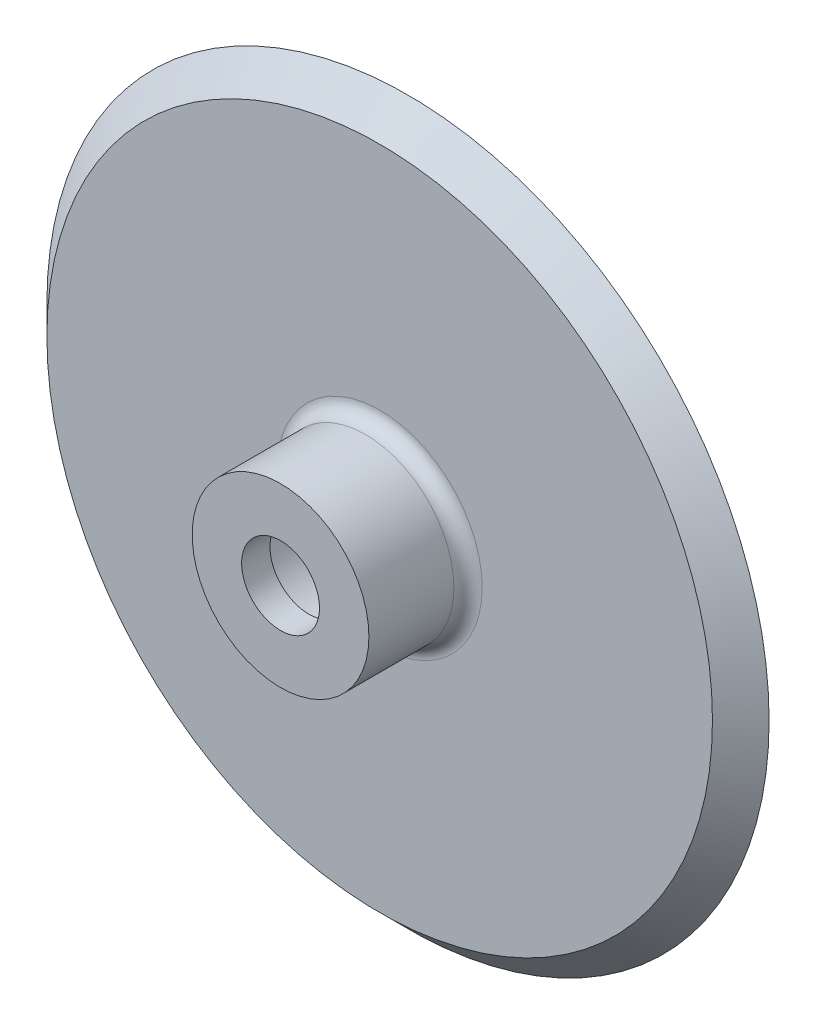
ISO-10303-21;
HEADER;
FILE_DESCRIPTION(('STEP AP214'),'2;1');
FILE_NAME('part.step','',(''),(''),'','','');
FILE_SCHEMA(('AUTOMOTIVE_DESIGN { 1 0 10303 214 1 1 1 1 }'));
ENDSEC;
DATA;
#1=APPLICATION_CONTEXT('core data for automotive mechanical design processes');
#2=APPLICATION_PROTOCOL_DEFINITION('international standard','automotive_design',2000,#1);
#3=PRODUCT_CONTEXT('',#1,'mechanical');
#4=PRODUCT('Part','Part','',(#3));
#5=PRODUCT_RELATED_PRODUCT_CATEGORY('part','',(#4));
#6=PRODUCT_DEFINITION_FORMATION('','',#4);
#7=PRODUCT_DEFINITION_CONTEXT('part definition',#1,'design');
#8=PRODUCT_DEFINITION('design','',#6,#7);
#9=PRODUCT_DEFINITION_SHAPE('','',#8);
#10=(LENGTH_UNIT() NAMED_UNIT(*) SI_UNIT(.MILLI.,.METRE.));
#11=(NAMED_UNIT(*) PLANE_ANGLE_UNIT() SI_UNIT($,.RADIAN.));
#12=(NAMED_UNIT(*) SI_UNIT($,.STERADIAN.) SOLID_ANGLE_UNIT());
#13=UNCERTAINTY_MEASURE_WITH_UNIT(LENGTH_MEASURE(1.E-05),#10,'distance_accuracy_value','');
#14=(GEOMETRIC_REPRESENTATION_CONTEXT(3) GLOBAL_UNCERTAINTY_ASSIGNED_CONTEXT((#13)) GLOBAL_UNIT_ASSIGNED_CONTEXT((#10,
#11,#12)) REPRESENTATION_CONTEXT('',''));
#15=CARTESIAN_POINT('',(0.,0.,0.));
#16=DIRECTION('',(0.,0.,1.));
#17=DIRECTION('',(1.,0.,0.));
#18=AXIS2_PLACEMENT_3D('',#15,#16,#17);
#19=CARTESIAN_POINT('',(-28.3658305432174,-486.980432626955,2.));
#20=DIRECTION('',(0.,0.,-1.));
#21=DIRECTION('',(-1.,0.,0.));
#22=AXIS2_PLACEMENT_3D('',#19,#20,#21);
#23=CYLINDRICAL_SURFACE('',#22,4.23900455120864);
#24=CARTESIAN_POINT('',(-28.3658305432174,-486.980432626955,6.));
#25=DIRECTION('',(0.,0.,1.));
#26=DIRECTION('',(1.,0.,0.));
#27=AXIS2_PLACEMENT_3D('',#24,#25,#26);
#28=CIRCLE('',#27,4.23900455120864);
#29=CARTESIAN_POINT('',(-24.1268259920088,-486.980432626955,6.));
#30=VERTEX_POINT('',#29);
#31=EDGE_CURVE('E333',#30,#30,#28,.T.);
#32=ORIENTED_EDGE('',*,*,#31,.T.);
#33=EDGE_LOOP('',(#32));
#34=FACE_BOUND('',#33,.T.);
#35=CARTESIAN_POINT('',(-28.3658305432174,-486.980432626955,0.));
#36=DIRECTION('',(0.,0.,1.));
#37=DIRECTION('',(1.,0.,0.));
#38=AXIS2_PLACEMENT_3D('',#35,#36,#37);
#39=CIRCLE('',#38,4.23900455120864);
#40=CARTESIAN_POINT('',(-24.1268259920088,-486.980432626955,0.));
#41=VERTEX_POINT('',#40);
#42=EDGE_CURVE('E1615',#41,#41,#39,.T.);
#43=ORIENTED_EDGE('',*,*,#42,.F.);
#44=EDGE_LOOP('',(#43));
#45=FACE_BOUND('',#44,.T.);
#46=ADVANCED_FACE('F325',(#34,#45),#23,.F.);
#47=CARTESIAN_POINT('',(-28.3658305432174,-486.980432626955,10.));
#48=DIRECTION('',(0.,0.,-1.));
#49=DIRECTION('',(-1.,0.,0.));
#50=AXIS2_PLACEMENT_3D('',#47,#48,#49);
#51=CYLINDRICAL_SURFACE('',#50,6.23900455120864);
#52=CARTESIAN_POINT('',(-28.3658305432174,-486.980432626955,3.));
#53=DIRECTION('',(0.,0.,1.));
#54=DIRECTION('',(1.,0.,0.));
#55=AXIS2_PLACEMENT_3D('',#52,#53,#54);
#56=CIRCLE('',#55,6.23900455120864);
#57=CARTESIAN_POINT('',(-22.1268259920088,-486.980432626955,3.));
#58=VERTEX_POINT('',#57);
#59=EDGE_CURVE('E1621',#58,#58,#56,.T.);
#60=ORIENTED_EDGE('',*,*,#59,.T.);
#61=EDGE_LOOP('',(#60));
#62=FACE_BOUND('',#61,.T.);
#63=CARTESIAN_POINT('',(-28.3658305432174,-486.980432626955,9.));
#64=DIRECTION('',(0.,0.,1.));
#65=DIRECTION('',(1.,0.,0.));
#66=AXIS2_PLACEMENT_3D('',#63,#64,#65);
#67=CIRCLE('',#66,6.23900455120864);
#68=CARTESIAN_POINT('',(-22.1268259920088,-486.980432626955,9.));
#69=VERTEX_POINT('',#68);
#70=EDGE_CURVE('E1139',#69,#69,#67,.T.);
#71=ORIENTED_EDGE('',*,*,#70,.F.);
#72=EDGE_LOOP('',(#71));
#73=FACE_BOUND('',#72,.T.);
#74=ADVANCED_FACE('F1643',(#62,#73),#51,.T.);
#75=CARTESIAN_POINT('',(0.,0.,0.));
#76=DIRECTION('',(0.,0.,1.));
#77=DIRECTION('',(1.,0.,0.));
#78=AXIS2_PLACEMENT_3D('',#75,#76,#77);
#79=PLANE('',#78);
#80=CARTESIAN_POINT('',(-28.3658305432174,-486.980432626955,0.));
#81=DIRECTION('',(0.,0.,-1.));
#82=DIRECTION('',(-1.,0.,0.));
#83=AXIS2_PLACEMENT_3D('',#80,#81,#82);
#84=CIRCLE('',#83,5.23900455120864);
#85=CARTESIAN_POINT('',(-28.7671110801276,-492.204046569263,0.));
#86=VERTEX_POINT('',#85);
#87=CARTESIAN_POINT('',(-33.2097801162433,-488.976258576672,0.));
#88=VERTEX_POINT('',#87);
#89=EDGE_CURVE('E1343',#86,#88,#84,.T.);
#90=ORIENTED_EDGE('',*,*,#89,.T.);
#91=DIRECTION('',(-0.924593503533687,-0.380955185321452,0.));
#92=VECTOR('',#91,1.);
#93=CARTESIAN_POINT('',(167.411835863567,-406.315235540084,0.));
#94=LINE('',#93,#92);
#95=CARTESIAN_POINT('',(-36.0104006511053,-490.130182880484,0.));
#96=VERTEX_POINT('',#95);
#97=EDGE_CURVE('E1321',#88,#96,#94,.T.);
#98=ORIENTED_EDGE('',*,*,#97,.T.);
#99=CARTESIAN_POINT('',(-30.3675271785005,-499.322561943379,0.));
#100=DIRECTION('',(0.,0.,-1.));
#101=DIRECTION('',(-1.,0.,0.));
#102=AXIS2_PLACEMENT_3D('',#99,#100,#101);
#103=CIRCLE('',#102,10.7861881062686);
#104=CARTESIAN_POINT('',(-40.8050998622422,-496.602464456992,0.));
#105=VERTEX_POINT('',#104);
#106=EDGE_CURVE('E1365',#105,#96,#103,.T.);
#107=ORIENTED_EDGE('',*,*,#106,.F.);
#108=DIRECTION('',(-0.002075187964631,0.999997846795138,0.));
#109=VECTOR('',#108,1.);
#110=CARTESIAN_POINT('',(-41.8354653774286,-0.0868166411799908,0.));
#111=LINE('',#110,#109);
#112=CARTESIAN_POINT('',(-40.7937205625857,-502.085955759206,0.));
#113=VERTEX_POINT('',#112);
#114=EDGE_CURVE('E1362',#113,#105,#111,.T.);
#115=ORIENTED_EDGE('',*,*,#114,.F.);
#116=DIRECTION('',(-0.951056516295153,-0.309016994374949,0.));
#117=VECTOR('',#116,1.);
#118=CARTESIAN_POINT('',(143.663906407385,-442.152039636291,0.));
#119=LINE('',#118,#117);
#120=CARTESIAN_POINT('',(-38.8916075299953,-501.467921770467,0.));
#121=VERTEX_POINT('',#120);
#122=EDGE_CURVE('E1359',#121,#113,#119,.T.);
#123=ORIENTED_EDGE('',*,*,#122,.F.);
#124=DIRECTION('',(0.,1.,0.));
#125=VECTOR('',#124,1.);
#126=CARTESIAN_POINT('',(-38.8916075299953,0.,0.));
#127=LINE('',#126,#125);
#128=CARTESIAN_POINT('',(-38.8916075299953,-503.467921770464,0.));
#129=VERTEX_POINT('',#128);
#130=EDGE_CURVE('E1356',#129,#121,#127,.T.);
#131=ORIENTED_EDGE('',*,*,#130,.F.);
#132=DIRECTION('',(0.951695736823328,0.307042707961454,0.));
#133=VECTOR('',#132,1.);
#134=CARTESIAN_POINT('',(143.452468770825,-444.638805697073,0.));
#135=LINE('',#134,#133);
#136=CARTESIAN_POINT('',(-33.672980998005,-501.784252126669,0.));
#137=VERTEX_POINT('',#136);
#138=EDGE_CURVE('E1353',#129,#137,#135,.T.);
#139=ORIENTED_EDGE('',*,*,#138,.T.);
#140=CARTESIAN_POINT('',(-39.4853347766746,-492.698086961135,0.));
#141=DIRECTION('',(0.,0.,-1.));
#142=DIRECTION('',(-1.,0.,0.));
#143=AXIS2_PLACEMENT_3D('',#140,#141,#142);
#144=CIRCLE('',#143,10.7861881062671);
#145=CARTESIAN_POINT('',(-28.9991189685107,-495.224177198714,0.));
#146=VERTEX_POINT('',#145);
#147=EDGE_CURVE('E1350',#137,#146,#144,.F.);
#148=ORIENTED_EDGE('',*,*,#147,.T.);
#149=DIRECTION('',(-0.076594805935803,-0.997062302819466,0.));
#150=VECTOR('',#149,1.);
#151=CARTESIAN_POINT('',(8.99118022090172,-0.690706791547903,0.));
#152=LINE('',#151,#150);
#153=EDGE_CURVE('E1346',#86,#146,#152,.T.);
#154=ORIENTED_EDGE('',*,*,#153,.F.);
#155=EDGE_LOOP('',(#90,#98,#107,#115,#123,#131,#139,#148,#154));
#156=FACE_BOUND('',#155,.T.);
#157=CARTESIAN_POINT('',(-28.3658305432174,-486.980432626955,0.));
#158=DIRECTION('',(0.,0.,-1.));
#159=DIRECTION('',(-1.,0.,0.));
#160=AXIS2_PLACEMENT_3D('',#157,#158,#159);
#161=CIRCLE('',#160,5.23900455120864);
#162=CARTESIAN_POINT('',(-31.1115510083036,-482.518573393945,0.));
#163=VERTEX_POINT('',#162);
#164=CARTESIAN_POINT('',(-25.620110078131,-482.518573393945,0.));
#165=VERTEX_POINT('',#164);
#166=EDGE_CURVE('E1230',#163,#165,#161,.T.);
#167=ORIENTED_EDGE('',*,*,#166,.T.);
#168=DIRECTION('',(0.524092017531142,0.851661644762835,0.));
#169=VECTOR('',#168,1.);
#170=CARTESIAN_POINT('',(196.788744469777,-121.09904297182,0.));
#171=LINE('',#170,#169);
#172=CARTESIAN_POINT('',(-24.0326201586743,-479.938865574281,0.));
#173=VERTEX_POINT('',#172);
#174=EDGE_CURVE('E1250',#165,#173,#171,.T.);
#175=ORIENTED_EDGE('',*,*,#174,.T.);
#176=CARTESIAN_POINT('',(-34.0009455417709,-475.818872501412,0.));
#177=DIRECTION('',(0.,0.,-1.));
#178=DIRECTION('',(-1.,0.,0.));
#179=AXIS2_PLACEMENT_3D('',#176,#177,#178);
#180=CIRCLE('',#179,10.786188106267);
#181=CARTESIAN_POINT('',(-23.9579386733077,-471.88442630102,0.));
#182=VERTEX_POINT('',#181);
#183=EDGE_CURVE('E1292',#182,#173,#180,.T.);
#184=ORIENTED_EDGE('',*,*,#183,.F.);
#185=DIRECTION('',(0.589462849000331,-0.807795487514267,0.));
#186=VECTOR('',#185,1.);
#187=CARTESIAN_POINT('',(-240.328409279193,-175.371948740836,0.));
#188=LINE('',#187,#186);
#189=CARTESIAN_POINT('',(-27.1902600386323,-467.454877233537,0.));
#190=VERTEX_POINT('',#189);
#191=EDGE_CURVE('E1289',#190,#182,#188,.T.);
#192=ORIENTED_EDGE('',*,*,#191,.F.);
#193=DIRECTION('',(0.587785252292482,0.809016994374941,0.));
#194=VECTOR('',#193,1.);
#195=CARTESIAN_POINT('',(204.491747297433,-148.571951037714,0.));
#196=LINE('',#195,#194);
#197=CARTESIAN_POINT('',(-28.3658305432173,-469.072911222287,0.));
#198=VERTEX_POINT('',#197);
#199=EDGE_CURVE('E1286',#198,#190,#196,.T.);
#200=ORIENTED_EDGE('',*,*,#199,.F.);
#201=DIRECTION('',(0.58778525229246,-0.809016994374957,0.));
#202=VECTOR('',#201,1.);
#203=CARTESIAN_POINT('',(-241.623101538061,-175.549459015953,0.));
#204=LINE('',#203,#202);
#205=CARTESIAN_POINT('',(-29.5414010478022,-467.454877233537,0.));
#206=VERTEX_POINT('',#205);
#207=EDGE_CURVE('E1283',#206,#198,#204,.T.);
#208=ORIENTED_EDGE('',*,*,#207,.F.);
#209=DIRECTION('',(-0.589462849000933,-0.807795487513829,0.));
#210=VECTOR('',#209,1.);
#211=CARTESIAN_POINT('',(203.309097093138,-148.358292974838,0.));
#212=LINE('',#211,#210);
#213=CARTESIAN_POINT('',(-32.7737224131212,-471.884426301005,0.));
#214=VERTEX_POINT('',#213);
#215=EDGE_CURVE('E1280',#206,#214,#212,.T.);
#216=ORIENTED_EDGE('',*,*,#215,.T.);
#217=CARTESIAN_POINT('',(-22.7307155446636,-475.818872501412,0.));
#218=DIRECTION('',(0.,0.,-1.));
#219=DIRECTION('',(-1.,0.,0.));
#220=AXIS2_PLACEMENT_3D('',#217,#218,#219);
#221=CIRCLE('',#220,10.7861881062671);
#222=CARTESIAN_POINT('',(-32.6990409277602,-479.938865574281,0.));
#223=VERTEX_POINT('',#222);
#224=EDGE_CURVE('E1277',#214,#223,#221,.F.);
#225=ORIENTED_EDGE('',*,*,#224,.T.);
#226=DIRECTION('',(-0.524092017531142,0.851661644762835,0.));
#227=VECTOR('',#226,1.);
#228=CARTESIAN_POINT('',(-237.937781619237,-146.421167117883,0.));
#229=LINE('',#228,#227);
#230=EDGE_CURVE('E1274',#163,#223,#229,.T.);
#231=ORIENTED_EDGE('',*,*,#230,.F.);
#232=EDGE_LOOP('',(#167,#175,#184,#192,#200,#208,#216,#225,#231));
#233=FACE_BOUND('',#232,.T.);
#234=ORIENTED_EDGE('',*,*,#42,.T.);
#235=EDGE_LOOP('',(#234));
#236=FACE_BOUND('',#235,.T.);
#237=CARTESIAN_POINT('',(-28.3658305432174,-486.980432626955,0.));
#238=DIRECTION('',(0.,0.,-1.));
#239=DIRECTION('',(-1.,0.,0.));
#240=AXIS2_PLACEMENT_3D('',#237,#238,#239);
#241=CIRCLE('',#240,5.23900455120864);
#242=CARTESIAN_POINT('',(-24.9708245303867,-482.990306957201,0.));
#243=VERTEX_POINT('',#242);
#244=CARTESIAN_POINT('',(-23.2738759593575,-488.212977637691,0.));
#245=VERTEX_POINT('',#244);
#246=EDGE_CURVE('E1537',#243,#245,#241,.T.);
#247=ORIENTED_EDGE('',*,*,#246,.T.);
#248=DIRECTION('',(0.97193169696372,-0.235263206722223,0.));
#249=VECTOR('',#248,1.);
#250=CARTESIAN_POINT('',(-112.922846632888,-466.51278575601,0.));
#251=LINE('',#250,#249);
#252=CARTESIAN_POINT('',(-20.3298666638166,-488.925596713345,0.));
#253=VERTEX_POINT('',#252);
#254=EDGE_CURVE('E1546',#245,#253,#251,.T.);
#255=ORIENTED_EDGE('',*,*,#254,.T.);
#256=CARTESIAN_POINT('',(-19.4919023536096,-478.172008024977,0.));
#257=DIRECTION('',(0.,0.,-1.));
#258=DIRECTION('',(-1.,0.,0.));
#259=AXIS2_PLACEMENT_3D('',#256,#257,#258);
#260=CIRCLE('',#259,10.7861881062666);
#261=CARTESIAN_POINT('',(-12.6465618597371,-486.507664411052,0.));
#262=VERTEX_POINT('',#261);
#263=EDGE_CURVE('E1588',#262,#253,#260,.T.);
#264=ORIENTED_EDGE('',*,*,#263,.F.);
#265=DIRECTION('',(-0.586105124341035,-0.81023501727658,0.));
#266=VECTOR('',#265,1.);
#267=CARTESIAN_POINT('',(222.731943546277,-161.11909592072,0.));
#268=LINE('',#267,#266);
#269=CARTESIAN_POINT('',(-9.43265258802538,-482.064738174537,0.));
#270=VERTEX_POINT('',#269);
#271=EDGE_CURVE('E1585',#270,#262,#268,.T.);
#272=ORIENTED_EDGE('',*,*,#271,.F.);
#273=DIRECTION('',(0.95105651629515,-0.309016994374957,0.));
#274=VECTOR('',#273,1.);
#275=CARTESIAN_POINT('',(-142.576010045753,-438.803838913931,0.));
#276=LINE('',#275,#274);
#277=CARTESIAN_POINT('',(-11.3347656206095,-481.446704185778,0.));
#278=VERTEX_POINT('',#277);
#279=EDGE_CURVE('E1582',#278,#270,#276,.T.);
#280=ORIENTED_EDGE('',*,*,#279,.F.);
#281=DIRECTION('',(-0.587785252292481,-0.809016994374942,0.));
#282=VECTOR('',#281,1.);
#283=CARTESIAN_POINT('',(221.522812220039,-160.945744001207,0.));
#284=LINE('',#283,#282);
#285=CARTESIAN_POINT('',(-10.1591951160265,-479.828670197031,0.));
#286=VERTEX_POINT('',#285);
#287=EDGE_CURVE('E1579',#286,#278,#284,.T.);
#288=ORIENTED_EDGE('',*,*,#287,.F.);
#289=DIRECTION('',(-0.950413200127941,0.31098995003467,0.));
#290=VECTOR('',#289,1.);
#291=CARTESIAN_POINT('',(-142.805001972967,-436.424903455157,0.));
#292=LINE('',#291,#290);
#293=CARTESIAN_POINT('',(-15.3707888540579,-478.123355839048,0.));
#294=VERTEX_POINT('',#293);
#295=EDGE_CURVE('E1576',#286,#294,#292,.T.);
#296=ORIENTED_EDGE('',*,*,#295,.T.);
#297=CARTESIAN_POINT('',(-16.0092097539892,-488.890633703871,0.));
#298=DIRECTION('',(0.,0.,-1.));
#299=DIRECTION('',(-1.,0.,0.));
#300=AXIS2_PLACEMENT_3D('',#297,#298,#299);
#301=CIRCLE('',#300,10.7861881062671);
#302=CARTESIAN_POINT('',(-23.0079379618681,-480.68334076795,0.));
#303=VERTEX_POINT('',#302);
#304=EDGE_CURVE('E1573',#294,#303,#301,.F.);
#305=ORIENTED_EDGE('',*,*,#304,.T.);
#306=DIRECTION('',(0.64802501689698,0.761619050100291,0.));
#307=VECTOR('',#306,1.);
#308=CARTESIAN_POINT('',(223.894329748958,-190.500916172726,0.));
#309=LINE('',#308,#307);
#310=EDGE_CURVE('E1570',#243,#303,#309,.T.);
#311=ORIENTED_EDGE('',*,*,#310,.F.);
#312=EDGE_LOOP('',(#247,#255,#264,#272,#280,#288,#296,#305,#311));
#313=FACE_BOUND('',#312,.T.);
#314=CARTESIAN_POINT('',(-28.3658305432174,-486.980432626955,0.));
#315=DIRECTION('',(0.,0.,-1.));
#316=DIRECTION('',(-1.,0.,0.));
#317=AXIS2_PLACEMENT_3D('',#314,#315,#316);
#318=CIRCLE('',#317,5.23900455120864);
#319=CARTESIAN_POINT('',(-23.5218809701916,-488.976258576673,0.));
#320=VERTEX_POINT('',#319);
#321=CARTESIAN_POINT('',(-27.9645500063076,-492.204046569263,0.));
#322=VERTEX_POINT('',#321);
#323=EDGE_CURVE('E1373',#320,#322,#318,.T.);
#324=ORIENTED_EDGE('',*,*,#323,.T.);
#325=DIRECTION('',(0.0765948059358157,-0.997062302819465,0.));
#326=VECTOR('',#325,1.);
#327=CARTESIAN_POINT('',(-65.3900100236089,-5.02329203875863,0.));
#328=LINE('',#327,#326);
#329=CARTESIAN_POINT('',(-27.7325421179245,-495.224177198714,0.));
#330=VERTEX_POINT('',#329);
#331=EDGE_CURVE('E1463',#322,#330,#328,.T.);
#332=ORIENTED_EDGE('',*,*,#331,.T.);
#333=CARTESIAN_POINT('',(-17.2463263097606,-492.698086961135,0.));
#334=DIRECTION('',(0.,0.,-1.));
#335=DIRECTION('',(-1.,0.,0.));
#336=AXIS2_PLACEMENT_3D('',#333,#334,#335);
#337=CIRCLE('',#336,10.7861881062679);
#338=CARTESIAN_POINT('',(-23.058680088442,-501.784252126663,0.));
#339=VERTEX_POINT('',#338);
#340=EDGE_CURVE('E1505',#339,#330,#337,.T.);
#341=ORIENTED_EDGE('',*,*,#340,.F.);
#342=DIRECTION('',(-0.951695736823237,0.307042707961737,0.));
#343=VECTOR('',#342,1.);
#344=CARTESIAN_POINT('',(-148.800858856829,-461.216434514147,0.));
#345=LINE('',#344,#343);
#346=CARTESIAN_POINT('',(-17.8400535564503,-503.467921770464,0.));
#347=VERTEX_POINT('',#346);
#348=EDGE_CURVE('E1502',#347,#339,#345,.T.);
#349=ORIENTED_EDGE('',*,*,#348,.F.);
#350=DIRECTION('',(0.,-1.,0.));
#351=VECTOR('',#350,1.);
#352=CARTESIAN_POINT('',(-17.8400535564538,-4.95160955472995E-13,0.));
#353=LINE('',#352,#351);
#354=CARTESIAN_POINT('',(-17.8400535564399,-501.467921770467,0.));
#355=VERTEX_POINT('',#354);
#356=EDGE_CURVE('E1499',#355,#347,#353,.T.);
#357=ORIENTED_EDGE('',*,*,#356,.F.);
#358=DIRECTION('',(-0.951056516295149,0.309016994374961,0.));
#359=VECTOR('',#358,1.);
#360=CARTESIAN_POINT('',(-149.081297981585,-458.825056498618,0.));
#361=LINE('',#360,#359);
#362=CARTESIAN_POINT('',(-15.9379405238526,-502.085955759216,0.));
#363=VERTEX_POINT('',#362);
#364=EDGE_CURVE('E1496',#363,#355,#361,.T.);
#365=ORIENTED_EDGE('',*,*,#364,.F.);
#366=DIRECTION('',(0.00207518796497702,0.999997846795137,0.));
#367=VECTOR('',#366,1.);
#368=CARTESIAN_POINT('',(-14.8959513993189,0.030911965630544,0.));
#369=LINE('',#368,#367);
#370=CARTESIAN_POINT('',(-15.9265612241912,-496.60246445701,0.));
#371=VERTEX_POINT('',#370);
#372=EDGE_CURVE('E1493',#363,#371,#369,.T.);
#373=ORIENTED_EDGE('',*,*,#372,.T.);
#374=CARTESIAN_POINT('',(-26.3641339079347,-499.322561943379,0.));
#375=DIRECTION('',(0.,0.,-1.));
#376=DIRECTION('',(-1.,0.,0.));
#377=AXIS2_PLACEMENT_3D('',#374,#375,#376);
#378=CIRCLE('',#377,10.7861881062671);
#379=CARTESIAN_POINT('',(-20.7212604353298,-490.130182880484,0.));
#380=VERTEX_POINT('',#379);
#381=EDGE_CURVE('E1490',#371,#380,#378,.F.);
#382=ORIENTED_EDGE('',*,*,#381,.T.);
#383=DIRECTION('',(0.924593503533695,-0.380955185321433,0.));
#384=VECTOR('',#383,1.);
#385=CARTESIAN_POINT('',(-175.645123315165,-426.297754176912,0.));
#386=LINE('',#385,#384);
#387=EDGE_CURVE('E1487',#320,#380,#386,.T.);
#388=ORIENTED_EDGE('',*,*,#387,.F.);
#389=EDGE_LOOP('',(#324,#332,#341,#349,#357,#365,#373,#382,#388));
#390=FACE_BOUND('',#389,.T.);
#391=CARTESIAN_POINT('',(-28.3658305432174,-486.980432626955,0.));
#392=DIRECTION('',(0.,0.,-1.));
#393=DIRECTION('',(-1.,0.,0.));
#394=AXIS2_PLACEMENT_3D('',#391,#392,#393);
#395=CIRCLE('',#394,22.);
#396=CARTESIAN_POINT('',(-50.3658305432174,-486.980432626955,0.));
#397=VERTEX_POINT('',#396);
#398=EDGE_CURVE('E1513',#397,#397,#395,.T.);
#399=ORIENTED_EDGE('',*,*,#398,.T.);
#400=EDGE_LOOP('',(#399));
#401=FACE_BOUND('',#400,.T.);
#402=CARTESIAN_POINT('',(-28.3658305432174,-486.980432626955,0.));
#403=DIRECTION('',(0.,0.,-1.));
#404=DIRECTION('',(-1.,0.,0.));
#405=AXIS2_PLACEMENT_3D('',#402,#403,#404);
#406=CIRCLE('',#405,5.23900455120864);
#407=CARTESIAN_POINT('',(-33.4577851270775,-488.212977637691,0.));
#408=VERTEX_POINT('',#407);
#409=CARTESIAN_POINT('',(-31.7608365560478,-482.990306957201,0.));
#410=VERTEX_POINT('',#409);
#411=EDGE_CURVE('E1300',#408,#410,#406,.T.);
#412=ORIENTED_EDGE('',*,*,#411,.T.);
#413=DIRECTION('',(-0.648025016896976,0.761619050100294,0.));
#414=VECTOR('',#413,1.);
#415=CARTESIAN_POINT('',(-256.802300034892,-218.500725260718,0.));
#416=LINE('',#415,#414);
#417=CARTESIAN_POINT('',(-33.7237231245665,-480.68334076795,0.));
#418=VERTEX_POINT('',#417);
#419=EDGE_CURVE('E1394',#410,#418,#416,.T.);
#420=ORIENTED_EDGE('',*,*,#419,.T.);
#421=CARTESIAN_POINT('',(-40.7224513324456,-488.890633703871,0.));
#422=DIRECTION('',(0.,0.,-1.));
#423=DIRECTION('',(-1.,0.,0.));
#424=AXIS2_PLACEMENT_3D('',#421,#422,#423);
#425=CIRCLE('',#424,10.7861881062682);
#426=CARTESIAN_POINT('',(-41.3608722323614,-478.123355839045,0.));
#427=VERTEX_POINT('',#426);
#428=EDGE_CURVE('E1436',#427,#418,#425,.T.);
#429=ORIENTED_EDGE('',*,*,#428,.F.);
#430=DIRECTION('',(0.950413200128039,0.310989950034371,0.));
#431=VECTOR('',#430,1.);
#432=CARTESIAN_POINT('',(137.318213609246,-419.656785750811,0.));
#433=LINE('',#432,#431);
#434=CARTESIAN_POINT('',(-46.5724659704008,-479.828670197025,0.));
#435=VERTEX_POINT('',#434);
#436=EDGE_CURVE('E1433',#435,#427,#433,.T.);
#437=ORIENTED_EDGE('',*,*,#436,.F.);
#438=DIRECTION('',(-0.587785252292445,0.809016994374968,0.));
#439=VECTOR('',#438,1.);
#440=CARTESIAN_POINT('',(-258.654166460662,-187.923251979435,0.));
#441=LINE('',#440,#439);
#442=CARTESIAN_POINT('',(-45.3968954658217,-481.446704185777,0.));
#443=VERTEX_POINT('',#442);
#444=EDGE_CURVE('E1430',#443,#435,#441,.T.);
#445=ORIENTED_EDGE('',*,*,#444,.F.);
#446=DIRECTION('',(0.951056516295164,0.309016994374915,0.));
#447=VECTOR('',#446,1.);
#448=CARTESIAN_POINT('',(137.158618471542,-422.130822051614,0.));
#449=LINE('',#448,#447);
#450=CARTESIAN_POINT('',(-47.2990084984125,-482.064738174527,0.));
#451=VERTEX_POINT('',#450);
#452=EDGE_CURVE('E1427',#451,#443,#449,.T.);
#453=ORIENTED_EDGE('',*,*,#452,.F.);
#454=DIRECTION('',(0.586105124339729,-0.810235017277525,0.));
#455=VECTOR('',#454,1.);
#456=CARTESIAN_POINT('',(-259.975188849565,-188.059991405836,0.));
#457=LINE('',#456,#455);
#458=CARTESIAN_POINT('',(-44.0850992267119,-486.507664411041,0.));
#459=VERTEX_POINT('',#458);
#460=EDGE_CURVE('E1424',#451,#459,#457,.T.);
#461=ORIENTED_EDGE('',*,*,#460,.T.);
#462=CARTESIAN_POINT('',(-37.239758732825,-478.172008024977,0.));
#463=DIRECTION('',(0.,0.,-1.));
#464=DIRECTION('',(-1.,0.,0.));
#465=AXIS2_PLACEMENT_3D('',#462,#463,#464);
#466=CIRCLE('',#465,10.7861881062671);
#467=CARTESIAN_POINT('',(-36.4017944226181,-488.925596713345,0.));
#468=VERTEX_POINT('',#467);
#469=EDGE_CURVE('E1421',#459,#468,#466,.F.);
#470=ORIENTED_EDGE('',*,*,#469,.T.);
#471=DIRECTION('',(-0.97193169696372,-0.235263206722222,0.));
#472=VECTOR('',#471,1.);
#473=CARTESIAN_POINT('',(109.782818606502,-453.54053730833,0.));
#474=LINE('',#473,#472);
#475=EDGE_CURVE('E1418',#408,#468,#474,.T.);
#476=ORIENTED_EDGE('',*,*,#475,.F.);
#477=EDGE_LOOP('',(#412,#420,#429,#437,#445,#453,#461,#470,#476));
#478=FACE_BOUND('',#477,.T.);
#479=ADVANCED_FACE('F1648',(#156,#233,#236,#313,#390,#401,#478),#79,.F.);
#480=CARTESIAN_POINT('',(-28.3658305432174,-486.980432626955,0.));
#481=DIRECTION('',(0.,0.,-1.));
#482=DIRECTION('',(-1.,0.,0.));
#483=AXIS2_PLACEMENT_3D('',#480,#481,#482);
#484=CIRCLE('',#483,23.);
#485=CARTESIAN_POINT('',(-51.3658305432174,-486.980432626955,0.));
#486=VERTEX_POINT('',#485);
#487=EDGE_CURVE('E1534',#486,#486,#484,.T.);
#488=ORIENTED_EDGE('',*,*,#487,.F.);
#489=EDGE_LOOP('',(#488));
#490=FACE_BOUND('',#489,.T.);
#491=CARTESIAN_POINT('',(-28.3658305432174,-486.980432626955,0.));
#492=DIRECTION('',(0.,0.,-1.));
#493=DIRECTION('',(-1.,0.,0.));
#494=AXIS2_PLACEMENT_3D('',#491,#492,#493);
#495=CIRCLE('',#494,25.5);
#496=CARTESIAN_POINT('',(-53.8658305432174,-486.980432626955,0.));
#497=VERTEX_POINT('',#496);
#498=EDGE_CURVE('E1596',#497,#497,#495,.T.);
#499=ORIENTED_EDGE('',*,*,#498,.T.);
#500=EDGE_LOOP('',(#499));
#501=FACE_BOUND('',#500,.T.);
#502=ADVANCED_FACE('F1677',(#490,#501),#79,.F.);
#503=CARTESIAN_POINT('',(0.,0.,2.));
#504=DIRECTION('',(0.,0.,1.));
#505=DIRECTION('',(1.,0.,0.));
#506=AXIS2_PLACEMENT_3D('',#503,#504,#505);
#507=PLANE('',#506);
#508=CARTESIAN_POINT('',(-28.3658305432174,-486.980432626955,2.));
#509=DIRECTION('',(0.,0.,1.));
#510=DIRECTION('',(1.,0.,0.));
#511=AXIS2_PLACEMENT_3D('',#508,#509,#510);
#512=CIRCLE('',#511,23.5);
#513=CARTESIAN_POINT('',(-4.86583054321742,-486.980432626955,2.));
#514=VERTEX_POINT('',#513);
#515=EDGE_CURVE('E1624',#514,#514,#512,.T.);
#516=ORIENTED_EDGE('',*,*,#515,.T.);
#517=EDGE_LOOP('',(#516));
#518=FACE_BOUND('',#517,.T.);
#519=CARTESIAN_POINT('',(-28.3658305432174,-486.980432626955,2.));
#520=DIRECTION('',(0.,0.,1.));
#521=DIRECTION('',(1.,0.,0.));
#522=AXIS2_PLACEMENT_3D('',#519,#520,#521);
#523=CIRCLE('',#522,7.23900455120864);
#524=CARTESIAN_POINT('',(-21.1268259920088,-486.980432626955,2.));
#525=VERTEX_POINT('',#524);
#526=EDGE_CURVE('E1618',#525,#525,#523,.F.);
#527=ORIENTED_EDGE('',*,*,#526,.T.);
#528=EDGE_LOOP('',(#527));
#529=FACE_BOUND('',#528,.T.);
#530=ADVANCED_FACE('F1657',(#518,#529),#507,.T.);
#531=CARTESIAN_POINT('',(-28.3658305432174,-486.980432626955,3.));
#532=DIRECTION('',(0.,0.,1.));
#533=DIRECTION('',(1.,0.,0.));
#534=AXIS2_PLACEMENT_3D('',#531,#532,#533);
#535=TOROIDAL_SURFACE('',#534,7.23900455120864,1.);
#536=ORIENTED_EDGE('',*,*,#59,.F.);
#537=EDGE_LOOP('',(#536));
#538=FACE_BOUND('',#537,.T.);
#539=ORIENTED_EDGE('',*,*,#526,.F.);
#540=EDGE_LOOP('',(#539));
#541=FACE_BOUND('',#540,.T.);
#542=ADVANCED_FACE('F1654',(#538,#541),#535,.F.);
#543=CARTESIAN_POINT('',(-28.3658305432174,-486.980432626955,0.));
#544=DIRECTION('',(0.,0.,-1.));
#545=DIRECTION('',(-1.,0.,0.));
#546=AXIS2_PLACEMENT_3D('',#543,#544,#545);
#547=CONICAL_SURFACE('',#546,25.5,0.785398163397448);
#548=ORIENTED_EDGE('',*,*,#515,.F.);
#549=EDGE_LOOP('',(#548));
#550=FACE_BOUND('',#549,.T.);
#551=ORIENTED_EDGE('',*,*,#498,.F.);
#552=EDGE_LOOP('',(#551));
#553=FACE_BOUND('',#552,.T.);
#554=ADVANCED_FACE('F1656',(#550,#553),#547,.T.);
#555=CARTESIAN_POINT('',(-28.3658305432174,-486.980432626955,1.));
#556=DIRECTION('',(0.,0.,-1.));
#557=DIRECTION('',(-1.,0.,0.));
#558=AXIS2_PLACEMENT_3D('',#555,#556,#557);
#559=CYLINDRICAL_SURFACE('',#558,5.23900455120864);
#560=ORIENTED_EDGE('',*,*,#246,.F.);
#561=DIRECTION('',(0.,0.,-1.));
#562=VECTOR('',#561,1.);
#563=CARTESIAN_POINT('',(-24.9708245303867,-482.990306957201,1.));
#564=LINE('',#563,#562);
#565=CARTESIAN_POINT('',(-24.9708245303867,-482.990306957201,1.));
#566=VERTEX_POINT('',#565);
#567=EDGE_CURVE('E1567',#566,#243,#564,.T.);
#568=ORIENTED_EDGE('',*,*,#567,.F.);
#569=CARTESIAN_POINT('',(-28.3658305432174,-486.980432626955,1.));
#570=DIRECTION('',(0.,0.,-1.));
#571=DIRECTION('',(-1.,0.,0.));
#572=AXIS2_PLACEMENT_3D('',#569,#570,#571);
#573=CIRCLE('',#572,5.23900455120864);
#574=CARTESIAN_POINT('',(-23.2738759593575,-488.212977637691,1.));
#575=VERTEX_POINT('',#574);
#576=EDGE_CURVE('E1542',#566,#575,#573,.T.);
#577=ORIENTED_EDGE('',*,*,#576,.T.);
#578=DIRECTION('',(0.,0.,-1.));
#579=VECTOR('',#578,1.);
#580=CARTESIAN_POINT('',(-23.2738759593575,-488.212977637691,1.));
#581=LINE('',#580,#579);
#582=EDGE_CURVE('E1593',#575,#245,#581,.T.);
#583=ORIENTED_EDGE('',*,*,#582,.T.);
#584=EDGE_LOOP('',(#560,#568,#577,#583));
#585=FACE_BOUND('',#584,.T.);
#586=ADVANCED_FACE('F1663',(#585),#559,.T.);
#587=CARTESIAN_POINT('',(-112.922846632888,-466.51278575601,1.));
#588=DIRECTION('',(0.235263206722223,0.97193169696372,0.));
#589=DIRECTION('',(-0.97193169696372,0.235263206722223,0.));
#590=AXIS2_PLACEMENT_3D('',#587,#588,#589);
#591=PLANE('',#590);
#592=ORIENTED_EDGE('',*,*,#254,.F.);
#593=ORIENTED_EDGE('',*,*,#582,.F.);
#594=DIRECTION('',(0.97193169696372,-0.235263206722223,0.));
#595=VECTOR('',#594,1.);
#596=CARTESIAN_POINT('',(-112.922846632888,-466.51278575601,1.));
#597=LINE('',#596,#595);
#598=CARTESIAN_POINT('',(-20.3298666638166,-488.925596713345,1.));
#599=VERTEX_POINT('',#598);
#600=EDGE_CURVE('E1565',#575,#599,#597,.T.);
#601=ORIENTED_EDGE('',*,*,#600,.T.);
#602=DIRECTION('',(0.,0.,-1.));
#603=VECTOR('',#602,1.);
#604=CARTESIAN_POINT('',(-20.3298666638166,-488.925596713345,1.));
#605=LINE('',#604,#603);
#606=EDGE_CURVE('E1597',#599,#253,#605,.T.);
#607=ORIENTED_EDGE('',*,*,#606,.T.);
#608=EDGE_LOOP('',(#592,#593,#601,#607));
#609=FACE_BOUND('',#608,.T.);
#610=ADVANCED_FACE('F1670',(#609),#591,.T.);
#611=CARTESIAN_POINT('',(-19.4919023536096,-478.172008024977,1.));
#612=DIRECTION('',(0.,0.,-1.));
#613=DIRECTION('',(-1.,0.,0.));
#614=AXIS2_PLACEMENT_3D('',#611,#612,#613);
#615=CYLINDRICAL_SURFACE('',#614,10.7861881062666);
#616=ORIENTED_EDGE('',*,*,#263,.T.);
#617=ORIENTED_EDGE('',*,*,#606,.F.);
#618=CARTESIAN_POINT('',(-19.4919023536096,-478.172008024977,1.));
#619=DIRECTION('',(0.,0.,-1.));
#620=DIRECTION('',(-1.,0.,0.));
#621=AXIS2_PLACEMENT_3D('',#618,#619,#620);
#622=CIRCLE('',#621,10.7861881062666);
#623=CARTESIAN_POINT('',(-12.6465618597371,-486.507664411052,1.));
#624=VERTEX_POINT('',#623);
#625=EDGE_CURVE('E1562',#624,#599,#622,.T.);
#626=ORIENTED_EDGE('',*,*,#625,.F.);
#627=DIRECTION('',(0.,0.,-1.));
#628=VECTOR('',#627,1.);
#629=CARTESIAN_POINT('',(-12.6465618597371,-486.507664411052,1.));
#630=LINE('',#629,#628);
#631=EDGE_CURVE('E1599',#624,#262,#630,.T.);
#632=ORIENTED_EDGE('',*,*,#631,.T.);
#633=EDGE_LOOP('',(#616,#617,#626,#632));
#634=FACE_BOUND('',#633,.T.);
#635=ADVANCED_FACE('F1712',(#634),#615,.F.);
#636=CARTESIAN_POINT('',(222.731943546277,-161.11909592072,1.));
#637=DIRECTION('',(0.81023501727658,-0.586105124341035,0.));
#638=DIRECTION('',(0.586105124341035,0.81023501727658,0.));
#639=AXIS2_PLACEMENT_3D('',#636,#637,#638);
#640=PLANE('',#639);
#641=ORIENTED_EDGE('',*,*,#271,.T.);
#642=ORIENTED_EDGE('',*,*,#631,.F.);
#643=DIRECTION('',(-0.586105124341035,-0.81023501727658,0.));
#644=VECTOR('',#643,1.);
#645=CARTESIAN_POINT('',(222.731943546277,-161.11909592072,1.));
#646=LINE('',#645,#644);
#647=CARTESIAN_POINT('',(-9.43265258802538,-482.064738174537,1.));
#648=VERTEX_POINT('',#647);
#649=EDGE_CURVE('E1559',#648,#624,#646,.T.);
#650=ORIENTED_EDGE('',*,*,#649,.F.);
#651=DIRECTION('',(0.,0.,-1.));
#652=VECTOR('',#651,1.);
#653=CARTESIAN_POINT('',(-9.43265258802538,-482.064738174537,1.));
#654=LINE('',#653,#652);
#655=EDGE_CURVE('E1601',#648,#270,#654,.T.);
#656=ORIENTED_EDGE('',*,*,#655,.T.);
#657=EDGE_LOOP('',(#641,#642,#650,#656));
#658=FACE_BOUND('',#657,.T.);
#659=ADVANCED_FACE('F1716',(#658),#640,.F.);
#660=CARTESIAN_POINT('',(-142.576010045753,-438.803838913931,1.));
#661=DIRECTION('',(0.309016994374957,0.95105651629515,0.));
#662=DIRECTION('',(-0.95105651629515,0.309016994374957,0.));
#663=AXIS2_PLACEMENT_3D('',#660,#661,#662);
#664=PLANE('',#663);
#665=ORIENTED_EDGE('',*,*,#279,.T.);
#666=ORIENTED_EDGE('',*,*,#655,.F.);
#667=DIRECTION('',(0.95105651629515,-0.309016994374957,0.));
#668=VECTOR('',#667,1.);
#669=CARTESIAN_POINT('',(-142.576010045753,-438.803838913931,1.));
#670=LINE('',#669,#668);
#671=CARTESIAN_POINT('',(-11.3347656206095,-481.446704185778,1.));
#672=VERTEX_POINT('',#671);
#673=EDGE_CURVE('E1556',#672,#648,#670,.T.);
#674=ORIENTED_EDGE('',*,*,#673,.F.);
#675=DIRECTION('',(0.,0.,-1.));
#676=VECTOR('',#675,1.);
#677=CARTESIAN_POINT('',(-11.3347656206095,-481.446704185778,1.));
#678=LINE('',#677,#676);
#679=EDGE_CURVE('E1603',#672,#278,#678,.T.);
#680=ORIENTED_EDGE('',*,*,#679,.T.);
#681=EDGE_LOOP('',(#665,#666,#674,#680));
#682=FACE_BOUND('',#681,.T.);
#683=ADVANCED_FACE('F1720',(#682),#664,.F.);
#684=CARTESIAN_POINT('',(221.522812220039,-160.945744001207,1.));
#685=DIRECTION('',(0.809016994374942,-0.587785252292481,0.));
#686=DIRECTION('',(0.587785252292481,0.809016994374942,0.));
#687=AXIS2_PLACEMENT_3D('',#684,#685,#686);
#688=PLANE('',#687);
#689=ORIENTED_EDGE('',*,*,#287,.T.);
#690=ORIENTED_EDGE('',*,*,#679,.F.);
#691=DIRECTION('',(-0.587785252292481,-0.809016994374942,0.));
#692=VECTOR('',#691,1.);
#693=CARTESIAN_POINT('',(221.522812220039,-160.945744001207,1.));
#694=LINE('',#693,#692);
#695=CARTESIAN_POINT('',(-10.1591951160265,-479.828670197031,1.));
#696=VERTEX_POINT('',#695);
#697=EDGE_CURVE('E1553',#696,#672,#694,.T.);
#698=ORIENTED_EDGE('',*,*,#697,.F.);
#699=DIRECTION('',(0.,0.,-1.));
#700=VECTOR('',#699,1.);
#701=CARTESIAN_POINT('',(-10.1591951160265,-479.828670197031,1.));
#702=LINE('',#701,#700);
#703=EDGE_CURVE('E1605',#696,#286,#702,.T.);
#704=ORIENTED_EDGE('',*,*,#703,.T.);
#705=EDGE_LOOP('',(#689,#690,#698,#704));
#706=FACE_BOUND('',#705,.T.);
#707=ADVANCED_FACE('F1724',(#706),#688,.F.);
#708=CARTESIAN_POINT('',(-142.805001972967,-436.424903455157,1.));
#709=DIRECTION('',(-0.31098995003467,-0.950413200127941,0.));
#710=DIRECTION('',(0.950413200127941,-0.31098995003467,0.));
#711=AXIS2_PLACEMENT_3D('',#708,#709,#710);
#712=PLANE('',#711);
#713=ORIENTED_EDGE('',*,*,#295,.F.);
#714=ORIENTED_EDGE('',*,*,#703,.F.);
#715=DIRECTION('',(-0.950413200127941,0.31098995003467,0.));
#716=VECTOR('',#715,1.);
#717=CARTESIAN_POINT('',(-142.805001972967,-436.424903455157,1.));
#718=LINE('',#717,#716);
#719=CARTESIAN_POINT('',(-15.3707888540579,-478.123355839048,1.));
#720=VERTEX_POINT('',#719);
#721=EDGE_CURVE('E1551',#696,#720,#718,.T.);
#722=ORIENTED_EDGE('',*,*,#721,.T.);
#723=DIRECTION('',(0.,0.,-1.));
#724=VECTOR('',#723,1.);
#725=CARTESIAN_POINT('',(-15.3707888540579,-478.123355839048,1.));
#726=LINE('',#725,#724);
#727=EDGE_CURVE('E1607',#720,#294,#726,.T.);
#728=ORIENTED_EDGE('',*,*,#727,.T.);
#729=EDGE_LOOP('',(#713,#714,#722,#728));
#730=FACE_BOUND('',#729,.T.);
#731=ADVANCED_FACE('F1728',(#730),#712,.T.);
#732=CARTESIAN_POINT('',(-16.0092097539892,-488.890633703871,1.));
#733=DIRECTION('',(0.,0.,-1.));
#734=DIRECTION('',(-1.,0.,0.));
#735=AXIS2_PLACEMENT_3D('',#732,#733,#734);
#736=CYLINDRICAL_SURFACE('',#735,10.7861881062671);
#737=ORIENTED_EDGE('',*,*,#304,.F.);
#738=ORIENTED_EDGE('',*,*,#727,.F.);
#739=CARTESIAN_POINT('',(-16.0092097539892,-488.890633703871,1.));
#740=DIRECTION('',(0.,0.,-1.));
#741=DIRECTION('',(-1.,0.,0.));
#742=AXIS2_PLACEMENT_3D('',#739,#740,#741);
#743=CIRCLE('',#742,10.7861881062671);
#744=CARTESIAN_POINT('',(-23.0079379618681,-480.68334076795,1.));
#745=VERTEX_POINT('',#744);
#746=EDGE_CURVE('E1549',#720,#745,#743,.F.);
#747=ORIENTED_EDGE('',*,*,#746,.T.);
#748=DIRECTION('',(0.,0.,-1.));
#749=VECTOR('',#748,1.);
#750=CARTESIAN_POINT('',(-23.0079379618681,-480.68334076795,1.));
#751=LINE('',#750,#749);
#752=EDGE_CURVE('E1609',#745,#303,#751,.T.);
#753=ORIENTED_EDGE('',*,*,#752,.T.);
#754=EDGE_LOOP('',(#737,#738,#747,#753));
#755=FACE_BOUND('',#754,.T.);
#756=ADVANCED_FACE('F1732',(#755),#736,.F.);
#757=CARTESIAN_POINT('',(223.894329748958,-190.500916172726,1.));
#758=DIRECTION('',(-0.761619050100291,0.64802501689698,0.));
#759=DIRECTION('',(-0.64802501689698,-0.761619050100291,0.));
#760=AXIS2_PLACEMENT_3D('',#757,#758,#759);
#761=PLANE('',#760);
#762=ORIENTED_EDGE('',*,*,#310,.T.);
#763=ORIENTED_EDGE('',*,*,#752,.F.);
#764=DIRECTION('',(0.64802501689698,0.761619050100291,0.));
#765=VECTOR('',#764,1.);
#766=CARTESIAN_POINT('',(223.894329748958,-190.500916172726,1.));
#767=LINE('',#766,#765);
#768=EDGE_CURVE('E1545',#566,#745,#767,.T.);
#769=ORIENTED_EDGE('',*,*,#768,.F.);
#770=ORIENTED_EDGE('',*,*,#567,.T.);
#771=EDGE_LOOP('',(#762,#763,#769,#770));
#772=FACE_BOUND('',#771,.T.);
#773=ADVANCED_FACE('F1709',(#772),#761,.F.);
#774=CARTESIAN_POINT('',(0.,0.,1.));
#775=DIRECTION('',(0.,0.,-1.));
#776=DIRECTION('',(-1.,0.,0.));
#777=AXIS2_PLACEMENT_3D('',#774,#775,#776);
#778=PLANE('',#777);
#779=DIRECTION('',(0.648025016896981,0.76161905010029,0.));
#780=VECTOR('',#779,1.);
#781=CARTESIAN_POINT('',(224.655948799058,-191.148941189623,1.));
#782=LINE('',#781,#780);
#783=CARTESIAN_POINT('',(-23.6134517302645,-482.938146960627,1.));
#784=VERTEX_POINT('',#783);
#785=CARTESIAN_POINT('',(-22.2994509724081,-481.393811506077,1.));
#786=VERTEX_POINT('',#785);
#787=EDGE_CURVE('E340',#784,#786,#782,.T.);
#788=ORIENTED_EDGE('',*,*,#787,.F.);
#789=CARTESIAN_POINT('',(-28.3658305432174,-486.980432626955,1.));
#790=DIRECTION('',(0.,0.,-1.));
#791=DIRECTION('',(-1.,0.,0.));
#792=AXIS2_PLACEMENT_3D('',#789,#790,#791);
#793=CIRCLE('',#792,6.23900455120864);
#794=CARTESIAN_POINT('',(-22.1450794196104,-487.457332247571,1.));
#795=VERTEX_POINT('',#794);
#796=EDGE_CURVE('E345',#784,#795,#793,.T.);
#797=ORIENTED_EDGE('',*,*,#796,.T.);
#798=DIRECTION('',(-0.97193169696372,0.235263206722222,0.));
#799=VECTOR('',#798,1.);
#800=CARTESIAN_POINT('',(-112.687583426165,-465.540854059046,1.));
#801=LINE('',#800,#799);
#802=CARTESIAN_POINT('',(-20.1742928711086,-487.934375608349,1.));
#803=VERTEX_POINT('',#802);
#804=EDGE_CURVE('E1198',#803,#795,#801,.T.);
#805=ORIENTED_EDGE('',*,*,#804,.F.);
#806=CARTESIAN_POINT('',(-19.4919023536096,-478.172008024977,1.));
#807=DIRECTION('',(0.,0.,-1.));
#808=DIRECTION('',(-1.,0.,0.));
#809=AXIS2_PLACEMENT_3D('',#806,#807,#808);
#810=CIRCLE('',#809,9.78618810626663);
#811=CARTESIAN_POINT('',(-13.3791876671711,-485.81427187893,1.));
#812=VERTEX_POINT('',#811);
#813=EDGE_CURVE('E1195',#812,#803,#810,.T.);
#814=ORIENTED_EDGE('',*,*,#813,.F.);
#815=DIRECTION('',(-0.586105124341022,-0.81023501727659,0.));
#816=VECTOR('',#815,1.);
#817=CARTESIAN_POINT('',(221.921708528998,-160.532990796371,1.));
#818=LINE('',#817,#816);
#819=CARTESIAN_POINT('',(-11.0478343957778,-482.591396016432,1.));
#820=VERTEX_POINT('',#819);
#821=EDGE_CURVE('E1192',#820,#812,#818,.T.);
#822=ORIENTED_EDGE('',*,*,#821,.F.);
#823=DIRECTION('',(0.951056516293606,-0.309016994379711,0.));
#824=VECTOR('',#823,1.);
#825=CARTESIAN_POINT('',(-142.885027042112,-439.754895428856,1.));
#826=LINE('',#825,#824);
#827=CARTESIAN_POINT('',(-12.9527996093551,-481.972435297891,1.));
#828=VERTEX_POINT('',#827);
#829=EDGE_CURVE('E1189',#828,#820,#826,.T.);
#830=ORIENTED_EDGE('',*,*,#829,.F.);
#831=DIRECTION('',(-0.587785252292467,-0.809016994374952,0.));
#832=VECTOR('',#831,1.);
#833=CARTESIAN_POINT('',(220.713795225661,-160.357958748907,1.));
#834=LINE('',#833,#832);
#835=CARTESIAN_POINT('',(-11.7754663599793,-480.351975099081,1.));
#836=VERTEX_POINT('',#835);
#837=EDGE_CURVE('E1186',#836,#828,#834,.T.);
#838=ORIENTED_EDGE('',*,*,#837,.F.);
#839=DIRECTION('',(0.950413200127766,-0.310989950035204,0.));
#840=VECTOR('',#839,1.);
#841=CARTESIAN_POINT('',(-143.115991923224,-437.375316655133,1.));
#842=LINE('',#841,#840);
#843=CARTESIAN_POINT('',(-15.5559296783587,-479.114948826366,1.));
#844=VERTEX_POINT('',#843);
#845=EDGE_CURVE('E1183',#844,#836,#842,.T.);
#846=ORIENTED_EDGE('',*,*,#845,.F.);
#847=CARTESIAN_POINT('',(-16.0092097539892,-488.890633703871,1.));
#848=DIRECTION('',(0.,0.,-1.));
#849=DIRECTION('',(-1.,0.,0.));
#850=AXIS2_PLACEMENT_3D('',#847,#848,#849);
#851=CIRCLE('',#850,9.78618810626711);
#852=EDGE_CURVE('E1179',#786,#844,#851,.T.);
#853=ORIENTED_EDGE('',*,*,#852,.F.);
#854=EDGE_LOOP('',(#788,#797,#805,#814,#822,#830,#838,#846,#853));
#855=FACE_BOUND('',#854,.T.);
#856=ORIENTED_EDGE('',*,*,#576,.F.);
#857=ORIENTED_EDGE('',*,*,#768,.T.);
#858=ORIENTED_EDGE('',*,*,#746,.F.);
#859=ORIENTED_EDGE('',*,*,#721,.F.);
#860=ORIENTED_EDGE('',*,*,#697,.T.);
#861=ORIENTED_EDGE('',*,*,#673,.T.);
#862=ORIENTED_EDGE('',*,*,#649,.T.);
#863=ORIENTED_EDGE('',*,*,#625,.T.);
#864=ORIENTED_EDGE('',*,*,#600,.F.);
#865=EDGE_LOOP('',(#856,#857,#858,#859,#860,#861,#862,#863,#864));
#866=FACE_BOUND('',#865,.T.);
#867=ADVANCED_FACE('F1705',(#855,#866),#778,.T.);
#868=CARTESIAN_POINT('',(-28.3658305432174,-486.980432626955,1.));
#869=DIRECTION('',(0.,0.,-1.));
#870=DIRECTION('',(-1.,0.,0.));
#871=AXIS2_PLACEMENT_3D('',#868,#869,#870);
#872=CYLINDRICAL_SURFACE('',#871,5.23900455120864);
#873=ORIENTED_EDGE('',*,*,#166,.F.);
#874=DIRECTION('',(0.,0.,-1.));
#875=VECTOR('',#874,1.);
#876=CARTESIAN_POINT('',(-31.1115510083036,-482.518573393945,1.));
#877=LINE('',#876,#875);
#878=CARTESIAN_POINT('',(-31.1115510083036,-482.518573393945,1.));
#879=VERTEX_POINT('',#878);
#880=EDGE_CURVE('E1271',#879,#163,#877,.T.);
#881=ORIENTED_EDGE('',*,*,#880,.F.);
#882=CARTESIAN_POINT('',(-28.3658305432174,-486.980432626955,1.));
#883=DIRECTION('',(0.,0.,-1.));
#884=DIRECTION('',(-1.,0.,0.));
#885=AXIS2_PLACEMENT_3D('',#882,#883,#884);
#886=CIRCLE('',#885,5.23900455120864);
#887=CARTESIAN_POINT('',(-25.620110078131,-482.518573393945,1.));
#888=VERTEX_POINT('',#887);
#889=EDGE_CURVE('E1246',#879,#888,#886,.T.);
#890=ORIENTED_EDGE('',*,*,#889,.T.);
#891=DIRECTION('',(0.,0.,-1.));
#892=VECTOR('',#891,1.);
#893=CARTESIAN_POINT('',(-25.620110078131,-482.518573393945,1.));
#894=LINE('',#893,#892);
#895=EDGE_CURVE('E1297',#888,#165,#894,.T.);
#896=ORIENTED_EDGE('',*,*,#895,.T.);
#897=EDGE_LOOP('',(#873,#881,#890,#896));
#898=FACE_BOUND('',#897,.T.);
#899=ADVANCED_FACE('F1708',(#898),#872,.T.);
#900=CARTESIAN_POINT('',(196.788744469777,-121.09904297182,1.));
#901=DIRECTION('',(-0.851661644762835,0.524092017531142,0.));
#902=DIRECTION('',(-0.524092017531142,-0.851661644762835,0.));
#903=AXIS2_PLACEMENT_3D('',#900,#901,#902);
#904=PLANE('',#903);
#905=ORIENTED_EDGE('',*,*,#174,.F.);
#906=ORIENTED_EDGE('',*,*,#895,.F.);
#907=DIRECTION('',(0.524092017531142,0.851661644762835,0.));
#908=VECTOR('',#907,1.);
#909=CARTESIAN_POINT('',(196.788744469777,-121.09904297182,1.));
#910=LINE('',#909,#908);
#911=CARTESIAN_POINT('',(-24.0326201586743,-479.938865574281,1.));
#912=VERTEX_POINT('',#911);
#913=EDGE_CURVE('E1269',#888,#912,#910,.T.);
#914=ORIENTED_EDGE('',*,*,#913,.T.);
#915=DIRECTION('',(0.,0.,-1.));
#916=VECTOR('',#915,1.);
#917=CARTESIAN_POINT('',(-24.0326201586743,-479.938865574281,1.));
#918=LINE('',#917,#916);
#919=EDGE_CURVE('E1301',#912,#173,#918,.T.);
#920=ORIENTED_EDGE('',*,*,#919,.T.);
#921=EDGE_LOOP('',(#905,#906,#914,#920));
#922=FACE_BOUND('',#921,.T.);
#923=ADVANCED_FACE('F1891',(#922),#904,.T.);
#924=CARTESIAN_POINT('',(-34.0009455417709,-475.818872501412,1.));
#925=DIRECTION('',(0.,0.,-1.));
#926=DIRECTION('',(-1.,0.,0.));
#927=AXIS2_PLACEMENT_3D('',#924,#925,#926);
#928=CYLINDRICAL_SURFACE('',#927,10.786188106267);
#929=ORIENTED_EDGE('',*,*,#183,.T.);
#930=ORIENTED_EDGE('',*,*,#919,.F.);
#931=CARTESIAN_POINT('',(-34.0009455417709,-475.818872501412,1.));
#932=DIRECTION('',(0.,0.,-1.));
#933=DIRECTION('',(-1.,0.,0.));
#934=AXIS2_PLACEMENT_3D('',#931,#932,#933);
#935=CIRCLE('',#934,10.786188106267);
#936=CARTESIAN_POINT('',(-23.9579386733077,-471.88442630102,1.));
#937=VERTEX_POINT('',#936);
#938=EDGE_CURVE('E1266',#937,#912,#935,.T.);
#939=ORIENTED_EDGE('',*,*,#938,.F.);
#940=DIRECTION('',(0.,0.,-1.));
#941=VECTOR('',#940,1.);
#942=CARTESIAN_POINT('',(-23.9579386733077,-471.88442630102,1.));
#943=LINE('',#942,#941);
#944=EDGE_CURVE('E1303',#937,#182,#943,.T.);
#945=ORIENTED_EDGE('',*,*,#944,.T.);
#946=EDGE_LOOP('',(#929,#930,#939,#945));
#947=FACE_BOUND('',#946,.T.);
#948=ADVANCED_FACE('F1894',(#947),#928,.F.);
#949=CARTESIAN_POINT('',(-240.328409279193,-175.371948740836,1.));
#950=DIRECTION('',(0.807795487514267,0.589462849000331,0.));
#951=DIRECTION('',(-0.589462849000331,0.807795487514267,0.));
#952=AXIS2_PLACEMENT_3D('',#949,#950,#951);
#953=PLANE('',#952);
#954=ORIENTED_EDGE('',*,*,#191,.T.);
#955=ORIENTED_EDGE('',*,*,#944,.F.);
#956=DIRECTION('',(0.589462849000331,-0.807795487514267,0.));
#957=VECTOR('',#956,1.);
#958=CARTESIAN_POINT('',(-240.328409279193,-175.371948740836,1.));
#959=LINE('',#958,#957);
#960=CARTESIAN_POINT('',(-27.1902600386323,-467.454877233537,1.));
#961=VERTEX_POINT('',#960);
#962=EDGE_CURVE('E1263',#961,#937,#959,.T.);
#963=ORIENTED_EDGE('',*,*,#962,.F.);
#964=DIRECTION('',(0.,0.,-1.));
#965=VECTOR('',#964,1.);
#966=CARTESIAN_POINT('',(-27.1902600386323,-467.454877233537,1.));
#967=LINE('',#966,#965);
#968=EDGE_CURVE('E1305',#961,#190,#967,.T.);
#969=ORIENTED_EDGE('',*,*,#968,.T.);
#970=EDGE_LOOP('',(#954,#955,#963,#969));
#971=FACE_BOUND('',#970,.T.);
#972=ADVANCED_FACE('F1898',(#971),#953,.F.);
#973=CARTESIAN_POINT('',(204.491747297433,-148.571951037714,1.));
#974=DIRECTION('',(-0.809016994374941,0.587785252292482,0.));
#975=DIRECTION('',(-0.587785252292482,-0.809016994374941,0.));
#976=AXIS2_PLACEMENT_3D('',#973,#974,#975);
#977=PLANE('',#976);
#978=ORIENTED_EDGE('',*,*,#199,.T.);
#979=ORIENTED_EDGE('',*,*,#968,.F.);
#980=DIRECTION('',(0.587785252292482,0.809016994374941,0.));
#981=VECTOR('',#980,1.);
#982=CARTESIAN_POINT('',(204.491747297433,-148.571951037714,1.));
#983=LINE('',#982,#981);
#984=CARTESIAN_POINT('',(-28.3658305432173,-469.072911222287,1.));
#985=VERTEX_POINT('',#984);
#986=EDGE_CURVE('E1260',#985,#961,#983,.T.);
#987=ORIENTED_EDGE('',*,*,#986,.F.);
#988=DIRECTION('',(0.,0.,-1.));
#989=VECTOR('',#988,1.);
#990=CARTESIAN_POINT('',(-28.3658305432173,-469.072911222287,1.));
#991=LINE('',#990,#989);
#992=EDGE_CURVE('E1307',#985,#198,#991,.T.);
#993=ORIENTED_EDGE('',*,*,#992,.T.);
#994=EDGE_LOOP('',(#978,#979,#987,#993));
#995=FACE_BOUND('',#994,.T.);
#996=ADVANCED_FACE('F1902',(#995),#977,.F.);
#997=CARTESIAN_POINT('',(-241.623101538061,-175.549459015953,1.));
#998=DIRECTION('',(0.809016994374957,0.58778525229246,0.));
#999=DIRECTION('',(-0.58778525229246,0.809016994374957,0.));
#1000=AXIS2_PLACEMENT_3D('',#997,#998,#999);
#1001=PLANE('',#1000);
#1002=ORIENTED_EDGE('',*,*,#207,.T.);
#1003=ORIENTED_EDGE('',*,*,#992,.F.);
#1004=DIRECTION('',(0.58778525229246,-0.809016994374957,0.));
#1005=VECTOR('',#1004,1.);
#1006=CARTESIAN_POINT('',(-241.623101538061,-175.549459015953,1.));
#1007=LINE('',#1006,#1005);
#1008=CARTESIAN_POINT('',(-29.5414010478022,-467.454877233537,1.));
#1009=VERTEX_POINT('',#1008);
#1010=EDGE_CURVE('E1257',#1009,#985,#1007,.T.);
#1011=ORIENTED_EDGE('',*,*,#1010,.F.);
#1012=DIRECTION('',(0.,0.,-1.));
#1013=VECTOR('',#1012,1.);
#1014=CARTESIAN_POINT('',(-29.5414010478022,-467.454877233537,1.));
#1015=LINE('',#1014,#1013);
#1016=EDGE_CURVE('E1309',#1009,#206,#1015,.T.);
#1017=ORIENTED_EDGE('',*,*,#1016,.T.);
#1018=EDGE_LOOP('',(#1002,#1003,#1011,#1017));
#1019=FACE_BOUND('',#1018,.T.);
#1020=ADVANCED_FACE('F1906',(#1019),#1001,.F.);
#1021=CARTESIAN_POINT('',(203.309097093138,-148.358292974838,1.));
#1022=DIRECTION('',(0.807795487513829,-0.589462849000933,0.));
#1023=DIRECTION('',(0.589462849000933,0.807795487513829,0.));
#1024=AXIS2_PLACEMENT_3D('',#1021,#1022,#1023);
#1025=PLANE('',#1024);
#1026=ORIENTED_EDGE('',*,*,#215,.F.);
#1027=ORIENTED_EDGE('',*,*,#1016,.F.);
#1028=DIRECTION('',(-0.589462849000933,-0.807795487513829,0.));
#1029=VECTOR('',#1028,1.);
#1030=CARTESIAN_POINT('',(203.309097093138,-148.358292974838,1.));
#1031=LINE('',#1030,#1029);
#1032=CARTESIAN_POINT('',(-32.7737224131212,-471.884426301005,1.));
#1033=VERTEX_POINT('',#1032);
#1034=EDGE_CURVE('E1255',#1009,#1033,#1031,.T.);
#1035=ORIENTED_EDGE('',*,*,#1034,.T.);
#1036=DIRECTION('',(0.,0.,-1.));
#1037=VECTOR('',#1036,1.);
#1038=CARTESIAN_POINT('',(-32.7737224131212,-471.884426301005,1.));
#1039=LINE('',#1038,#1037);
#1040=EDGE_CURVE('E1311',#1033,#214,#1039,.T.);
#1041=ORIENTED_EDGE('',*,*,#1040,.T.);
#1042=EDGE_LOOP('',(#1026,#1027,#1035,#1041));
#1043=FACE_BOUND('',#1042,.T.);
#1044=ADVANCED_FACE('F1910',(#1043),#1025,.T.);
#1045=CARTESIAN_POINT('',(-22.7307155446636,-475.818872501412,1.));
#1046=DIRECTION('',(0.,0.,-1.));
#1047=DIRECTION('',(-1.,0.,0.));
#1048=AXIS2_PLACEMENT_3D('',#1045,#1046,#1047);
#1049=CYLINDRICAL_SURFACE('',#1048,10.7861881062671);
#1050=ORIENTED_EDGE('',*,*,#224,.F.);
#1051=ORIENTED_EDGE('',*,*,#1040,.F.);
#1052=CARTESIAN_POINT('',(-22.7307155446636,-475.818872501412,1.));
#1053=DIRECTION('',(0.,0.,-1.));
#1054=DIRECTION('',(-1.,0.,0.));
#1055=AXIS2_PLACEMENT_3D('',#1052,#1053,#1054);
#1056=CIRCLE('',#1055,10.7861881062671);
#1057=CARTESIAN_POINT('',(-32.6990409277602,-479.938865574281,1.));
#1058=VERTEX_POINT('',#1057);
#1059=EDGE_CURVE('E1253',#1033,#1058,#1056,.F.);
#1060=ORIENTED_EDGE('',*,*,#1059,.T.);
#1061=DIRECTION('',(0.,0.,-1.));
#1062=VECTOR('',#1061,1.);
#1063=CARTESIAN_POINT('',(-32.6990409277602,-479.938865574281,1.));
#1064=LINE('',#1063,#1062);
#1065=EDGE_CURVE('E1313',#1058,#223,#1064,.T.);
#1066=ORIENTED_EDGE('',*,*,#1065,.T.);
#1067=EDGE_LOOP('',(#1050,#1051,#1060,#1066));
#1068=FACE_BOUND('',#1067,.T.);
#1069=ADVANCED_FACE('F1884',(#1068),#1049,.F.);
#1070=CARTESIAN_POINT('',(-237.937781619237,-146.421167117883,1.));
#1071=DIRECTION('',(-0.851661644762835,-0.524092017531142,0.));
#1072=DIRECTION('',(0.524092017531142,-0.851661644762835,0.));
#1073=AXIS2_PLACEMENT_3D('',#1070,#1071,#1072);
#1074=PLANE('',#1073);
#1075=ORIENTED_EDGE('',*,*,#230,.T.);
#1076=ORIENTED_EDGE('',*,*,#1065,.F.);
#1077=DIRECTION('',(-0.524092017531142,0.851661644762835,0.));
#1078=VECTOR('',#1077,1.);
#1079=CARTESIAN_POINT('',(-237.937781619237,-146.421167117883,1.));
#1080=LINE('',#1079,#1078);
#1081=EDGE_CURVE('E1249',#879,#1058,#1080,.T.);
#1082=ORIENTED_EDGE('',*,*,#1081,.F.);
#1083=ORIENTED_EDGE('',*,*,#880,.T.);
#1084=EDGE_LOOP('',(#1075,#1076,#1082,#1083));
#1085=FACE_BOUND('',#1084,.T.);
#1086=ADVANCED_FACE('F1861',(#1085),#1074,.F.);
#1087=CARTESIAN_POINT('',(0.,0.,1.));
#1088=DIRECTION('',(0.,0.,-1.));
#1089=DIRECTION('',(-1.,0.,0.));
#1090=AXIS2_PLACEMENT_3D('',#1087,#1088,#1089);
#1091=PLANE('',#1090);
#1092=DIRECTION('',(-0.52409201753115,0.85166164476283,0.));
#1093=VECTOR('',#1092,1.);
#1094=CARTESIAN_POINT('',(-237.086119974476,-145.897075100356,1.));
#1095=LINE('',#1094,#1093);
#1096=CARTESIAN_POINT('',(-30.741706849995,-481.211516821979,1.));
#1097=VERTEX_POINT('',#1096);
#1098=CARTESIAN_POINT('',(-31.8044085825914,-479.484601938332,1.));
#1099=VERTEX_POINT('',#1098);
#1100=EDGE_CURVE('E905',#1097,#1099,#1095,.T.);
#1101=ORIENTED_EDGE('',*,*,#1100,.F.);
#1102=CARTESIAN_POINT('',(-28.3658305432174,-486.980432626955,1.));
#1103=DIRECTION('',(0.,0.,-1.));
#1104=DIRECTION('',(-1.,0.,0.));
#1105=AXIS2_PLACEMENT_3D('',#1102,#1103,#1104);
#1106=CIRCLE('',#1105,6.23900455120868);
#1107=CARTESIAN_POINT('',(-25.9899542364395,-481.211516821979,1.));
#1108=VERTEX_POINT('',#1107);
#1109=EDGE_CURVE('E924',#1097,#1108,#1106,.T.);
#1110=ORIENTED_EDGE('',*,*,#1109,.T.);
#1111=DIRECTION('',(-0.524092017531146,-0.851661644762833,0.));
#1112=VECTOR('',#1111,1.);
#1113=CARTESIAN_POINT('',(195.937082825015,-120.574950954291,1.));
#1114=LINE('',#1113,#1112);
#1115=CARTESIAN_POINT('',(-24.9272525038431,-479.484601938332,1.));
#1116=VERTEX_POINT('',#1115);
#1117=EDGE_CURVE('E921',#1116,#1108,#1114,.T.);
#1118=ORIENTED_EDGE('',*,*,#1117,.F.);
#1119=CARTESIAN_POINT('',(-34.0009455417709,-475.818872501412,1.));
#1120=DIRECTION('',(0.,0.,-1.));
#1121=DIRECTION('',(-1.,0.,0.));
#1122=AXIS2_PLACEMENT_3D('',#1119,#1120,#1121);
#1123=CIRCLE('',#1122,9.78618810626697);
#1124=CARTESIAN_POINT('',(-24.843787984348,-472.366924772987,1.));
#1125=VERTEX_POINT('',#1124);
#1126=EDGE_CURVE('E918',#1125,#1116,#1123,.T.);
#1127=ORIENTED_EDGE('',*,*,#1126,.F.);
#1128=DIRECTION('',(0.589462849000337,-0.807795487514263,0.));
#1129=VECTOR('',#1128,1.);
#1130=CARTESIAN_POINT('',(-241.136204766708,-175.96141158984,1.));
#1131=LINE('',#1130,#1129);
#1132=CARTESIAN_POINT('',(-27.188497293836,-469.153752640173,1.));
#1133=VERTEX_POINT('',#1132);
#1134=EDGE_CURVE('E915',#1133,#1125,#1131,.T.);
#1135=ORIENTED_EDGE('',*,*,#1134,.F.);
#1136=DIRECTION('',(0.587785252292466,0.809016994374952,0.));
#1137=VECTOR('',#1136,1.);
#1138=CARTESIAN_POINT('',(205.300764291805,-149.159736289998,1.));
#1139=LINE('',#1138,#1137);
#1140=CARTESIAN_POINT('',(-28.3658305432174,-470.774212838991,1.));
#1141=VERTEX_POINT('',#1140);
#1142=EDGE_CURVE('E912',#1141,#1133,#1139,.T.);
#1143=ORIENTED_EDGE('',*,*,#1142,.F.);
#1144=DIRECTION('',(0.587785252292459,-0.809016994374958,0.));
#1145=VECTOR('',#1144,1.);
#1146=CARTESIAN_POINT('',(-242.432118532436,-176.137244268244,1.));
#1147=LINE('',#1146,#1145);
#1148=CARTESIAN_POINT('',(-29.5431637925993,-469.153752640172,1.));
#1149=VERTEX_POINT('',#1148);
#1150=EDGE_CURVE('E888',#1149,#1141,#1147,.T.);
#1151=ORIENTED_EDGE('',*,*,#1150,.F.);
#1152=DIRECTION('',(0.589462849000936,0.807795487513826,0.));
#1153=VECTOR('',#1152,1.);
#1154=CARTESIAN_POINT('',(204.116892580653,-148.947755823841,1.));
#1155=LINE('',#1154,#1153);
#1156=CARTESIAN_POINT('',(-31.8878731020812,-472.366924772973,1.));
#1157=VERTEX_POINT('',#1156);
#1158=EDGE_CURVE('E880',#1157,#1149,#1155,.T.);
#1159=ORIENTED_EDGE('',*,*,#1158,.F.);
#1160=CARTESIAN_POINT('',(-22.7307155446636,-475.818872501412,1.));
#1161=DIRECTION('',(0.,0.,-1.));
#1162=DIRECTION('',(-1.,0.,0.));
#1163=AXIS2_PLACEMENT_3D('',#1160,#1161,#1162);
#1164=CIRCLE('',#1163,9.78618810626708);
#1165=EDGE_CURVE('E885',#1099,#1157,#1164,.T.);
#1166=ORIENTED_EDGE('',*,*,#1165,.F.);
#1167=EDGE_LOOP('',(#1101,#1110,#1118,#1127,#1135,#1143,#1151,#1159,#1166));
#1168=FACE_BOUND('',#1167,.T.);
#1169=ORIENTED_EDGE('',*,*,#889,.F.);
#1170=ORIENTED_EDGE('',*,*,#1081,.T.);
#1171=ORIENTED_EDGE('',*,*,#1059,.F.);
#1172=ORIENTED_EDGE('',*,*,#1034,.F.);
#1173=ORIENTED_EDGE('',*,*,#1010,.T.);
#1174=ORIENTED_EDGE('',*,*,#986,.T.);
#1175=ORIENTED_EDGE('',*,*,#962,.T.);
#1176=ORIENTED_EDGE('',*,*,#938,.T.);
#1177=ORIENTED_EDGE('',*,*,#913,.F.);
#1178=EDGE_LOOP('',(#1169,#1170,#1171,#1172,#1173,#1174,#1175,#1176,#1177));
#1179=FACE_BOUND('',#1178,.T.);
#1180=ADVANCED_FACE('F882',(#1168,#1179),#1091,.T.);
#1181=CARTESIAN_POINT('',(-28.3658305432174,-486.980432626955,1.));
#1182=DIRECTION('',(0.,0.,-1.));
#1183=DIRECTION('',(-1.,0.,0.));
#1184=AXIS2_PLACEMENT_3D('',#1181,#1182,#1183);
#1185=CYLINDRICAL_SURFACE('',#1184,5.23900455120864);
#1186=ORIENTED_EDGE('',*,*,#323,.F.);
#1187=DIRECTION('',(0.,0.,-1.));
#1188=VECTOR('',#1187,1.);
#1189=CARTESIAN_POINT('',(-23.5218809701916,-488.976258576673,1.));
#1190=LINE('',#1189,#1188);
#1191=CARTESIAN_POINT('',(-23.5218809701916,-488.976258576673,1.));
#1192=VERTEX_POINT('',#1191);
#1193=EDGE_CURVE('E1484',#1192,#320,#1190,.T.);
#1194=ORIENTED_EDGE('',*,*,#1193,.F.);
#1195=CARTESIAN_POINT('',(-28.3658305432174,-486.980432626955,1.));
#1196=DIRECTION('',(0.,0.,-1.));
#1197=DIRECTION('',(-1.,0.,0.));
#1198=AXIS2_PLACEMENT_3D('',#1195,#1196,#1197);
#1199=CIRCLE('',#1198,5.23900455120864);
#1200=CARTESIAN_POINT('',(-27.9645500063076,-492.204046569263,1.));
#1201=VERTEX_POINT('',#1200);
#1202=EDGE_CURVE('E1459',#1192,#1201,#1199,.T.);
#1203=ORIENTED_EDGE('',*,*,#1202,.T.);
#1204=DIRECTION('',(0.,0.,-1.));
#1205=VECTOR('',#1204,1.);
#1206=CARTESIAN_POINT('',(-27.9645500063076,-492.204046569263,1.));
#1207=LINE('',#1206,#1205);
#1208=EDGE_CURVE('E1510',#1201,#322,#1207,.T.);
#1209=ORIENTED_EDGE('',*,*,#1208,.T.);
#1210=EDGE_LOOP('',(#1186,#1194,#1203,#1209));
#1211=FACE_BOUND('',#1210,.T.);
#1212=ADVANCED_FACE('F1828',(#1211),#1185,.T.);
#1213=CARTESIAN_POINT('',(-65.3900100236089,-5.02329203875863,1.));
#1214=DIRECTION('',(0.997062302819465,0.0765948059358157,0.));
#1215=DIRECTION('',(-0.0765948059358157,0.997062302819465,0.));
#1216=AXIS2_PLACEMENT_3D('',#1213,#1214,#1215);
#1217=PLANE('',#1216);
#1218=ORIENTED_EDGE('',*,*,#331,.F.);
#1219=ORIENTED_EDGE('',*,*,#1208,.F.);
#1220=DIRECTION('',(0.0765948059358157,-0.997062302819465,0.));
#1221=VECTOR('',#1220,1.);
#1222=CARTESIAN_POINT('',(-65.3900100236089,-5.02329203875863,1.));
#1223=LINE('',#1222,#1221);
#1224=CARTESIAN_POINT('',(-27.7325421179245,-495.224177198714,1.));
#1225=VERTEX_POINT('',#1224);
#1226=EDGE_CURVE('E1482',#1201,#1225,#1223,.T.);
#1227=ORIENTED_EDGE('',*,*,#1226,.T.);
#1228=DIRECTION('',(0.,0.,-1.));
#1229=VECTOR('',#1228,1.);
#1230=CARTESIAN_POINT('',(-27.7325421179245,-495.224177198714,1.));
#1231=LINE('',#1230,#1229);
#1232=EDGE_CURVE('E1514',#1225,#330,#1231,.T.);
#1233=ORIENTED_EDGE('',*,*,#1232,.T.);
#1234=EDGE_LOOP('',(#1218,#1219,#1227,#1233));
#1235=FACE_BOUND('',#1234,.T.);
#1236=ADVANCED_FACE('F1824',(#1235),#1217,.T.);
#1237=CARTESIAN_POINT('',(-17.2463263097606,-492.698086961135,1.));
#1238=DIRECTION('',(0.,0.,-1.));
#1239=DIRECTION('',(-1.,0.,0.));
#1240=AXIS2_PLACEMENT_3D('',#1237,#1238,#1239);
#1241=CYLINDRICAL_SURFACE('',#1240,10.7861881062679);
#1242=ORIENTED_EDGE('',*,*,#340,.T.);
#1243=ORIENTED_EDGE('',*,*,#1232,.F.);
#1244=CARTESIAN_POINT('',(-17.2463263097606,-492.698086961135,1.));
#1245=DIRECTION('',(0.,0.,-1.));
#1246=DIRECTION('',(-1.,0.,0.));
#1247=AXIS2_PLACEMENT_3D('',#1244,#1245,#1246);
#1248=CIRCLE('',#1247,10.7861881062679);
#1249=CARTESIAN_POINT('',(-23.058680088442,-501.784252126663,1.));
#1250=VERTEX_POINT('',#1249);
#1251=EDGE_CURVE('E1479',#1250,#1225,#1248,.T.);
#1252=ORIENTED_EDGE('',*,*,#1251,.F.);
#1253=DIRECTION('',(0.,0.,-1.));
#1254=VECTOR('',#1253,1.);
#1255=CARTESIAN_POINT('',(-23.058680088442,-501.784252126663,1.));
#1256=LINE('',#1255,#1254);
#1257=EDGE_CURVE('E1516',#1250,#339,#1256,.T.);
#1258=ORIENTED_EDGE('',*,*,#1257,.T.);
#1259=EDGE_LOOP('',(#1242,#1243,#1252,#1258));
#1260=FACE_BOUND('',#1259,.T.);
#1261=ADVANCED_FACE('F1827',(#1260),#1241,.F.);
#1262=CARTESIAN_POINT('',(-148.800858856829,-461.216434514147,1.));
#1263=DIRECTION('',(-0.307042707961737,-0.951695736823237,0.));
#1264=DIRECTION('',(0.951695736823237,-0.307042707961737,0.));
#1265=AXIS2_PLACEMENT_3D('',#1262,#1263,#1264);
#1266=PLANE('',#1265);
#1267=ORIENTED_EDGE('',*,*,#348,.T.);
#1268=ORIENTED_EDGE('',*,*,#1257,.F.);
#1269=DIRECTION('',(-0.951695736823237,0.307042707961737,0.));
#1270=VECTOR('',#1269,1.);
#1271=CARTESIAN_POINT('',(-148.800858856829,-461.216434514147,1.));
#1272=LINE('',#1271,#1270);
#1273=CARTESIAN_POINT('',(-17.8400535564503,-503.467921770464,1.));
#1274=VERTEX_POINT('',#1273);
#1275=EDGE_CURVE('E1476',#1274,#1250,#1272,.T.);
#1276=ORIENTED_EDGE('',*,*,#1275,.F.);
#1277=DIRECTION('',(0.,0.,-1.));
#1278=VECTOR('',#1277,1.);
#1279=CARTESIAN_POINT('',(-17.8400535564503,-503.467921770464,1.));
#1280=LINE('',#1279,#1278);
#1281=EDGE_CURVE('E1518',#1274,#347,#1280,.T.);
#1282=ORIENTED_EDGE('',*,*,#1281,.T.);
#1283=EDGE_LOOP('',(#1267,#1268,#1276,#1282));
#1284=FACE_BOUND('',#1283,.T.);
#1285=ADVANCED_FACE('F1832',(#1284),#1266,.F.);
#1286=CARTESIAN_POINT('',(-17.8400535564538,-4.95160955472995E-13,1.));
#1287=DIRECTION('',(1.,0.,0.));
#1288=DIRECTION('',(0.,1.,0.));
#1289=AXIS2_PLACEMENT_3D('',#1286,#1287,#1288);
#1290=PLANE('',#1289);
#1291=ORIENTED_EDGE('',*,*,#356,.T.);
#1292=ORIENTED_EDGE('',*,*,#1281,.F.);
#1293=DIRECTION('',(0.,-1.,0.));
#1294=VECTOR('',#1293,1.);
#1295=CARTESIAN_POINT('',(-17.8400535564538,-4.95160955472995E-13,1.));
#1296=LINE('',#1295,#1294);
#1297=CARTESIAN_POINT('',(-17.8400535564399,-501.467921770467,1.));
#1298=VERTEX_POINT('',#1297);
#1299=EDGE_CURVE('E1473',#1298,#1274,#1296,.T.);
#1300=ORIENTED_EDGE('',*,*,#1299,.F.);
#1301=DIRECTION('',(0.,0.,-1.));
#1302=VECTOR('',#1301,1.);
#1303=CARTESIAN_POINT('',(-17.8400535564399,-501.467921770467,1.));
#1304=LINE('',#1303,#1302);
#1305=EDGE_CURVE('E1520',#1298,#355,#1304,.T.);
#1306=ORIENTED_EDGE('',*,*,#1305,.T.);
#1307=EDGE_LOOP('',(#1291,#1292,#1300,#1306));
#1308=FACE_BOUND('',#1307,.T.);
#1309=ADVANCED_FACE('F1836',(#1308),#1290,.F.);
#1310=CARTESIAN_POINT('',(-149.081297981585,-458.825056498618,1.));
#1311=DIRECTION('',(-0.309016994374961,-0.951056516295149,0.));
#1312=DIRECTION('',(0.951056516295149,-0.309016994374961,0.));
#1313=AXIS2_PLACEMENT_3D('',#1310,#1311,#1312);
#1314=PLANE('',#1313);
#1315=ORIENTED_EDGE('',*,*,#364,.T.);
#1316=ORIENTED_EDGE('',*,*,#1305,.F.);
#1317=DIRECTION('',(-0.951056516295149,0.309016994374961,0.));
#1318=VECTOR('',#1317,1.);
#1319=CARTESIAN_POINT('',(-149.081297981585,-458.825056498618,1.));
#1320=LINE('',#1319,#1318);
#1321=CARTESIAN_POINT('',(-15.9379405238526,-502.085955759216,1.));
#1322=VERTEX_POINT('',#1321);
#1323=EDGE_CURVE('E1470',#1322,#1298,#1320,.T.);
#1324=ORIENTED_EDGE('',*,*,#1323,.F.);
#1325=DIRECTION('',(0.,0.,-1.));
#1326=VECTOR('',#1325,1.);
#1327=CARTESIAN_POINT('',(-15.9379405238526,-502.085955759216,1.));
#1328=LINE('',#1327,#1326);
#1329=EDGE_CURVE('E1522',#1322,#363,#1328,.T.);
#1330=ORIENTED_EDGE('',*,*,#1329,.T.);
#1331=EDGE_LOOP('',(#1315,#1316,#1324,#1330));
#1332=FACE_BOUND('',#1331,.T.);
#1333=ADVANCED_FACE('F1840',(#1332),#1314,.F.);
#1334=CARTESIAN_POINT('',(-14.8959513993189,0.030911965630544,1.));
#1335=DIRECTION('',(-0.999997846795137,0.00207518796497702,0.));
#1336=DIRECTION('',(-0.00207518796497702,-0.999997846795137,0.));
#1337=AXIS2_PLACEMENT_3D('',#1334,#1335,#1336);
#1338=PLANE('',#1337);
#1339=ORIENTED_EDGE('',*,*,#372,.F.);
#1340=ORIENTED_EDGE('',*,*,#1329,.F.);
#1341=DIRECTION('',(0.00207518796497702,0.999997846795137,0.));
#1342=VECTOR('',#1341,1.);
#1343=CARTESIAN_POINT('',(-14.8959513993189,0.030911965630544,1.));
#1344=LINE('',#1343,#1342);
#1345=CARTESIAN_POINT('',(-15.9265612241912,-496.60246445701,1.));
#1346=VERTEX_POINT('',#1345);
#1347=EDGE_CURVE('E1468',#1322,#1346,#1344,.T.);
#1348=ORIENTED_EDGE('',*,*,#1347,.T.);
#1349=DIRECTION('',(0.,0.,-1.));
#1350=VECTOR('',#1349,1.);
#1351=CARTESIAN_POINT('',(-15.9265612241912,-496.60246445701,1.));
#1352=LINE('',#1351,#1350);
#1353=EDGE_CURVE('E1524',#1346,#371,#1352,.T.);
#1354=ORIENTED_EDGE('',*,*,#1353,.T.);
#1355=EDGE_LOOP('',(#1339,#1340,#1348,#1354));
#1356=FACE_BOUND('',#1355,.T.);
#1357=ADVANCED_FACE('F1844',(#1356),#1338,.T.);
#1358=CARTESIAN_POINT('',(-26.3641339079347,-499.322561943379,1.));
#1359=DIRECTION('',(0.,0.,-1.));
#1360=DIRECTION('',(-1.,0.,0.));
#1361=AXIS2_PLACEMENT_3D('',#1358,#1359,#1360);
#1362=CYLINDRICAL_SURFACE('',#1361,10.7861881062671);
#1363=ORIENTED_EDGE('',*,*,#381,.F.);
#1364=ORIENTED_EDGE('',*,*,#1353,.F.);
#1365=CARTESIAN_POINT('',(-26.3641339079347,-499.322561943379,1.));
#1366=DIRECTION('',(0.,0.,-1.));
#1367=DIRECTION('',(-1.,0.,0.));
#1368=AXIS2_PLACEMENT_3D('',#1365,#1366,#1367);
#1369=CIRCLE('',#1368,10.7861881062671);
#1370=CARTESIAN_POINT('',(-20.7212604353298,-490.130182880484,1.));
#1371=VERTEX_POINT('',#1370);
#1372=EDGE_CURVE('E1466',#1346,#1371,#1369,.F.);
#1373=ORIENTED_EDGE('',*,*,#1372,.T.);
#1374=DIRECTION('',(0.,0.,-1.));
#1375=VECTOR('',#1374,1.);
#1376=CARTESIAN_POINT('',(-20.7212604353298,-490.130182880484,1.));
#1377=LINE('',#1376,#1375);
#1378=EDGE_CURVE('E1526',#1371,#380,#1377,.T.);
#1379=ORIENTED_EDGE('',*,*,#1378,.T.);
#1380=EDGE_LOOP('',(#1363,#1364,#1373,#1379));
#1381=FACE_BOUND('',#1380,.T.);
#1382=ADVANCED_FACE('F1848',(#1381),#1362,.F.);
#1383=CARTESIAN_POINT('',(-175.645123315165,-426.297754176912,1.));
#1384=DIRECTION('',(0.380955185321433,0.924593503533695,0.));
#1385=DIRECTION('',(-0.924593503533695,0.380955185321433,0.));
#1386=AXIS2_PLACEMENT_3D('',#1383,#1384,#1385);
#1387=PLANE('',#1386);
#1388=ORIENTED_EDGE('',*,*,#387,.T.);
#1389=ORIENTED_EDGE('',*,*,#1378,.F.);
#1390=DIRECTION('',(0.924593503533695,-0.380955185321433,0.));
#1391=VECTOR('',#1390,1.);
#1392=CARTESIAN_POINT('',(-175.645123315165,-426.297754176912,1.));
#1393=LINE('',#1392,#1391);
#1394=EDGE_CURVE('E1462',#1192,#1371,#1393,.T.);
#1395=ORIENTED_EDGE('',*,*,#1394,.F.);
#1396=ORIENTED_EDGE('',*,*,#1193,.T.);
#1397=EDGE_LOOP('',(#1388,#1389,#1395,#1396));
#1398=FACE_BOUND('',#1397,.T.);
#1399=ADVANCED_FACE('F1822',(#1398),#1387,.F.);
#1400=CARTESIAN_POINT('',(0.,0.,1.));
#1401=DIRECTION('',(0.,0.,-1.));
#1402=DIRECTION('',(-1.,0.,0.));
#1403=AXIS2_PLACEMENT_3D('',#1400,#1401,#1402);
#1404=PLANE('',#1403);
#1405=DIRECTION('',(0.924593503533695,-0.380955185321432,0.));
#1406=VECTOR('',#1405,1.);
#1407=CARTESIAN_POINT('',(-176.026078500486,-427.222347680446,1.));
#1408=LINE('',#1407,#1406);
#1409=CARTESIAN_POINT('',(-23.05282260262,-490.251078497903,1.));
#1410=VERTEX_POINT('',#1409);
#1411=CARTESIAN_POINT('',(-21.1780237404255,-491.023541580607,1.));
#1412=VERTEX_POINT('',#1411);
#1413=EDGE_CURVE('E1107',#1410,#1412,#1408,.T.);
#1414=ORIENTED_EDGE('',*,*,#1413,.F.);
#1415=CARTESIAN_POINT('',(-28.3658305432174,-486.980432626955,1.));
#1416=DIRECTION('',(0.,0.,-1.));
#1417=DIRECTION('',(-1.,0.,0.));
#1418=AXIS2_PLACEMENT_3D('',#1415,#1416,#1417);
#1419=CIRCLE('',#1418,6.23900455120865);
#1420=CARTESIAN_POINT('',(-26.8970712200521,-493.044088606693,1.));
#1421=VERTEX_POINT('',#1420);
#1422=EDGE_CURVE('E1132',#1410,#1421,#1419,.T.);
#1423=ORIENTED_EDGE('',*,*,#1422,.T.);
#1424=DIRECTION('',(-0.0765948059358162,0.997062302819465,0.));
#1425=VECTOR('',#1424,1.);
#1426=CARTESIAN_POINT('',(-64.3929477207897,-4.94669723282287,1.));
#1427=LINE('',#1426,#1425);
#1428=CARTESIAN_POINT('',(-26.7417598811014,-495.065832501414,1.));
#1429=VERTEX_POINT('',#1428);
#1430=EDGE_CURVE('E1129',#1429,#1421,#1427,.T.);
#1431=ORIENTED_EDGE('',*,*,#1430,.F.);
#1432=CARTESIAN_POINT('',(-17.2463263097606,-492.698086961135,1.));
#1433=DIRECTION('',(0.,0.,-1.));
#1434=DIRECTION('',(-1.,0.,0.));
#1435=AXIS2_PLACEMENT_3D('',#1432,#1433,#1434);
#1436=CIRCLE('',#1435,9.78618810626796);
#1437=CARTESIAN_POINT('',(-22.6256184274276,-500.8732135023,1.));
#1438=VERTEX_POINT('',#1437);
#1439=EDGE_CURVE('E1126',#1438,#1429,#1436,.T.);
#1440=ORIENTED_EDGE('',*,*,#1439,.F.);
#1441=DIRECTION('',(-0.951695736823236,0.307042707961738,0.));
#1442=VECTOR('',#1441,1.);
#1443=CARTESIAN_POINT('',(-148.493816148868,-460.264738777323,1.));
#1444=LINE('',#1443,#1442);
#1445=CARTESIAN_POINT('',(-18.8400535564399,-502.094538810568,1.));
#1446=VERTEX_POINT('',#1445);
#1447=EDGE_CURVE('E1123',#1446,#1438,#1444,.T.);
#1448=ORIENTED_EDGE('',*,*,#1447,.F.);
#1449=DIRECTION('',(0.,-1.,0.));
#1450=VECTOR('',#1449,1.);
#1451=CARTESIAN_POINT('',(-18.8400535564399,0.,1.));
#1452=LINE('',#1451,#1450);
#1453=CARTESIAN_POINT('',(-18.8400535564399,-500.091539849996,1.));
#1454=VERTEX_POINT('',#1453);
#1455=EDGE_CURVE('E1120',#1454,#1446,#1452,.T.);
#1456=ORIENTED_EDGE('',*,*,#1455,.F.);
#1457=DIRECTION('',(-0.951056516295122,0.309016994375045,0.));
#1458=VECTOR('',#1457,1.);
#1459=CARTESIAN_POINT('',(-148.772280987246,-457.873999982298,1.));
#1460=LINE('',#1459,#1458);
#1461=CARTESIAN_POINT('',(-16.9350883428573,-500.710500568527,1.));
#1462=VERTEX_POINT('',#1461);
#1463=EDGE_CURVE('E1117',#1462,#1454,#1460,.T.);
#1464=ORIENTED_EDGE('',*,*,#1463,.F.);
#1465=DIRECTION('',(-0.00207518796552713,-0.999997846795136,0.));
#1466=VECTOR('',#1465,1.);
#1467=CARTESIAN_POINT('',(-15.8959492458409,0.0329871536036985,1.));
#1468=LINE('',#1467,#1466);
#1469=CARTESIAN_POINT('',(-16.9268338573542,-496.732804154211,1.));
#1470=VERTEX_POINT('',#1469);
#1471=EDGE_CURVE('E1114',#1470,#1462,#1468,.T.);
#1472=ORIENTED_EDGE('',*,*,#1471,.F.);
#1473=CARTESIAN_POINT('',(-26.3641339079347,-499.322561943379,1.));
#1474=DIRECTION('',(0.,0.,-1.));
#1475=DIRECTION('',(-1.,0.,0.));
#1476=AXIS2_PLACEMENT_3D('',#1473,#1474,#1475);
#1477=CIRCLE('',#1476,9.78618810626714);
#1478=EDGE_CURVE('E1110',#1412,#1470,#1477,.T.);
#1479=ORIENTED_EDGE('',*,*,#1478,.F.);
#1480=EDGE_LOOP('',(#1414,#1423,#1431,#1440,#1448,#1456,#1464,#1472,#1479));
#1481=FACE_BOUND('',#1480,.T.);
#1482=ORIENTED_EDGE('',*,*,#1202,.F.);
#1483=ORIENTED_EDGE('',*,*,#1394,.T.);
#1484=ORIENTED_EDGE('',*,*,#1372,.F.);
#1485=ORIENTED_EDGE('',*,*,#1347,.F.);
#1486=ORIENTED_EDGE('',*,*,#1323,.T.);
#1487=ORIENTED_EDGE('',*,*,#1299,.T.);
#1488=ORIENTED_EDGE('',*,*,#1275,.T.);
#1489=ORIENTED_EDGE('',*,*,#1251,.T.);
#1490=ORIENTED_EDGE('',*,*,#1226,.F.);
#1491=EDGE_LOOP('',(#1482,#1483,#1484,#1485,#1486,#1487,#1488,#1489,#1490));
#1492=FACE_BOUND('',#1491,.T.);
#1493=ADVANCED_FACE('F1699',(#1481,#1492),#1404,.T.);
#1494=CARTESIAN_POINT('',(-28.3658305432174,-486.980432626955,1.));
#1495=DIRECTION('',(0.,0.,-1.));
#1496=DIRECTION('',(-1.,0.,0.));
#1497=AXIS2_PLACEMENT_3D('',#1494,#1495,#1496);
#1498=CYLINDRICAL_SURFACE('',#1497,22.);
#1499=CARTESIAN_POINT('',(-28.3658305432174,-486.980432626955,1.));
#1500=DIRECTION('',(0.,0.,-1.));
#1501=DIRECTION('',(-1.,0.,0.));
#1502=AXIS2_PLACEMENT_3D('',#1499,#1500,#1501);
#1503=CIRCLE('',#1502,22.);
#1504=CARTESIAN_POINT('',(-50.3658305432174,-486.980432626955,1.));
#1505=VERTEX_POINT('',#1504);
#1506=EDGE_CURVE('E1530',#1505,#1505,#1503,.T.);
#1507=ORIENTED_EDGE('',*,*,#1506,.T.);
#1508=EDGE_LOOP('',(#1507));
#1509=FACE_BOUND('',#1508,.T.);
#1510=ORIENTED_EDGE('',*,*,#398,.F.);
#1511=EDGE_LOOP('',(#1510));
#1512=FACE_BOUND('',#1511,.T.);
#1513=ADVANCED_FACE('F1689',(#1509,#1512),#1498,.T.);
#1514=CARTESIAN_POINT('',(-28.3658305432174,-486.980432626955,1.));
#1515=DIRECTION('',(0.,0.,-1.));
#1516=DIRECTION('',(-1.,0.,0.));
#1517=AXIS2_PLACEMENT_3D('',#1514,#1515,#1516);
#1518=CYLINDRICAL_SURFACE('',#1517,23.);
#1519=CARTESIAN_POINT('',(-28.3658305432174,-486.980432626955,1.));
#1520=DIRECTION('',(0.,0.,-1.));
#1521=DIRECTION('',(-1.,0.,0.));
#1522=AXIS2_PLACEMENT_3D('',#1519,#1520,#1521);
#1523=CIRCLE('',#1522,23.);
#1524=CARTESIAN_POINT('',(-51.3658305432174,-486.980432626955,1.));
#1525=VERTEX_POINT('',#1524);
#1526=EDGE_CURVE('E1533',#1525,#1525,#1523,.T.);
#1527=ORIENTED_EDGE('',*,*,#1526,.F.);
#1528=EDGE_LOOP('',(#1527));
#1529=FACE_BOUND('',#1528,.T.);
#1530=ORIENTED_EDGE('',*,*,#487,.T.);
#1531=EDGE_LOOP('',(#1530));
#1532=FACE_BOUND('',#1531,.T.);
#1533=ADVANCED_FACE('F1686',(#1529,#1532),#1518,.F.);
#1534=CARTESIAN_POINT('',(0.,0.,1.));
#1535=DIRECTION('',(0.,0.,-1.));
#1536=DIRECTION('',(-1.,0.,0.));
#1537=AXIS2_PLACEMENT_3D('',#1534,#1535,#1536);
#1538=PLANE('',#1537);
#1539=ORIENTED_EDGE('',*,*,#1506,.F.);
#1540=EDGE_LOOP('',(#1539));
#1541=FACE_BOUND('',#1540,.T.);
#1542=ORIENTED_EDGE('',*,*,#1526,.T.);
#1543=EDGE_LOOP('',(#1542));
#1544=FACE_BOUND('',#1543,.T.);
#1545=ADVANCED_FACE('F1688',(#1541,#1544),#1538,.T.);
#1546=CARTESIAN_POINT('',(-28.3658305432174,-486.980432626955,1.));
#1547=DIRECTION('',(0.,0.,-1.));
#1548=DIRECTION('',(-1.,0.,0.));
#1549=AXIS2_PLACEMENT_3D('',#1546,#1547,#1548);
#1550=CYLINDRICAL_SURFACE('',#1549,5.23900455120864);
#1551=ORIENTED_EDGE('',*,*,#89,.F.);
#1552=DIRECTION('',(0.,0.,-1.));
#1553=VECTOR('',#1552,1.);
#1554=CARTESIAN_POINT('',(-28.7671110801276,-492.204046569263,1.));
#1555=LINE('',#1554,#1553);
#1556=CARTESIAN_POINT('',(-28.7671110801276,-492.204046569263,1.));
#1557=VERTEX_POINT('',#1556);
#1558=EDGE_CURVE('E1342',#1557,#86,#1555,.T.);
#1559=ORIENTED_EDGE('',*,*,#1558,.F.);
#1560=CARTESIAN_POINT('',(-28.3658305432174,-486.980432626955,1.));
#1561=DIRECTION('',(0.,0.,-1.));
#1562=DIRECTION('',(-1.,0.,0.));
#1563=AXIS2_PLACEMENT_3D('',#1560,#1561,#1562);
#1564=CIRCLE('',#1563,5.23900455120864);
#1565=CARTESIAN_POINT('',(-33.2097801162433,-488.976258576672,1.));
#1566=VERTEX_POINT('',#1565);
#1567=EDGE_CURVE('E1317',#1557,#1566,#1564,.T.);
#1568=ORIENTED_EDGE('',*,*,#1567,.T.);
#1569=DIRECTION('',(0.,0.,-1.));
#1570=VECTOR('',#1569,1.);
#1571=CARTESIAN_POINT('',(-33.2097801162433,-488.976258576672,1.));
#1572=LINE('',#1571,#1570);
#1573=EDGE_CURVE('E1370',#1566,#88,#1572,.T.);
#1574=ORIENTED_EDGE('',*,*,#1573,.T.);
#1575=EDGE_LOOP('',(#1551,#1559,#1568,#1574));
#1576=FACE_BOUND('',#1575,.T.);
#1577=ADVANCED_FACE('F1696',(#1576),#1550,.T.);
#1578=CARTESIAN_POINT('',(167.411835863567,-406.315235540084,1.));
#1579=DIRECTION('',(0.380955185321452,-0.924593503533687,0.));
#1580=DIRECTION('',(0.924593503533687,0.380955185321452,0.));
#1581=AXIS2_PLACEMENT_3D('',#1578,#1579,#1580);
#1582=PLANE('',#1581);
#1583=ORIENTED_EDGE('',*,*,#97,.F.);
#1584=ORIENTED_EDGE('',*,*,#1573,.F.);
#1585=DIRECTION('',(-0.924593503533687,-0.380955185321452,0.));
#1586=VECTOR('',#1585,1.);
#1587=CARTESIAN_POINT('',(167.411835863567,-406.315235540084,1.));
#1588=LINE('',#1587,#1586);
#1589=CARTESIAN_POINT('',(-36.0104006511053,-490.130182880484,1.));
#1590=VERTEX_POINT('',#1589);
#1591=EDGE_CURVE('E1340',#1566,#1590,#1588,.T.);
#1592=ORIENTED_EDGE('',*,*,#1591,.T.);
#1593=DIRECTION('',(0.,0.,-1.));
#1594=VECTOR('',#1593,1.);
#1595=CARTESIAN_POINT('',(-36.0104006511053,-490.130182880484,1.));
#1596=LINE('',#1595,#1594);
#1597=EDGE_CURVE('E1374',#1590,#96,#1596,.T.);
#1598=ORIENTED_EDGE('',*,*,#1597,.T.);
#1599=EDGE_LOOP('',(#1583,#1584,#1592,#1598));
#1600=FACE_BOUND('',#1599,.T.);
#1601=ADVANCED_FACE('F1924',(#1600),#1582,.T.);
#1602=CARTESIAN_POINT('',(-30.3675271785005,-499.322561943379,1.));
#1603=DIRECTION('',(0.,0.,-1.));
#1604=DIRECTION('',(-1.,0.,0.));
#1605=AXIS2_PLACEMENT_3D('',#1602,#1603,#1604);
#1606=CYLINDRICAL_SURFACE('',#1605,10.7861881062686);
#1607=ORIENTED_EDGE('',*,*,#106,.T.);
#1608=ORIENTED_EDGE('',*,*,#1597,.F.);
#1609=CARTESIAN_POINT('',(-30.3675271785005,-499.322561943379,1.));
#1610=DIRECTION('',(0.,0.,-1.));
#1611=DIRECTION('',(-1.,0.,0.));
#1612=AXIS2_PLACEMENT_3D('',#1609,#1610,#1611);
#1613=CIRCLE('',#1612,10.7861881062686);
#1614=CARTESIAN_POINT('',(-40.8050998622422,-496.602464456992,1.));
#1615=VERTEX_POINT('',#1614);
#1616=EDGE_CURVE('E1337',#1615,#1590,#1613,.T.);
#1617=ORIENTED_EDGE('',*,*,#1616,.F.);
#1618=DIRECTION('',(0.,0.,-1.));
#1619=VECTOR('',#1618,1.);
#1620=CARTESIAN_POINT('',(-40.8050998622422,-496.602464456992,1.));
#1621=LINE('',#1620,#1619);
#1622=EDGE_CURVE('E1376',#1615,#105,#1621,.T.);
#1623=ORIENTED_EDGE('',*,*,#1622,.T.);
#1624=EDGE_LOOP('',(#1607,#1608,#1617,#1623));
#1625=FACE_BOUND('',#1624,.T.);
#1626=ADVANCED_FACE('F1927',(#1625),#1606,.F.);
#1627=CARTESIAN_POINT('',(-41.8354653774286,-0.0868166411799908,1.));
#1628=DIRECTION('',(-0.999997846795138,-0.002075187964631,0.));
#1629=DIRECTION('',(0.002075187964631,-0.999997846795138,0.));
#1630=AXIS2_PLACEMENT_3D('',#1627,#1628,#1629);
#1631=PLANE('',#1630);
#1632=ORIENTED_EDGE('',*,*,#114,.T.);
#1633=ORIENTED_EDGE('',*,*,#1622,.F.);
#1634=DIRECTION('',(-0.002075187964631,0.999997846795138,0.));
#1635=VECTOR('',#1634,1.);
#1636=CARTESIAN_POINT('',(-41.8354653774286,-0.0868166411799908,1.));
#1637=LINE('',#1636,#1635);
#1638=CARTESIAN_POINT('',(-40.7937205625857,-502.085955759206,1.));
#1639=VERTEX_POINT('',#1638);
#1640=EDGE_CURVE('E1334',#1639,#1615,#1637,.T.);
#1641=ORIENTED_EDGE('',*,*,#1640,.F.);
#1642=DIRECTION('',(0.,0.,-1.));
#1643=VECTOR('',#1642,1.);
#1644=CARTESIAN_POINT('',(-40.7937205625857,-502.085955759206,1.));
#1645=LINE('',#1644,#1643);
#1646=EDGE_CURVE('E1378',#1639,#113,#1645,.T.);
#1647=ORIENTED_EDGE('',*,*,#1646,.T.);
#1648=EDGE_LOOP('',(#1632,#1633,#1641,#1647));
#1649=FACE_BOUND('',#1648,.T.);
#1650=ADVANCED_FACE('F1931',(#1649),#1631,.F.);
#1651=CARTESIAN_POINT('',(143.663906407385,-442.152039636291,1.));
#1652=DIRECTION('',(0.309016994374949,-0.951056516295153,0.));
#1653=DIRECTION('',(0.951056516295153,0.309016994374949,0.));
#1654=AXIS2_PLACEMENT_3D('',#1651,#1652,#1653);
#1655=PLANE('',#1654);
#1656=ORIENTED_EDGE('',*,*,#122,.T.);
#1657=ORIENTED_EDGE('',*,*,#1646,.F.);
#1658=DIRECTION('',(-0.951056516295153,-0.309016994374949,0.));
#1659=VECTOR('',#1658,1.);
#1660=CARTESIAN_POINT('',(143.663906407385,-442.152039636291,1.));
#1661=LINE('',#1660,#1659);
#1662=CARTESIAN_POINT('',(-38.8916075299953,-501.467921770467,1.));
#1663=VERTEX_POINT('',#1662);
#1664=EDGE_CURVE('E1331',#1663,#1639,#1661,.T.);
#1665=ORIENTED_EDGE('',*,*,#1664,.F.);
#1666=DIRECTION('',(0.,0.,-1.));
#1667=VECTOR('',#1666,1.);
#1668=CARTESIAN_POINT('',(-38.8916075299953,-501.467921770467,1.));
#1669=LINE('',#1668,#1667);
#1670=EDGE_CURVE('E1380',#1663,#121,#1669,.T.);
#1671=ORIENTED_EDGE('',*,*,#1670,.T.);
#1672=EDGE_LOOP('',(#1656,#1657,#1665,#1671));
#1673=FACE_BOUND('',#1672,.T.);
#1674=ADVANCED_FACE('F1935',(#1673),#1655,.F.);
#1675=CARTESIAN_POINT('',(-38.8916075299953,0.,1.));
#1676=DIRECTION('',(-1.,0.,0.));
#1677=DIRECTION('',(0.,0.,1.));
#1678=AXIS2_PLACEMENT_3D('',#1675,#1676,#1677);
#1679=PLANE('',#1678);
#1680=ORIENTED_EDGE('',*,*,#130,.T.);
#1681=ORIENTED_EDGE('',*,*,#1670,.F.);
#1682=DIRECTION('',(0.,1.,0.));
#1683=VECTOR('',#1682,1.);
#1684=CARTESIAN_POINT('',(-38.8916075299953,0.,1.));
#1685=LINE('',#1684,#1683);
#1686=CARTESIAN_POINT('',(-38.8916075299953,-503.467921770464,1.));
#1687=VERTEX_POINT('',#1686);
#1688=EDGE_CURVE('E1328',#1687,#1663,#1685,.T.);
#1689=ORIENTED_EDGE('',*,*,#1688,.F.);
#1690=DIRECTION('',(0.,0.,-1.));
#1691=VECTOR('',#1690,1.);
#1692=CARTESIAN_POINT('',(-38.8916075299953,-503.467921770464,1.));
#1693=LINE('',#1692,#1691);
#1694=EDGE_CURVE('E1382',#1687,#129,#1693,.T.);
#1695=ORIENTED_EDGE('',*,*,#1694,.T.);
#1696=EDGE_LOOP('',(#1680,#1681,#1689,#1695));
#1697=FACE_BOUND('',#1696,.T.);
#1698=ADVANCED_FACE('F1939',(#1697),#1679,.F.);
#1699=CARTESIAN_POINT('',(143.452468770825,-444.638805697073,1.));
#1700=DIRECTION('',(-0.307042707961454,0.951695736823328,0.));
#1701=DIRECTION('',(-0.951695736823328,-0.307042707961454,0.));
#1702=AXIS2_PLACEMENT_3D('',#1699,#1700,#1701);
#1703=PLANE('',#1702);
#1704=ORIENTED_EDGE('',*,*,#138,.F.);
#1705=ORIENTED_EDGE('',*,*,#1694,.F.);
#1706=DIRECTION('',(0.951695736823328,0.307042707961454,0.));
#1707=VECTOR('',#1706,1.);
#1708=CARTESIAN_POINT('',(143.452468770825,-444.638805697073,1.));
#1709=LINE('',#1708,#1707);
#1710=CARTESIAN_POINT('',(-33.672980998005,-501.784252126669,1.));
#1711=VERTEX_POINT('',#1710);
#1712=EDGE_CURVE('E1326',#1687,#1711,#1709,.T.);
#1713=ORIENTED_EDGE('',*,*,#1712,.T.);
#1714=DIRECTION('',(0.,0.,-1.));
#1715=VECTOR('',#1714,1.);
#1716=CARTESIAN_POINT('',(-33.672980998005,-501.784252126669,1.));
#1717=LINE('',#1716,#1715);
#1718=EDGE_CURVE('E1384',#1711,#137,#1717,.T.);
#1719=ORIENTED_EDGE('',*,*,#1718,.T.);
#1720=EDGE_LOOP('',(#1704,#1705,#1713,#1719));
#1721=FACE_BOUND('',#1720,.T.);
#1722=ADVANCED_FACE('F1943',(#1721),#1703,.T.);
#1723=CARTESIAN_POINT('',(-39.4853347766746,-492.698086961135,1.));
#1724=DIRECTION('',(0.,0.,-1.));
#1725=DIRECTION('',(-1.,0.,0.));
#1726=AXIS2_PLACEMENT_3D('',#1723,#1724,#1725);
#1727=CYLINDRICAL_SURFACE('',#1726,10.7861881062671);
#1728=ORIENTED_EDGE('',*,*,#147,.F.);
#1729=ORIENTED_EDGE('',*,*,#1718,.F.);
#1730=CARTESIAN_POINT('',(-39.4853347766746,-492.698086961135,1.));
#1731=DIRECTION('',(0.,0.,-1.));
#1732=DIRECTION('',(-1.,0.,0.));
#1733=AXIS2_PLACEMENT_3D('',#1730,#1731,#1732);
#1734=CIRCLE('',#1733,10.7861881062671);
#1735=CARTESIAN_POINT('',(-28.9991189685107,-495.224177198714,1.));
#1736=VERTEX_POINT('',#1735);
#1737=EDGE_CURVE('E1324',#1711,#1736,#1734,.F.);
#1738=ORIENTED_EDGE('',*,*,#1737,.T.);
#1739=DIRECTION('',(0.,0.,-1.));
#1740=VECTOR('',#1739,1.);
#1741=CARTESIAN_POINT('',(-28.9991189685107,-495.224177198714,1.));
#1742=LINE('',#1741,#1740);
#1743=EDGE_CURVE('E1386',#1736,#146,#1742,.T.);
#1744=ORIENTED_EDGE('',*,*,#1743,.T.);
#1745=EDGE_LOOP('',(#1728,#1729,#1738,#1744));
#1746=FACE_BOUND('',#1745,.T.);
#1747=ADVANCED_FACE('F1947',(#1746),#1727,.F.);
#1748=CARTESIAN_POINT('',(8.99118022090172,-0.690706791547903,1.));
#1749=DIRECTION('',(0.997062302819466,-0.076594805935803,0.));
#1750=DIRECTION('',(0.076594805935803,0.997062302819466,0.));
#1751=AXIS2_PLACEMENT_3D('',#1748,#1749,#1750);
#1752=PLANE('',#1751);
#1753=ORIENTED_EDGE('',*,*,#153,.T.);
#1754=ORIENTED_EDGE('',*,*,#1743,.F.);
#1755=DIRECTION('',(-0.076594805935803,-0.997062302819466,0.));
#1756=VECTOR('',#1755,1.);
#1757=CARTESIAN_POINT('',(8.99118022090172,-0.690706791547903,1.));
#1758=LINE('',#1757,#1756);
#1759=EDGE_CURVE('E1320',#1557,#1736,#1758,.T.);
#1760=ORIENTED_EDGE('',*,*,#1759,.F.);
#1761=ORIENTED_EDGE('',*,*,#1558,.T.);
#1762=EDGE_LOOP('',(#1753,#1754,#1760,#1761));
#1763=FACE_BOUND('',#1762,.T.);
#1764=ADVANCED_FACE('F1922',(#1763),#1752,.F.);
#1765=CARTESIAN_POINT('',(0.,0.,1.));
#1766=DIRECTION('',(0.,0.,-1.));
#1767=DIRECTION('',(-1.,0.,0.));
#1768=AXIS2_PLACEMENT_3D('',#1765,#1766,#1767);
#1769=PLANE('',#1768);
#1770=DIRECTION('',(-0.076594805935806,-0.997062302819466,0.));
#1771=VECTOR('',#1770,1.);
#1772=CARTESIAN_POINT('',(7.99411791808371,-0.614111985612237,1.));
#1773=LINE('',#1772,#1771);
#1774=CARTESIAN_POINT('',(-29.8345898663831,-493.044088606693,1.));
#1775=VERTEX_POINT('',#1774);
#1776=CARTESIAN_POINT('',(-29.9899012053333,-495.065832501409,1.));
#1777=VERTEX_POINT('',#1776);
#1778=EDGE_CURVE('E1036',#1775,#1777,#1773,.T.);
#1779=ORIENTED_EDGE('',*,*,#1778,.F.);
#1780=CARTESIAN_POINT('',(-28.3658305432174,-486.980432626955,1.));
#1781=DIRECTION('',(0.,0.,-1.));
#1782=DIRECTION('',(-1.,0.,0.));
#1783=AXIS2_PLACEMENT_3D('',#1780,#1781,#1782);
#1784=CIRCLE('',#1783,6.23900455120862);
#1785=CARTESIAN_POINT('',(-33.6788384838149,-490.251078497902,1.));
#1786=VERTEX_POINT('',#1785);
#1787=EDGE_CURVE('E1061',#1775,#1786,#1784,.T.);
#1788=ORIENTED_EDGE('',*,*,#1787,.T.);
#1789=DIRECTION('',(0.924593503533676,0.380955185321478,0.));
#1790=VECTOR('',#1789,1.);
#1791=CARTESIAN_POINT('',(167.792791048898,-407.239829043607,1.));
#1792=LINE('',#1791,#1790);
#1793=CARTESIAN_POINT('',(-35.5536373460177,-491.02354158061,1.));
#1794=VERTEX_POINT('',#1793);
#1795=EDGE_CURVE('E1058',#1794,#1786,#1792,.T.);
#1796=ORIENTED_EDGE('',*,*,#1795,.F.);
#1797=CARTESIAN_POINT('',(-30.3675271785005,-499.322561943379,1.));
#1798=DIRECTION('',(0.,0.,-1.));
#1799=DIRECTION('',(-1.,0.,0.));
#1800=AXIS2_PLACEMENT_3D('',#1797,#1798,#1799);
#1801=CIRCLE('',#1800,9.78618810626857);
#1802=CARTESIAN_POINT('',(-39.8048272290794,-496.732804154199,1.));
#1803=VERTEX_POINT('',#1802);
#1804=EDGE_CURVE('E1055',#1803,#1794,#1801,.T.);
#1805=ORIENTED_EDGE('',*,*,#1804,.F.);
#1806=DIRECTION('',(-0.00207518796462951,0.999997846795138,0.));
#1807=VECTOR('',#1806,1.);
#1808=CARTESIAN_POINT('',(-40.8354675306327,-0.0847414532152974,1.));
#1809=LINE('',#1808,#1807);
#1810=CARTESIAN_POINT('',(-39.7965727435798,-500.710500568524,1.));
#1811=VERTEX_POINT('',#1810);
#1812=EDGE_CURVE('E1052',#1811,#1803,#1809,.T.);
#1813=ORIENTED_EDGE('',*,*,#1812,.F.);
#1814=DIRECTION('',(-0.951056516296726,-0.309016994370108,0.));
#1815=VECTOR('',#1814,1.);
#1816=CARTESIAN_POINT('',(143.354889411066,-441.200983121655,1.));
#1817=LINE('',#1816,#1815);
#1818=CARTESIAN_POINT('',(-37.8916075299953,-500.091539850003,1.));
#1819=VERTEX_POINT('',#1818);
#1820=EDGE_CURVE('E1049',#1819,#1811,#1817,.T.);
#1821=ORIENTED_EDGE('',*,*,#1820,.F.);
#1822=DIRECTION('',(0.,1.,0.));
#1823=VECTOR('',#1822,1.);
#1824=CARTESIAN_POINT('',(-37.8916075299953,0.,1.));
#1825=LINE('',#1824,#1823);
#1826=CARTESIAN_POINT('',(-37.8916075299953,-502.094538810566,1.));
#1827=VERTEX_POINT('',#1826);
#1828=EDGE_CURVE('E1046',#1827,#1819,#1825,.T.);
#1829=ORIENTED_EDGE('',*,*,#1828,.F.);
#1830=DIRECTION('',(-0.951695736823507,-0.3070427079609,0.));
#1831=VECTOR('',#1830,1.);
#1832=CARTESIAN_POINT('',(143.145426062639,-443.687109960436,1.));
#1833=LINE('',#1832,#1831);
#1834=CARTESIAN_POINT('',(-34.1060426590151,-500.873213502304,1.));
#1835=VERTEX_POINT('',#1834);
#1836=EDGE_CURVE('E1043',#1835,#1827,#1833,.T.);
#1837=ORIENTED_EDGE('',*,*,#1836,.F.);
#1838=CARTESIAN_POINT('',(-39.4853347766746,-492.698086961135,1.));
#1839=DIRECTION('',(0.,0.,-1.));
#1840=DIRECTION('',(-1.,0.,0.));
#1841=AXIS2_PLACEMENT_3D('',#1838,#1839,#1840);
#1842=CIRCLE('',#1841,9.78618810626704);
#1843=EDGE_CURVE('E1039',#1777,#1835,#1842,.T.);
#1844=ORIENTED_EDGE('',*,*,#1843,.F.);
#1845=EDGE_LOOP('',(#1779,#1788,#1796,#1805,#1813,#1821,#1829,#1837,#1844));
#1846=FACE_BOUND('',#1845,.T.);
#1847=ORIENTED_EDGE('',*,*,#1567,.F.);
#1848=ORIENTED_EDGE('',*,*,#1759,.T.);
#1849=ORIENTED_EDGE('',*,*,#1737,.F.);
#1850=ORIENTED_EDGE('',*,*,#1712,.F.);
#1851=ORIENTED_EDGE('',*,*,#1688,.T.);
#1852=ORIENTED_EDGE('',*,*,#1664,.T.);
#1853=ORIENTED_EDGE('',*,*,#1640,.T.);
#1854=ORIENTED_EDGE('',*,*,#1616,.T.);
#1855=ORIENTED_EDGE('',*,*,#1591,.F.);
#1856=EDGE_LOOP('',(#1847,#1848,#1849,#1850,#1851,#1852,#1853,#1854,#1855));
#1857=FACE_BOUND('',#1856,.T.);
#1858=ADVANCED_FACE('F1819',(#1846,#1857),#1769,.T.);
#1859=CARTESIAN_POINT('',(-28.3658305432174,-486.980432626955,1.));
#1860=DIRECTION('',(0.,0.,-1.));
#1861=DIRECTION('',(-1.,0.,0.));
#1862=AXIS2_PLACEMENT_3D('',#1859,#1860,#1861);
#1863=CYLINDRICAL_SURFACE('',#1862,5.23900455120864);
#1864=ORIENTED_EDGE('',*,*,#411,.F.);
#1865=DIRECTION('',(0.,0.,-1.));
#1866=VECTOR('',#1865,1.);
#1867=CARTESIAN_POINT('',(-33.4577851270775,-488.212977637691,1.));
#1868=LINE('',#1867,#1866);
#1869=CARTESIAN_POINT('',(-33.4577851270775,-488.212977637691,1.));
#1870=VERTEX_POINT('',#1869);
#1871=EDGE_CURVE('E1415',#1870,#408,#1868,.T.);
#1872=ORIENTED_EDGE('',*,*,#1871,.F.);
#1873=CARTESIAN_POINT('',(-28.3658305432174,-486.980432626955,1.));
#1874=DIRECTION('',(0.,0.,-1.));
#1875=DIRECTION('',(-1.,0.,0.));
#1876=AXIS2_PLACEMENT_3D('',#1873,#1874,#1875);
#1877=CIRCLE('',#1876,5.23900455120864);
#1878=CARTESIAN_POINT('',(-31.7608365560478,-482.990306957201,1.));
#1879=VERTEX_POINT('',#1878);
#1880=EDGE_CURVE('E1390',#1870,#1879,#1877,.T.);
#1881=ORIENTED_EDGE('',*,*,#1880,.T.);
#1882=DIRECTION('',(0.,0.,-1.));
#1883=VECTOR('',#1882,1.);
#1884=CARTESIAN_POINT('',(-31.7608365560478,-482.990306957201,1.));
#1885=LINE('',#1884,#1883);
#1886=EDGE_CURVE('E1347',#1879,#410,#1885,.T.);
#1887=ORIENTED_EDGE('',*,*,#1886,.T.);
#1888=EDGE_LOOP('',(#1864,#1872,#1881,#1887));
#1889=FACE_BOUND('',#1888,.T.);
#1890=ADVANCED_FACE('F1771',(#1889),#1863,.T.);
#1891=CARTESIAN_POINT('',(-256.802300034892,-218.500725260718,1.));
#1892=DIRECTION('',(-0.761619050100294,-0.648025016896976,0.));
#1893=DIRECTION('',(0.648025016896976,-0.761619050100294,0.));
#1894=AXIS2_PLACEMENT_3D('',#1891,#1892,#1893);
#1895=PLANE('',#1894);
#1896=ORIENTED_EDGE('',*,*,#419,.F.);
#1897=ORIENTED_EDGE('',*,*,#1886,.F.);
#1898=DIRECTION('',(-0.648025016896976,0.761619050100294,0.));
#1899=VECTOR('',#1898,1.);
#1900=CARTESIAN_POINT('',(-256.802300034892,-218.500725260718,1.));
#1901=LINE('',#1900,#1899);
#1902=CARTESIAN_POINT('',(-33.7237231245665,-480.68334076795,1.));
#1903=VERTEX_POINT('',#1902);
#1904=EDGE_CURVE('E1413',#1879,#1903,#1901,.T.);
#1905=ORIENTED_EDGE('',*,*,#1904,.T.);
#1906=DIRECTION('',(0.,0.,-1.));
#1907=VECTOR('',#1906,1.);
#1908=CARTESIAN_POINT('',(-33.7237231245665,-480.68334076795,1.));
#1909=LINE('',#1908,#1907);
#1910=EDGE_CURVE('E1443',#1903,#418,#1909,.T.);
#1911=ORIENTED_EDGE('',*,*,#1910,.T.);
#1912=EDGE_LOOP('',(#1896,#1897,#1905,#1911));
#1913=FACE_BOUND('',#1912,.T.);
#1914=ADVANCED_FACE('F1783',(#1913),#1895,.T.);
#1915=CARTESIAN_POINT('',(-40.7224513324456,-488.890633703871,1.));
#1916=DIRECTION('',(0.,0.,-1.));
#1917=DIRECTION('',(-1.,0.,0.));
#1918=AXIS2_PLACEMENT_3D('',#1915,#1916,#1917);
#1919=CYLINDRICAL_SURFACE('',#1918,10.7861881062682);
#1920=ORIENTED_EDGE('',*,*,#428,.T.);
#1921=ORIENTED_EDGE('',*,*,#1910,.F.);
#1922=CARTESIAN_POINT('',(-40.7224513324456,-488.890633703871,1.));
#1923=DIRECTION('',(0.,0.,-1.));
#1924=DIRECTION('',(-1.,0.,0.));
#1925=AXIS2_PLACEMENT_3D('',#1922,#1923,#1924);
#1926=CIRCLE('',#1925,10.7861881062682);
#1927=CARTESIAN_POINT('',(-41.3608722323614,-478.123355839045,1.));
#1928=VERTEX_POINT('',#1927);
#1929=EDGE_CURVE('E1410',#1928,#1903,#1926,.T.);
#1930=ORIENTED_EDGE('',*,*,#1929,.F.);
#1931=DIRECTION('',(0.,0.,-1.));
#1932=VECTOR('',#1931,1.);
#1933=CARTESIAN_POINT('',(-41.3608722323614,-478.123355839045,1.));
#1934=LINE('',#1933,#1932);
#1935=EDGE_CURVE('E1445',#1928,#427,#1934,.T.);
#1936=ORIENTED_EDGE('',*,*,#1935,.T.);
#1937=EDGE_LOOP('',(#1920,#1921,#1930,#1936));
#1938=FACE_BOUND('',#1937,.T.);
#1939=ADVANCED_FACE('F1787',(#1938),#1919,.F.);
#1940=CARTESIAN_POINT('',(137.318213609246,-419.656785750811,1.));
#1941=DIRECTION('',(-0.310989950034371,0.950413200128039,0.));
#1942=DIRECTION('',(-0.950413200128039,-0.310989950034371,0.));
#1943=AXIS2_PLACEMENT_3D('',#1940,#1941,#1942);
#1944=PLANE('',#1943);
#1945=ORIENTED_EDGE('',*,*,#436,.T.);
#1946=ORIENTED_EDGE('',*,*,#1935,.F.);
#1947=DIRECTION('',(0.950413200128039,0.310989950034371,0.));
#1948=VECTOR('',#1947,1.);
#1949=CARTESIAN_POINT('',(137.318213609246,-419.656785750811,1.));
#1950=LINE('',#1949,#1948);
#1951=CARTESIAN_POINT('',(-46.5724659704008,-479.828670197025,1.));
#1952=VERTEX_POINT('',#1951);
#1953=EDGE_CURVE('E1407',#1952,#1928,#1950,.T.);
#1954=ORIENTED_EDGE('',*,*,#1953,.F.);
#1955=DIRECTION('',(0.,0.,-1.));
#1956=VECTOR('',#1955,1.);
#1957=CARTESIAN_POINT('',(-46.5724659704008,-479.828670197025,1.));
#1958=LINE('',#1957,#1956);
#1959=EDGE_CURVE('E1447',#1952,#435,#1958,.T.);
#1960=ORIENTED_EDGE('',*,*,#1959,.T.);
#1961=EDGE_LOOP('',(#1945,#1946,#1954,#1960));
#1962=FACE_BOUND('',#1961,.T.);
#1963=ADVANCED_FACE('F1792',(#1962),#1944,.F.);
#1964=CARTESIAN_POINT('',(-258.654166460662,-187.923251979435,1.));
#1965=DIRECTION('',(-0.809016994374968,-0.587785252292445,0.));
#1966=DIRECTION('',(0.587785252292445,-0.809016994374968,0.));
#1967=AXIS2_PLACEMENT_3D('',#1964,#1965,#1966);
#1968=PLANE('',#1967);
#1969=ORIENTED_EDGE('',*,*,#444,.T.);
#1970=ORIENTED_EDGE('',*,*,#1959,.F.);
#1971=DIRECTION('',(-0.587785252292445,0.809016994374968,0.));
#1972=VECTOR('',#1971,1.);
#1973=CARTESIAN_POINT('',(-258.654166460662,-187.923251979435,1.));
#1974=LINE('',#1973,#1972);
#1975=CARTESIAN_POINT('',(-45.3968954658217,-481.446704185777,1.));
#1976=VERTEX_POINT('',#1975);
#1977=EDGE_CURVE('E1404',#1976,#1952,#1974,.T.);
#1978=ORIENTED_EDGE('',*,*,#1977,.F.);
#1979=DIRECTION('',(0.,0.,-1.));
#1980=VECTOR('',#1979,1.);
#1981=CARTESIAN_POINT('',(-45.3968954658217,-481.446704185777,1.));
#1982=LINE('',#1981,#1980);
#1983=EDGE_CURVE('E1449',#1976,#443,#1982,.T.);
#1984=ORIENTED_EDGE('',*,*,#1983,.T.);
#1985=EDGE_LOOP('',(#1969,#1970,#1978,#1984));
#1986=FACE_BOUND('',#1985,.T.);
#1987=ADVANCED_FACE('F1796',(#1986),#1968,.F.);
#1988=CARTESIAN_POINT('',(137.158618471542,-422.130822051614,1.));
#1989=DIRECTION('',(-0.309016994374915,0.951056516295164,0.));
#1990=DIRECTION('',(-0.951056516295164,-0.309016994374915,0.));
#1991=AXIS2_PLACEMENT_3D('',#1988,#1989,#1990);
#1992=PLANE('',#1991);
#1993=ORIENTED_EDGE('',*,*,#452,.T.);
#1994=ORIENTED_EDGE('',*,*,#1983,.F.);
#1995=DIRECTION('',(0.951056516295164,0.309016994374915,0.));
#1996=VECTOR('',#1995,1.);
#1997=CARTESIAN_POINT('',(137.158618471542,-422.130822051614,1.));
#1998=LINE('',#1997,#1996);
#1999=CARTESIAN_POINT('',(-47.2990084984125,-482.064738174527,1.));
#2000=VERTEX_POINT('',#1999);
#2001=EDGE_CURVE('E1401',#2000,#1976,#1998,.T.);
#2002=ORIENTED_EDGE('',*,*,#2001,.F.);
#2003=DIRECTION('',(0.,0.,-1.));
#2004=VECTOR('',#2003,1.);
#2005=CARTESIAN_POINT('',(-47.2990084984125,-482.064738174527,1.));
#2006=LINE('',#2005,#2004);
#2007=EDGE_CURVE('E1451',#2000,#451,#2006,.T.);
#2008=ORIENTED_EDGE('',*,*,#2007,.T.);
#2009=EDGE_LOOP('',(#1993,#1994,#2002,#2008));
#2010=FACE_BOUND('',#2009,.T.);
#2011=ADVANCED_FACE('F1799',(#2010),#1992,.F.);
#2012=CARTESIAN_POINT('',(-259.975188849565,-188.059991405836,1.));
#2013=DIRECTION('',(0.810235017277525,0.586105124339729,0.));
#2014=DIRECTION('',(-0.586105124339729,0.810235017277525,0.));
#2015=AXIS2_PLACEMENT_3D('',#2012,#2013,#2014);
#2016=PLANE('',#2015);
#2017=ORIENTED_EDGE('',*,*,#460,.F.);
#2018=ORIENTED_EDGE('',*,*,#2007,.F.);
#2019=DIRECTION('',(0.586105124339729,-0.810235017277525,0.));
#2020=VECTOR('',#2019,1.);
#2021=CARTESIAN_POINT('',(-259.975188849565,-188.059991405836,1.));
#2022=LINE('',#2021,#2020);
#2023=CARTESIAN_POINT('',(-44.0850992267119,-486.507664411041,1.));
#2024=VERTEX_POINT('',#2023);
#2025=EDGE_CURVE('E1399',#2000,#2024,#2022,.T.);
#2026=ORIENTED_EDGE('',*,*,#2025,.T.);
#2027=DIRECTION('',(0.,0.,-1.));
#2028=VECTOR('',#2027,1.);
#2029=CARTESIAN_POINT('',(-44.0850992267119,-486.507664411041,1.));
#2030=LINE('',#2029,#2028);
#2031=EDGE_CURVE('E1453',#2024,#459,#2030,.T.);
#2032=ORIENTED_EDGE('',*,*,#2031,.T.);
#2033=EDGE_LOOP('',(#2017,#2018,#2026,#2032));
#2034=FACE_BOUND('',#2033,.T.);
#2035=ADVANCED_FACE('F1803',(#2034),#2016,.T.);
#2036=CARTESIAN_POINT('',(-37.239758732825,-478.172008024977,1.));
#2037=DIRECTION('',(0.,0.,-1.));
#2038=DIRECTION('',(-1.,0.,0.));
#2039=AXIS2_PLACEMENT_3D('',#2036,#2037,#2038);
#2040=CYLINDRICAL_SURFACE('',#2039,10.7861881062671);
#2041=ORIENTED_EDGE('',*,*,#469,.F.);
#2042=ORIENTED_EDGE('',*,*,#2031,.F.);
#2043=CARTESIAN_POINT('',(-37.239758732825,-478.172008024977,1.));
#2044=DIRECTION('',(0.,0.,-1.));
#2045=DIRECTION('',(-1.,0.,0.));
#2046=AXIS2_PLACEMENT_3D('',#2043,#2044,#2045);
#2047=CIRCLE('',#2046,10.7861881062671);
#2048=CARTESIAN_POINT('',(-36.4017944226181,-488.925596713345,1.));
#2049=VERTEX_POINT('',#2048);
#2050=EDGE_CURVE('E1397',#2024,#2049,#2047,.F.);
#2051=ORIENTED_EDGE('',*,*,#2050,.T.);
#2052=DIRECTION('',(0.,0.,-1.));
#2053=VECTOR('',#2052,1.);
#2054=CARTESIAN_POINT('',(-36.4017944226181,-488.925596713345,1.));
#2055=LINE('',#2054,#2053);
#2056=EDGE_CURVE('E1455',#2049,#468,#2055,.T.);
#2057=ORIENTED_EDGE('',*,*,#2056,.T.);
#2058=EDGE_LOOP('',(#2041,#2042,#2051,#2057));
#2059=FACE_BOUND('',#2058,.T.);
#2060=ADVANCED_FACE('F1806',(#2059),#2040,.F.);
#2061=CARTESIAN_POINT('',(109.782818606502,-453.54053730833,1.));
#2062=DIRECTION('',(0.235263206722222,-0.97193169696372,0.));
#2063=DIRECTION('',(0.97193169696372,0.235263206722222,0.));
#2064=AXIS2_PLACEMENT_3D('',#2061,#2062,#2063);
#2065=PLANE('',#2064);
#2066=ORIENTED_EDGE('',*,*,#475,.T.);
#2067=ORIENTED_EDGE('',*,*,#2056,.F.);
#2068=DIRECTION('',(-0.97193169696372,-0.235263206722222,0.));
#2069=VECTOR('',#2068,1.);
#2070=CARTESIAN_POINT('',(109.782818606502,-453.54053730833,1.));
#2071=LINE('',#2070,#2069);
#2072=EDGE_CURVE('E1393',#1870,#2049,#2071,.T.);
#2073=ORIENTED_EDGE('',*,*,#2072,.F.);
#2074=ORIENTED_EDGE('',*,*,#1871,.T.);
#2075=EDGE_LOOP('',(#2066,#2067,#2073,#2074));
#2076=FACE_BOUND('',#2075,.T.);
#2077=ADVANCED_FACE('F1776',(#2076),#2065,.F.);
#2078=CARTESIAN_POINT('',(0.,0.,1.));
#2079=DIRECTION('',(0.,0.,-1.));
#2080=DIRECTION('',(-1.,0.,0.));
#2081=AXIS2_PLACEMENT_3D('',#2078,#2079,#2080);
#2082=PLANE('',#2081);
#2083=DIRECTION('',(-0.97193169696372,-0.235263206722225,0.));
#2084=VECTOR('',#2083,1.);
#2085=CARTESIAN_POINT('',(109.547555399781,-452.568605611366,1.));
#2086=LINE('',#2085,#2084);
#2087=CARTESIAN_POINT('',(-34.5865816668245,-487.457332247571,1.));
#2088=VERTEX_POINT('',#2087);
#2089=CARTESIAN_POINT('',(-36.5573682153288,-487.934375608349,1.));
#2090=VERTEX_POINT('',#2089);
#2091=EDGE_CURVE('E965',#2088,#2090,#2086,.T.);
#2092=ORIENTED_EDGE('',*,*,#2091,.F.);
#2093=CARTESIAN_POINT('',(-28.3658305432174,-486.980432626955,1.));
#2094=DIRECTION('',(0.,0.,-1.));
#2095=DIRECTION('',(-1.,0.,0.));
#2096=AXIS2_PLACEMENT_3D('',#2093,#2094,#2095);
#2097=CIRCLE('',#2096,6.23900455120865);
#2098=CARTESIAN_POINT('',(-33.1182093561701,-482.938146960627,1.));
#2099=VERTEX_POINT('',#2098);
#2100=EDGE_CURVE('E990',#2088,#2099,#2097,.T.);
#2101=ORIENTED_EDGE('',*,*,#2100,.T.);
#2102=DIRECTION('',(0.648025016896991,-0.761619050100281,0.));
#2103=VECTOR('',#2102,1.);
#2104=CARTESIAN_POINT('',(-257.563919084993,-219.148750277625,1.));
#2105=LINE('',#2104,#2103);
#2106=CARTESIAN_POINT('',(-34.4322101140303,-481.393811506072,1.));
#2107=VERTEX_POINT('',#2106);
#2108=EDGE_CURVE('E987',#2107,#2099,#2105,.T.);
#2109=ORIENTED_EDGE('',*,*,#2108,.F.);
#2110=CARTESIAN_POINT('',(-40.7224513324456,-488.890633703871,1.));
#2111=DIRECTION('',(0.,0.,-1.));
#2112=DIRECTION('',(-1.,0.,0.));
#2113=AXIS2_PLACEMENT_3D('',#2110,#2111,#2112);
#2114=CIRCLE('',#2113,9.7861881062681);
#2115=CARTESIAN_POINT('',(-41.1757314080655,-479.114948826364,1.));
#2116=VERTEX_POINT('',#2115);
#2117=EDGE_CURVE('E984',#2116,#2107,#2114,.T.);
#2118=ORIENTED_EDGE('',*,*,#2117,.F.);
#2119=DIRECTION('',(0.950413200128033,0.31098995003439,0.));
#2120=VECTOR('',#2119,1.);
#2121=CARTESIAN_POINT('',(137.629203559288,-420.607198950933,1.));
#2122=LINE('',#2121,#2120);
#2123=CARTESIAN_POINT('',(-44.9561947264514,-480.351975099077,1.));
#2124=VERTEX_POINT('',#2123);
#2125=EDGE_CURVE('E981',#2124,#2116,#2122,.T.);
#2126=ORIENTED_EDGE('',*,*,#2125,.F.);
#2127=DIRECTION('',(-0.587785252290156,0.809016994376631,0.));
#2128=VECTOR('',#2127,1.);
#2129=CARTESIAN_POINT('',(-257.845149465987,-187.33546672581,1.));
#2130=LINE('',#2129,#2128);
#2131=CARTESIAN_POINT('',(-43.7788614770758,-481.972435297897,1.));
#2132=VERTEX_POINT('',#2131);
#2133=EDGE_CURVE('E978',#2132,#2124,#2130,.T.);
#2134=ORIENTED_EDGE('',*,*,#2133,.F.);
#2135=DIRECTION('',(0.951056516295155,0.309016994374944,0.));
#2136=VECTOR('',#2135,1.);
#2137=CARTESIAN_POINT('',(137.467635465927,-423.081878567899,1.));
#2138=LINE('',#2137,#2136);
#2139=CARTESIAN_POINT('',(-45.683826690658,-482.591396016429,1.));
#2140=VERTEX_POINT('',#2139);
#2141=EDGE_CURVE('E975',#2140,#2132,#2138,.T.);
#2142=ORIENTED_EDGE('',*,*,#2141,.F.);
#2143=DIRECTION('',(-0.586105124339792,0.810235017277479,0.));
#2144=VECTOR('',#2143,1.);
#2145=CARTESIAN_POINT('',(-259.164953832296,-187.473886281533,1.));
#2146=LINE('',#2145,#2144);
#2147=CARTESIAN_POINT('',(-43.3524734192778,-485.814271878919,1.));
#2148=VERTEX_POINT('',#2147);
#2149=EDGE_CURVE('E972',#2148,#2140,#2146,.T.);
#2150=ORIENTED_EDGE('',*,*,#2149,.F.);
#2151=CARTESIAN_POINT('',(-37.239758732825,-478.172008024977,1.));
#2152=DIRECTION('',(0.,0.,-1.));
#2153=DIRECTION('',(-1.,0.,0.));
#2154=AXIS2_PLACEMENT_3D('',#2151,#2152,#2153);
#2155=CIRCLE('',#2154,9.78618810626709);
#2156=EDGE_CURVE('E968',#2090,#2148,#2155,.T.);
#2157=ORIENTED_EDGE('',*,*,#2156,.F.);
#2158=EDGE_LOOP('',(#2092,#2101,#2109,#2118,#2126,#2134,#2142,#2150,#2157));
#2159=FACE_BOUND('',#2158,.T.);
#2160=ORIENTED_EDGE('',*,*,#1880,.F.);
#2161=ORIENTED_EDGE('',*,*,#2072,.T.);
#2162=ORIENTED_EDGE('',*,*,#2050,.F.);
#2163=ORIENTED_EDGE('',*,*,#2025,.F.);
#2164=ORIENTED_EDGE('',*,*,#2001,.T.);
#2165=ORIENTED_EDGE('',*,*,#1977,.T.);
#2166=ORIENTED_EDGE('',*,*,#1953,.T.);
#2167=ORIENTED_EDGE('',*,*,#1929,.T.);
#2168=ORIENTED_EDGE('',*,*,#1904,.F.);
#2169=EDGE_LOOP('',(#2160,#2161,#2162,#2163,#2164,#2165,#2166,#2167,#2168));
#2170=FACE_BOUND('',#2169,.T.);
#2171=ADVANCED_FACE('F1780',(#2159,#2170),#2082,.T.);
#2172=CARTESIAN_POINT('',(109.547555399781,-452.568605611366,1.));
#2173=DIRECTION('',(0.235263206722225,-0.97193169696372,0.));
#2174=DIRECTION('',(0.97193169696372,0.235263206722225,0.));
#2175=AXIS2_PLACEMENT_3D('',#2172,#2173,#2174);
#2176=PLANE('',#2175);
#2177=DIRECTION('',(-0.97193169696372,-0.235263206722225,0.));
#2178=VECTOR('',#2177,1.);
#2179=CARTESIAN_POINT('',(109.547555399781,-452.568605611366,0.));
#2180=LINE('',#2179,#2178);
#2181=CARTESIAN_POINT('',(-34.5865816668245,-487.457332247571,0.));
#2182=VERTEX_POINT('',#2181);
#2183=CARTESIAN_POINT('',(-36.5573682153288,-487.934375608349,0.));
#2184=VERTEX_POINT('',#2183);
#2185=EDGE_CURVE('E993',#2182,#2184,#2180,.T.);
#2186=ORIENTED_EDGE('',*,*,#2185,.F.);
#2187=DIRECTION('',(0.,0.,-1.));
#2188=VECTOR('',#2187,1.);
#2189=CARTESIAN_POINT('',(-34.5865816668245,-487.457332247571,1.));
#2190=LINE('',#2189,#2188);
#2191=EDGE_CURVE('E930',#2088,#2182,#2190,.T.);
#2192=ORIENTED_EDGE('',*,*,#2191,.F.);
#2193=ORIENTED_EDGE('',*,*,#2091,.T.);
#2194=DIRECTION('',(0.,0.,-1.));
#2195=VECTOR('',#2194,1.);
#2196=CARTESIAN_POINT('',(-36.5573682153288,-487.934375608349,1.));
#2197=LINE('',#2196,#2195);
#2198=EDGE_CURVE('E992',#2090,#2184,#2197,.T.);
#2199=ORIENTED_EDGE('',*,*,#2198,.T.);
#2200=EDGE_LOOP('',(#2186,#2192,#2193,#2199));
#2201=FACE_BOUND('',#2200,.T.);
#2202=ADVANCED_FACE('F1960',(#2201),#2176,.T.);
#2203=CARTESIAN_POINT('',(-28.3658305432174,-486.980432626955,1.));
#2204=DIRECTION('',(0.,0.,-1.));
#2205=DIRECTION('',(-1.,0.,0.));
#2206=AXIS2_PLACEMENT_3D('',#2203,#2204,#2205);
#2207=CYLINDRICAL_SURFACE('',#2206,6.23900455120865);
#2208=CARTESIAN_POINT('',(-28.3658305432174,-486.980432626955,0.));
#2209=DIRECTION('',(0.,0.,-1.));
#2210=DIRECTION('',(-1.,0.,0.));
#2211=AXIS2_PLACEMENT_3D('',#2208,#2209,#2210);
#2212=CIRCLE('',#2211,6.23900455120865);
#2213=CARTESIAN_POINT('',(-33.1182093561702,-482.938146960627,0.));
#2214=VERTEX_POINT('',#2213);
#2215=EDGE_CURVE('E969',#2182,#2214,#2212,.T.);
#2216=ORIENTED_EDGE('',*,*,#2215,.T.);
#2217=DIRECTION('',(0.,0.,-1.));
#2218=VECTOR('',#2217,1.);
#2219=CARTESIAN_POINT('',(-33.1182093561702,-482.938146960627,1.));
#2220=LINE('',#2219,#2218);
#2221=EDGE_CURVE('E1021',#2099,#2214,#2220,.T.);
#2222=ORIENTED_EDGE('',*,*,#2221,.F.);
#2223=ORIENTED_EDGE('',*,*,#2100,.F.);
#2224=ORIENTED_EDGE('',*,*,#2191,.T.);
#2225=EDGE_LOOP('',(#2216,#2222,#2223,#2224));
#2226=FACE_BOUND('',#2225,.T.);
#2227=ADVANCED_FACE('F2005',(#2226),#2207,.F.);
#2228=CARTESIAN_POINT('',(-257.563919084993,-219.148750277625,1.));
#2229=DIRECTION('',(0.761619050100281,0.648025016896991,0.));
#2230=DIRECTION('',(-0.648025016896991,0.761619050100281,0.));
#2231=AXIS2_PLACEMENT_3D('',#2228,#2229,#2230);
#2232=PLANE('',#2231);
#2233=DIRECTION('',(0.648025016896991,-0.761619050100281,0.));
#2234=VECTOR('',#2233,1.);
#2235=CARTESIAN_POINT('',(-257.563919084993,-219.148750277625,0.));
#2236=LINE('',#2235,#2234);
#2237=CARTESIAN_POINT('',(-34.4322101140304,-481.393811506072,0.));
#2238=VERTEX_POINT('',#2237);
#2239=EDGE_CURVE('E1015',#2238,#2214,#2236,.T.);
#2240=ORIENTED_EDGE('',*,*,#2239,.F.);
#2241=DIRECTION('',(0.,0.,-1.));
#2242=VECTOR('',#2241,1.);
#2243=CARTESIAN_POINT('',(-34.4322101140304,-481.393811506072,1.));
#2244=LINE('',#2243,#2242);
#2245=EDGE_CURVE('E1023',#2107,#2238,#2244,.T.);
#2246=ORIENTED_EDGE('',*,*,#2245,.F.);
#2247=ORIENTED_EDGE('',*,*,#2108,.T.);
#2248=ORIENTED_EDGE('',*,*,#2221,.T.);
#2249=EDGE_LOOP('',(#2240,#2246,#2247,#2248));
#2250=FACE_BOUND('',#2249,.T.);
#2251=ADVANCED_FACE('F2015',(#2250),#2232,.T.);
#2252=CARTESIAN_POINT('',(-40.7224513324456,-488.890633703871,1.));
#2253=DIRECTION('',(0.,0.,-1.));
#2254=DIRECTION('',(-1.,0.,0.));
#2255=AXIS2_PLACEMENT_3D('',#2252,#2253,#2254);
#2256=CYLINDRICAL_SURFACE('',#2255,9.7861881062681);
#2257=CARTESIAN_POINT('',(-40.7224513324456,-488.890633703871,0.));
#2258=DIRECTION('',(0.,0.,-1.));
#2259=DIRECTION('',(-1.,0.,0.));
#2260=AXIS2_PLACEMENT_3D('',#2257,#2258,#2259);
#2261=CIRCLE('',#2260,9.7861881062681);
#2262=CARTESIAN_POINT('',(-41.1757314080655,-479.114948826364,0.));
#2263=VERTEX_POINT('',#2262);
#2264=EDGE_CURVE('E1012',#2263,#2238,#2261,.T.);
#2265=ORIENTED_EDGE('',*,*,#2264,.F.);
#2266=DIRECTION('',(0.,0.,-1.));
#2267=VECTOR('',#2266,1.);
#2268=CARTESIAN_POINT('',(-41.1757314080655,-479.114948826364,1.));
#2269=LINE('',#2268,#2267);
#2270=EDGE_CURVE('E1025',#2116,#2263,#2269,.T.);
#2271=ORIENTED_EDGE('',*,*,#2270,.F.);
#2272=ORIENTED_EDGE('',*,*,#2117,.T.);
#2273=ORIENTED_EDGE('',*,*,#2245,.T.);
#2274=EDGE_LOOP('',(#2265,#2271,#2272,#2273));
#2275=FACE_BOUND('',#2274,.T.);
#2276=ADVANCED_FACE('F2025',(#2275),#2256,.T.);
#2277=CARTESIAN_POINT('',(137.629203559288,-420.607198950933,1.));
#2278=DIRECTION('',(-0.31098995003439,0.950413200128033,0.));
#2279=DIRECTION('',(-0.950413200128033,-0.31098995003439,0.));
#2280=AXIS2_PLACEMENT_3D('',#2277,#2278,#2279);
#2281=PLANE('',#2280);
#2282=DIRECTION('',(0.950413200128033,0.31098995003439,0.));
#2283=VECTOR('',#2282,1.);
#2284=CARTESIAN_POINT('',(137.629203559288,-420.607198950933,0.));
#2285=LINE('',#2284,#2283);
#2286=CARTESIAN_POINT('',(-44.9561947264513,-480.351975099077,0.));
#2287=VERTEX_POINT('',#2286);
#2288=EDGE_CURVE('E1009',#2287,#2263,#2285,.T.);
#2289=ORIENTED_EDGE('',*,*,#2288,.F.);
#2290=DIRECTION('',(0.,0.,-1.));
#2291=VECTOR('',#2290,1.);
#2292=CARTESIAN_POINT('',(-44.9561947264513,-480.351975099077,1.));
#2293=LINE('',#2292,#2291);
#2294=EDGE_CURVE('E1027',#2124,#2287,#2293,.T.);
#2295=ORIENTED_EDGE('',*,*,#2294,.F.);
#2296=ORIENTED_EDGE('',*,*,#2125,.T.);
#2297=ORIENTED_EDGE('',*,*,#2270,.T.);
#2298=EDGE_LOOP('',(#2289,#2295,#2296,#2297));
#2299=FACE_BOUND('',#2298,.T.);
#2300=ADVANCED_FACE('F2035',(#2299),#2281,.T.);
#2301=CARTESIAN_POINT('',(-257.845149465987,-187.33546672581,1.));
#2302=DIRECTION('',(-0.809016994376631,-0.587785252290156,0.));
#2303=DIRECTION('',(0.587785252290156,-0.809016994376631,0.));
#2304=AXIS2_PLACEMENT_3D('',#2301,#2302,#2303);
#2305=PLANE('',#2304);
#2306=DIRECTION('',(-0.587785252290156,0.809016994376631,0.));
#2307=VECTOR('',#2306,1.);
#2308=CARTESIAN_POINT('',(-257.845149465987,-187.33546672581,0.));
#2309=LINE('',#2308,#2307);
#2310=CARTESIAN_POINT('',(-43.7788614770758,-481.972435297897,0.));
#2311=VERTEX_POINT('',#2310);
#2312=EDGE_CURVE('E1006',#2311,#2287,#2309,.T.);
#2313=ORIENTED_EDGE('',*,*,#2312,.F.);
#2314=DIRECTION('',(0.,0.,-1.));
#2315=VECTOR('',#2314,1.);
#2316=CARTESIAN_POINT('',(-43.7788614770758,-481.972435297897,1.));
#2317=LINE('',#2316,#2315);
#2318=EDGE_CURVE('E1029',#2132,#2311,#2317,.T.);
#2319=ORIENTED_EDGE('',*,*,#2318,.F.);
#2320=ORIENTED_EDGE('',*,*,#2133,.T.);
#2321=ORIENTED_EDGE('',*,*,#2294,.T.);
#2322=EDGE_LOOP('',(#2313,#2319,#2320,#2321));
#2323=FACE_BOUND('',#2322,.T.);
#2324=ADVANCED_FACE('F2045',(#2323),#2305,.T.);
#2325=CARTESIAN_POINT('',(137.467635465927,-423.081878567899,1.));
#2326=DIRECTION('',(-0.309016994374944,0.951056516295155,0.));
#2327=DIRECTION('',(-0.951056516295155,-0.309016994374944,0.));
#2328=AXIS2_PLACEMENT_3D('',#2325,#2326,#2327);
#2329=PLANE('',#2328);
#2330=DIRECTION('',(0.951056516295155,0.309016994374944,0.));
#2331=VECTOR('',#2330,1.);
#2332=CARTESIAN_POINT('',(137.467635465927,-423.081878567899,0.));
#2333=LINE('',#2332,#2331);
#2334=CARTESIAN_POINT('',(-45.6838266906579,-482.591396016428,0.));
#2335=VERTEX_POINT('',#2334);
#2336=EDGE_CURVE('E1003',#2335,#2311,#2333,.T.);
#2337=ORIENTED_EDGE('',*,*,#2336,.F.);
#2338=DIRECTION('',(0.,0.,-1.));
#2339=VECTOR('',#2338,1.);
#2340=CARTESIAN_POINT('',(-45.6838266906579,-482.591396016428,1.));
#2341=LINE('',#2340,#2339);
#2342=EDGE_CURVE('E1031',#2140,#2335,#2341,.T.);
#2343=ORIENTED_EDGE('',*,*,#2342,.F.);
#2344=ORIENTED_EDGE('',*,*,#2141,.T.);
#2345=ORIENTED_EDGE('',*,*,#2318,.T.);
#2346=EDGE_LOOP('',(#2337,#2343,#2344,#2345));
#2347=FACE_BOUND('',#2346,.T.);
#2348=ADVANCED_FACE('F2055',(#2347),#2329,.T.);
#2349=CARTESIAN_POINT('',(-259.164953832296,-187.473886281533,1.));
#2350=DIRECTION('',(-0.810235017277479,-0.586105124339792,0.));
#2351=DIRECTION('',(0.586105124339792,-0.810235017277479,0.));
#2352=AXIS2_PLACEMENT_3D('',#2349,#2350,#2351);
#2353=PLANE('',#2352);
#2354=DIRECTION('',(-0.586105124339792,0.810235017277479,0.));
#2355=VECTOR('',#2354,1.);
#2356=CARTESIAN_POINT('',(-259.164953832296,-187.473886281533,0.));
#2357=LINE('',#2356,#2355);
#2358=CARTESIAN_POINT('',(-43.3524734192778,-485.814271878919,0.));
#2359=VERTEX_POINT('',#2358);
#2360=EDGE_CURVE('E1000',#2359,#2335,#2357,.T.);
#2361=ORIENTED_EDGE('',*,*,#2360,.F.);
#2362=DIRECTION('',(0.,0.,-1.));
#2363=VECTOR('',#2362,1.);
#2364=CARTESIAN_POINT('',(-43.3524734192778,-485.814271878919,1.));
#2365=LINE('',#2364,#2363);
#2366=EDGE_CURVE('E1033',#2148,#2359,#2365,.T.);
#2367=ORIENTED_EDGE('',*,*,#2366,.F.);
#2368=ORIENTED_EDGE('',*,*,#2149,.T.);
#2369=ORIENTED_EDGE('',*,*,#2342,.T.);
#2370=EDGE_LOOP('',(#2361,#2367,#2368,#2369));
#2371=FACE_BOUND('',#2370,.T.);
#2372=ADVANCED_FACE('F2065',(#2371),#2353,.T.);
#2373=CARTESIAN_POINT('',(-37.239758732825,-478.172008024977,1.));
#2374=DIRECTION('',(0.,0.,-1.));
#2375=DIRECTION('',(-1.,0.,0.));
#2376=AXIS2_PLACEMENT_3D('',#2373,#2374,#2375);
#2377=CYLINDRICAL_SURFACE('',#2376,9.78618810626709);
#2378=CARTESIAN_POINT('',(-37.239758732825,-478.172008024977,0.));
#2379=DIRECTION('',(0.,0.,-1.));
#2380=DIRECTION('',(-1.,0.,0.));
#2381=AXIS2_PLACEMENT_3D('',#2378,#2379,#2380);
#2382=CIRCLE('',#2381,9.78618810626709);
#2383=EDGE_CURVE('E996',#2184,#2359,#2382,.T.);
#2384=ORIENTED_EDGE('',*,*,#2383,.F.);
#2385=ORIENTED_EDGE('',*,*,#2198,.F.);
#2386=ORIENTED_EDGE('',*,*,#2156,.T.);
#2387=ORIENTED_EDGE('',*,*,#2366,.T.);
#2388=EDGE_LOOP('',(#2384,#2385,#2386,#2387));
#2389=FACE_BOUND('',#2388,.T.);
#2390=ADVANCED_FACE('F2075',(#2389),#2377,.T.);
#2391=CARTESIAN_POINT('',(0.,0.,0.));
#2392=DIRECTION('',(0.,0.,-1.));
#2393=DIRECTION('',(-1.,0.,0.));
#2394=AXIS2_PLACEMENT_3D('',#2391,#2392,#2393);
#2395=PLANE('',#2394);
#2396=ORIENTED_EDGE('',*,*,#2185,.T.);
#2397=ORIENTED_EDGE('',*,*,#2383,.T.);
#2398=ORIENTED_EDGE('',*,*,#2360,.T.);
#2399=ORIENTED_EDGE('',*,*,#2336,.T.);
#2400=ORIENTED_EDGE('',*,*,#2312,.T.);
#2401=ORIENTED_EDGE('',*,*,#2288,.T.);
#2402=ORIENTED_EDGE('',*,*,#2264,.T.);
#2403=ORIENTED_EDGE('',*,*,#2239,.T.);
#2404=ORIENTED_EDGE('',*,*,#2215,.F.);
#2405=EDGE_LOOP('',(#2396,#2397,#2398,#2399,#2400,#2401,#2402,#2403,#2404));
#2406=FACE_BOUND('',#2405,.T.);
#2407=ADVANCED_FACE('F2085',(#2406),#2395,.T.);
#2408=CARTESIAN_POINT('',(7.99411791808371,-0.614111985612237,1.));
#2409=DIRECTION('',(0.997062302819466,-0.076594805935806,0.));
#2410=DIRECTION('',(0.076594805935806,0.997062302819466,0.));
#2411=AXIS2_PLACEMENT_3D('',#2408,#2409,#2410);
#2412=PLANE('',#2411);
#2413=DIRECTION('',(-0.076594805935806,-0.997062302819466,0.));
#2414=VECTOR('',#2413,1.);
#2415=CARTESIAN_POINT('',(7.99411791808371,-0.614111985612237,0.));
#2416=LINE('',#2415,#2414);
#2417=CARTESIAN_POINT('',(-29.8345898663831,-493.044088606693,0.));
#2418=VERTEX_POINT('',#2417);
#2419=CARTESIAN_POINT('',(-29.9899012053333,-495.065832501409,0.));
#2420=VERTEX_POINT('',#2419);
#2421=EDGE_CURVE('E1064',#2418,#2420,#2416,.T.);
#2422=ORIENTED_EDGE('',*,*,#2421,.F.);
#2423=DIRECTION('',(0.,0.,-1.));
#2424=VECTOR('',#2423,1.);
#2425=CARTESIAN_POINT('',(-29.8345898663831,-493.044088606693,1.));
#2426=LINE('',#2425,#2424);
#2427=EDGE_CURVE('E997',#1775,#2418,#2426,.T.);
#2428=ORIENTED_EDGE('',*,*,#2427,.F.);
#2429=ORIENTED_EDGE('',*,*,#1778,.T.);
#2430=DIRECTION('',(0.,0.,-1.));
#2431=VECTOR('',#2430,1.);
#2432=CARTESIAN_POINT('',(-29.9899012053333,-495.065832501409,1.));
#2433=LINE('',#2432,#2431);
#2434=EDGE_CURVE('E1063',#1777,#2420,#2433,.T.);
#2435=ORIENTED_EDGE('',*,*,#2434,.T.);
#2436=EDGE_LOOP('',(#2422,#2428,#2429,#2435));
#2437=FACE_BOUND('',#2436,.T.);
#2438=ADVANCED_FACE('F2095',(#2437),#2412,.T.);
#2439=CARTESIAN_POINT('',(-28.3658305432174,-486.980432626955,1.));
#2440=DIRECTION('',(0.,0.,-1.));
#2441=DIRECTION('',(-1.,0.,0.));
#2442=AXIS2_PLACEMENT_3D('',#2439,#2440,#2441);
#2443=CYLINDRICAL_SURFACE('',#2442,6.23900455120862);
#2444=CARTESIAN_POINT('',(-28.3658305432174,-486.980432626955,0.));
#2445=DIRECTION('',(0.,0.,-1.));
#2446=DIRECTION('',(-1.,0.,0.));
#2447=AXIS2_PLACEMENT_3D('',#2444,#2445,#2446);
#2448=CIRCLE('',#2447,6.23900455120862);
#2449=CARTESIAN_POINT('',(-33.6788384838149,-490.251078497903,0.));
#2450=VERTEX_POINT('',#2449);
#2451=EDGE_CURVE('E1040',#2418,#2450,#2448,.T.);
#2452=ORIENTED_EDGE('',*,*,#2451,.T.);
#2453=DIRECTION('',(0.,0.,-1.));
#2454=VECTOR('',#2453,1.);
#2455=CARTESIAN_POINT('',(-33.6788384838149,-490.251078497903,1.));
#2456=LINE('',#2455,#2454);
#2457=EDGE_CURVE('E1092',#1786,#2450,#2456,.T.);
#2458=ORIENTED_EDGE('',*,*,#2457,.F.);
#2459=ORIENTED_EDGE('',*,*,#1787,.F.);
#2460=ORIENTED_EDGE('',*,*,#2427,.T.);
#2461=EDGE_LOOP('',(#2452,#2458,#2459,#2460));
#2462=FACE_BOUND('',#2461,.T.);
#2463=ADVANCED_FACE('F2105',(#2462),#2443,.F.);
#2464=CARTESIAN_POINT('',(167.792791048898,-407.239829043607,1.));
#2465=DIRECTION('',(-0.380955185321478,0.924593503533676,0.));
#2466=DIRECTION('',(-0.924593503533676,-0.380955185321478,0.));
#2467=AXIS2_PLACEMENT_3D('',#2464,#2465,#2466);
#2468=PLANE('',#2467);
#2469=DIRECTION('',(0.924593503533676,0.380955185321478,0.));
#2470=VECTOR('',#2469,1.);
#2471=CARTESIAN_POINT('',(167.792791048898,-407.239829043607,0.));
#2472=LINE('',#2471,#2470);
#2473=CARTESIAN_POINT('',(-35.5536373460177,-491.02354158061,0.));
#2474=VERTEX_POINT('',#2473);
#2475=EDGE_CURVE('E1086',#2474,#2450,#2472,.T.);
#2476=ORIENTED_EDGE('',*,*,#2475,.F.);
#2477=DIRECTION('',(0.,0.,-1.));
#2478=VECTOR('',#2477,1.);
#2479=CARTESIAN_POINT('',(-35.5536373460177,-491.02354158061,1.));
#2480=LINE('',#2479,#2478);
#2481=EDGE_CURVE('E1094',#1794,#2474,#2480,.T.);
#2482=ORIENTED_EDGE('',*,*,#2481,.F.);
#2483=ORIENTED_EDGE('',*,*,#1795,.T.);
#2484=ORIENTED_EDGE('',*,*,#2457,.T.);
#2485=EDGE_LOOP('',(#2476,#2482,#2483,#2484));
#2486=FACE_BOUND('',#2485,.T.);
#2487=ADVANCED_FACE('F2115',(#2486),#2468,.T.);
#2488=CARTESIAN_POINT('',(-30.3675271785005,-499.322561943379,1.));
#2489=DIRECTION('',(0.,0.,-1.));
#2490=DIRECTION('',(-1.,0.,0.));
#2491=AXIS2_PLACEMENT_3D('',#2488,#2489,#2490);
#2492=CYLINDRICAL_SURFACE('',#2491,9.78618810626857);
#2493=CARTESIAN_POINT('',(-30.3675271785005,-499.322561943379,0.));
#2494=DIRECTION('',(0.,0.,-1.));
#2495=DIRECTION('',(-1.,0.,0.));
#2496=AXIS2_PLACEMENT_3D('',#2493,#2494,#2495);
#2497=CIRCLE('',#2496,9.78618810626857);
#2498=CARTESIAN_POINT('',(-39.8048272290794,-496.732804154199,0.));
#2499=VERTEX_POINT('',#2498);
#2500=EDGE_CURVE('E1083',#2499,#2474,#2497,.T.);
#2501=ORIENTED_EDGE('',*,*,#2500,.F.);
#2502=DIRECTION('',(0.,0.,-1.));
#2503=VECTOR('',#2502,1.);
#2504=CARTESIAN_POINT('',(-39.8048272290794,-496.732804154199,1.));
#2505=LINE('',#2504,#2503);
#2506=EDGE_CURVE('E1096',#1803,#2499,#2505,.T.);
#2507=ORIENTED_EDGE('',*,*,#2506,.F.);
#2508=ORIENTED_EDGE('',*,*,#1804,.T.);
#2509=ORIENTED_EDGE('',*,*,#2481,.T.);
#2510=EDGE_LOOP('',(#2501,#2507,#2508,#2509));
#2511=FACE_BOUND('',#2510,.T.);
#2512=ADVANCED_FACE('F2125',(#2511),#2492,.T.);
#2513=CARTESIAN_POINT('',(-40.8354675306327,-0.0847414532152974,1.));
#2514=DIRECTION('',(-0.999997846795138,-0.00207518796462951,0.));
#2515=DIRECTION('',(0.00207518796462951,-0.999997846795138,0.));
#2516=AXIS2_PLACEMENT_3D('',#2513,#2514,#2515);
#2517=PLANE('',#2516);
#2518=DIRECTION('',(-0.00207518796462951,0.999997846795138,0.));
#2519=VECTOR('',#2518,1.);
#2520=CARTESIAN_POINT('',(-40.8354675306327,-0.0847414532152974,0.));
#2521=LINE('',#2520,#2519);
#2522=CARTESIAN_POINT('',(-39.7965727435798,-500.710500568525,0.));
#2523=VERTEX_POINT('',#2522);
#2524=EDGE_CURVE('E1080',#2523,#2499,#2521,.T.);
#2525=ORIENTED_EDGE('',*,*,#2524,.F.);
#2526=DIRECTION('',(0.,0.,-1.));
#2527=VECTOR('',#2526,1.);
#2528=CARTESIAN_POINT('',(-39.7965727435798,-500.710500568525,1.));
#2529=LINE('',#2528,#2527);
#2530=EDGE_CURVE('E1098',#1811,#2523,#2529,.T.);
#2531=ORIENTED_EDGE('',*,*,#2530,.F.);
#2532=ORIENTED_EDGE('',*,*,#1812,.T.);
#2533=ORIENTED_EDGE('',*,*,#2506,.T.);
#2534=EDGE_LOOP('',(#2525,#2531,#2532,#2533));
#2535=FACE_BOUND('',#2534,.T.);
#2536=ADVANCED_FACE('F2135',(#2535),#2517,.T.);
#2537=CARTESIAN_POINT('',(143.354889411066,-441.200983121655,1.));
#2538=DIRECTION('',(0.309016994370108,-0.951056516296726,0.));
#2539=DIRECTION('',(0.951056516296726,0.309016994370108,0.));
#2540=AXIS2_PLACEMENT_3D('',#2537,#2538,#2539);
#2541=PLANE('',#2540);
#2542=DIRECTION('',(-0.951056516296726,-0.309016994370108,0.));
#2543=VECTOR('',#2542,1.);
#2544=CARTESIAN_POINT('',(143.354889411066,-441.200983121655,0.));
#2545=LINE('',#2544,#2543);
#2546=CARTESIAN_POINT('',(-37.8916075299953,-500.091539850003,0.));
#2547=VERTEX_POINT('',#2546);
#2548=EDGE_CURVE('E1077',#2547,#2523,#2545,.T.);
#2549=ORIENTED_EDGE('',*,*,#2548,.F.);
#2550=DIRECTION('',(0.,0.,-1.));
#2551=VECTOR('',#2550,1.);
#2552=CARTESIAN_POINT('',(-37.8916075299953,-500.091539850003,1.));
#2553=LINE('',#2552,#2551);
#2554=EDGE_CURVE('E1100',#1819,#2547,#2553,.T.);
#2555=ORIENTED_EDGE('',*,*,#2554,.F.);
#2556=ORIENTED_EDGE('',*,*,#1820,.T.);
#2557=ORIENTED_EDGE('',*,*,#2530,.T.);
#2558=EDGE_LOOP('',(#2549,#2555,#2556,#2557));
#2559=FACE_BOUND('',#2558,.T.);
#2560=ADVANCED_FACE('F2145',(#2559),#2541,.T.);
#2561=CARTESIAN_POINT('',(-37.8916075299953,0.,1.));
#2562=DIRECTION('',(-1.,0.,0.));
#2563=DIRECTION('',(0.,0.,1.));
#2564=AXIS2_PLACEMENT_3D('',#2561,#2562,#2563);
#2565=PLANE('',#2564);
#2566=DIRECTION('',(0.,1.,0.));
#2567=VECTOR('',#2566,1.);
#2568=CARTESIAN_POINT('',(-37.8916075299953,0.,0.));
#2569=LINE('',#2568,#2567);
#2570=CARTESIAN_POINT('',(-37.8916075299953,-502.094538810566,0.));
#2571=VERTEX_POINT('',#2570);
#2572=EDGE_CURVE('E1074',#2571,#2547,#2569,.T.);
#2573=ORIENTED_EDGE('',*,*,#2572,.F.);
#2574=DIRECTION('',(0.,0.,-1.));
#2575=VECTOR('',#2574,1.);
#2576=CARTESIAN_POINT('',(-37.8916075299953,-502.094538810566,1.));
#2577=LINE('',#2576,#2575);
#2578=EDGE_CURVE('E1102',#1827,#2571,#2577,.T.);
#2579=ORIENTED_EDGE('',*,*,#2578,.F.);
#2580=ORIENTED_EDGE('',*,*,#1828,.T.);
#2581=ORIENTED_EDGE('',*,*,#2554,.T.);
#2582=EDGE_LOOP('',(#2573,#2579,#2580,#2581));
#2583=FACE_BOUND('',#2582,.T.);
#2584=ADVANCED_FACE('F2155',(#2583),#2565,.T.);
#2585=CARTESIAN_POINT('',(143.145426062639,-443.687109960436,1.));
#2586=DIRECTION('',(0.3070427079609,-0.951695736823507,0.));
#2587=DIRECTION('',(0.951695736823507,0.3070427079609,0.));
#2588=AXIS2_PLACEMENT_3D('',#2585,#2586,#2587);
#2589=PLANE('',#2588);
#2590=DIRECTION('',(-0.951695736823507,-0.3070427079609,0.));
#2591=VECTOR('',#2590,1.);
#2592=CARTESIAN_POINT('',(143.145426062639,-443.687109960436,0.));
#2593=LINE('',#2592,#2591);
#2594=CARTESIAN_POINT('',(-34.1060426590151,-500.873213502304,0.));
#2595=VERTEX_POINT('',#2594);
#2596=EDGE_CURVE('E1071',#2595,#2571,#2593,.T.);
#2597=ORIENTED_EDGE('',*,*,#2596,.F.);
#2598=DIRECTION('',(0.,0.,-1.));
#2599=VECTOR('',#2598,1.);
#2600=CARTESIAN_POINT('',(-34.1060426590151,-500.873213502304,1.));
#2601=LINE('',#2600,#2599);
#2602=EDGE_CURVE('E1104',#1835,#2595,#2601,.T.);
#2603=ORIENTED_EDGE('',*,*,#2602,.F.);
#2604=ORIENTED_EDGE('',*,*,#1836,.T.);
#2605=ORIENTED_EDGE('',*,*,#2578,.T.);
#2606=EDGE_LOOP('',(#2597,#2603,#2604,#2605));
#2607=FACE_BOUND('',#2606,.T.);
#2608=ADVANCED_FACE('F2165',(#2607),#2589,.T.);
#2609=CARTESIAN_POINT('',(-39.4853347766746,-492.698086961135,1.));
#2610=DIRECTION('',(0.,0.,-1.));
#2611=DIRECTION('',(-1.,0.,0.));
#2612=AXIS2_PLACEMENT_3D('',#2609,#2610,#2611);
#2613=CYLINDRICAL_SURFACE('',#2612,9.78618810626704);
#2614=CARTESIAN_POINT('',(-39.4853347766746,-492.698086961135,0.));
#2615=DIRECTION('',(0.,0.,-1.));
#2616=DIRECTION('',(-1.,0.,0.));
#2617=AXIS2_PLACEMENT_3D('',#2614,#2615,#2616);
#2618=CIRCLE('',#2617,9.78618810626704);
#2619=EDGE_CURVE('E1067',#2420,#2595,#2618,.T.);
#2620=ORIENTED_EDGE('',*,*,#2619,.F.);
#2621=ORIENTED_EDGE('',*,*,#2434,.F.);
#2622=ORIENTED_EDGE('',*,*,#1843,.T.);
#2623=ORIENTED_EDGE('',*,*,#2602,.T.);
#2624=EDGE_LOOP('',(#2620,#2621,#2622,#2623));
#2625=FACE_BOUND('',#2624,.T.);
#2626=ADVANCED_FACE('F2175',(#2625),#2613,.T.);
#2627=CARTESIAN_POINT('',(0.,0.,0.));
#2628=DIRECTION('',(0.,0.,-1.));
#2629=DIRECTION('',(-1.,0.,0.));
#2630=AXIS2_PLACEMENT_3D('',#2627,#2628,#2629);
#2631=PLANE('',#2630);
#2632=ORIENTED_EDGE('',*,*,#2421,.T.);
#2633=ORIENTED_EDGE('',*,*,#2619,.T.);
#2634=ORIENTED_EDGE('',*,*,#2596,.T.);
#2635=ORIENTED_EDGE('',*,*,#2572,.T.);
#2636=ORIENTED_EDGE('',*,*,#2548,.T.);
#2637=ORIENTED_EDGE('',*,*,#2524,.T.);
#2638=ORIENTED_EDGE('',*,*,#2500,.T.);
#2639=ORIENTED_EDGE('',*,*,#2475,.T.);
#2640=ORIENTED_EDGE('',*,*,#2451,.F.);
#2641=EDGE_LOOP('',(#2632,#2633,#2634,#2635,#2636,#2637,#2638,#2639,#2640));
#2642=FACE_BOUND('',#2641,.T.);
#2643=ADVANCED_FACE('F2185',(#2642),#2631,.T.);
#2644=CARTESIAN_POINT('',(-176.026078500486,-427.222347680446,1.));
#2645=DIRECTION('',(0.380955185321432,0.924593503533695,0.));
#2646=DIRECTION('',(-0.924593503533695,0.380955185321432,0.));
#2647=AXIS2_PLACEMENT_3D('',#2644,#2645,#2646);
#2648=PLANE('',#2647);
#2649=DIRECTION('',(0.924593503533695,-0.380955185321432,0.));
#2650=VECTOR('',#2649,1.);
#2651=CARTESIAN_POINT('',(-176.026078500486,-427.222347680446,0.));
#2652=LINE('',#2651,#2650);
#2653=CARTESIAN_POINT('',(-23.05282260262,-490.251078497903,0.));
#2654=VERTEX_POINT('',#2653);
#2655=CARTESIAN_POINT('',(-21.1780237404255,-491.023541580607,0.));
#2656=VERTEX_POINT('',#2655);
#2657=EDGE_CURVE('E1135',#2654,#2656,#2652,.T.);
#2658=ORIENTED_EDGE('',*,*,#2657,.F.);
#2659=DIRECTION('',(0.,0.,-1.));
#2660=VECTOR('',#2659,1.);
#2661=CARTESIAN_POINT('',(-23.05282260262,-490.251078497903,1.));
#2662=LINE('',#2661,#2660);
#2663=EDGE_CURVE('E1068',#1410,#2654,#2662,.T.);
#2664=ORIENTED_EDGE('',*,*,#2663,.F.);
#2665=ORIENTED_EDGE('',*,*,#1413,.T.);
#2666=DIRECTION('',(0.,0.,-1.));
#2667=VECTOR('',#2666,1.);
#2668=CARTESIAN_POINT('',(-21.1780237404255,-491.023541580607,1.));
#2669=LINE('',#2668,#2667);
#2670=EDGE_CURVE('E1134',#1412,#2656,#2669,.T.);
#2671=ORIENTED_EDGE('',*,*,#2670,.T.);
#2672=EDGE_LOOP('',(#2658,#2664,#2665,#2671));
#2673=FACE_BOUND('',#2672,.T.);
#2674=ADVANCED_FACE('F2195',(#2673),#2648,.T.);
#2675=CARTESIAN_POINT('',(-28.3658305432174,-486.980432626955,1.));
#2676=DIRECTION('',(0.,0.,-1.));
#2677=DIRECTION('',(-1.,0.,0.));
#2678=AXIS2_PLACEMENT_3D('',#2675,#2676,#2677);
#2679=CYLINDRICAL_SURFACE('',#2678,6.23900455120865);
#2680=CARTESIAN_POINT('',(-28.3658305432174,-486.980432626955,0.));
#2681=DIRECTION('',(0.,0.,-1.));
#2682=DIRECTION('',(-1.,0.,0.));
#2683=AXIS2_PLACEMENT_3D('',#2680,#2681,#2682);
#2684=CIRCLE('',#2683,6.23900455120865);
#2685=CARTESIAN_POINT('',(-26.8970712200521,-493.044088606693,0.));
#2686=VERTEX_POINT('',#2685);
#2687=EDGE_CURVE('E1111',#2654,#2686,#2684,.T.);
#2688=ORIENTED_EDGE('',*,*,#2687,.T.);
#2689=DIRECTION('',(0.,0.,-1.));
#2690=VECTOR('',#2689,1.);
#2691=CARTESIAN_POINT('',(-26.8970712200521,-493.044088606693,1.));
#2692=LINE('',#2691,#2690);
#2693=EDGE_CURVE('E1163',#1421,#2686,#2692,.T.);
#2694=ORIENTED_EDGE('',*,*,#2693,.F.);
#2695=ORIENTED_EDGE('',*,*,#1422,.F.);
#2696=ORIENTED_EDGE('',*,*,#2663,.T.);
#2697=EDGE_LOOP('',(#2688,#2694,#2695,#2696));
#2698=FACE_BOUND('',#2697,.T.);
#2699=ADVANCED_FACE('F2205',(#2698),#2679,.F.);
#2700=CARTESIAN_POINT('',(-64.3929477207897,-4.94669723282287,1.));
#2701=DIRECTION('',(-0.997062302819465,-0.0765948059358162,0.));
#2702=DIRECTION('',(0.0765948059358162,-0.997062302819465,0.));
#2703=AXIS2_PLACEMENT_3D('',#2700,#2701,#2702);
#2704=PLANE('',#2703);
#2705=DIRECTION('',(-0.0765948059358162,0.997062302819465,0.));
#2706=VECTOR('',#2705,1.);
#2707=CARTESIAN_POINT('',(-64.3929477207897,-4.94669723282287,0.));
#2708=LINE('',#2707,#2706);
#2709=CARTESIAN_POINT('',(-26.7417598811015,-495.065832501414,0.));
#2710=VERTEX_POINT('',#2709);
#2711=EDGE_CURVE('E1157',#2710,#2686,#2708,.T.);
#2712=ORIENTED_EDGE('',*,*,#2711,.F.);
#2713=DIRECTION('',(0.,0.,-1.));
#2714=VECTOR('',#2713,1.);
#2715=CARTESIAN_POINT('',(-26.7417598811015,-495.065832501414,1.));
#2716=LINE('',#2715,#2714);
#2717=EDGE_CURVE('E1165',#1429,#2710,#2716,.T.);
#2718=ORIENTED_EDGE('',*,*,#2717,.F.);
#2719=ORIENTED_EDGE('',*,*,#1430,.T.);
#2720=ORIENTED_EDGE('',*,*,#2693,.T.);
#2721=EDGE_LOOP('',(#2712,#2718,#2719,#2720));
#2722=FACE_BOUND('',#2721,.T.);
#2723=ADVANCED_FACE('F2215',(#2722),#2704,.T.);
#2724=CARTESIAN_POINT('',(-17.2463263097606,-492.698086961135,1.));
#2725=DIRECTION('',(0.,0.,-1.));
#2726=DIRECTION('',(-1.,0.,0.));
#2727=AXIS2_PLACEMENT_3D('',#2724,#2725,#2726);
#2728=CYLINDRICAL_SURFACE('',#2727,9.78618810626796);
#2729=CARTESIAN_POINT('',(-17.2463263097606,-492.698086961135,0.));
#2730=DIRECTION('',(0.,0.,-1.));
#2731=DIRECTION('',(-1.,0.,0.));
#2732=AXIS2_PLACEMENT_3D('',#2729,#2730,#2731);
#2733=CIRCLE('',#2732,9.78618810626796);
#2734=CARTESIAN_POINT('',(-22.6256184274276,-500.8732135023,0.));
#2735=VERTEX_POINT('',#2734);
#2736=EDGE_CURVE('E1154',#2735,#2710,#2733,.T.);
#2737=ORIENTED_EDGE('',*,*,#2736,.F.);
#2738=DIRECTION('',(0.,0.,-1.));
#2739=VECTOR('',#2738,1.);
#2740=CARTESIAN_POINT('',(-22.6256184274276,-500.8732135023,1.));
#2741=LINE('',#2740,#2739);
#2742=EDGE_CURVE('E1167',#1438,#2735,#2741,.T.);
#2743=ORIENTED_EDGE('',*,*,#2742,.F.);
#2744=ORIENTED_EDGE('',*,*,#1439,.T.);
#2745=ORIENTED_EDGE('',*,*,#2717,.T.);
#2746=EDGE_LOOP('',(#2737,#2743,#2744,#2745));
#2747=FACE_BOUND('',#2746,.T.);
#2748=ADVANCED_FACE('F2225',(#2747),#2728,.T.);
#2749=CARTESIAN_POINT('',(-148.493816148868,-460.264738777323,1.));
#2750=DIRECTION('',(-0.307042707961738,-0.951695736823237,0.));
#2751=DIRECTION('',(0.951695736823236,-0.307042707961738,0.));
#2752=AXIS2_PLACEMENT_3D('',#2749,#2750,#2751);
#2753=PLANE('',#2752);
#2754=DIRECTION('',(-0.951695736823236,0.307042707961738,0.));
#2755=VECTOR('',#2754,1.);
#2756=CARTESIAN_POINT('',(-148.493816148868,-460.264738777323,0.));
#2757=LINE('',#2756,#2755);
#2758=CARTESIAN_POINT('',(-18.8400535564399,-502.094538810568,0.));
#2759=VERTEX_POINT('',#2758);
#2760=EDGE_CURVE('E1151',#2759,#2735,#2757,.T.);
#2761=ORIENTED_EDGE('',*,*,#2760,.F.);
#2762=DIRECTION('',(0.,0.,-1.));
#2763=VECTOR('',#2762,1.);
#2764=CARTESIAN_POINT('',(-18.8400535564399,-502.094538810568,1.));
#2765=LINE('',#2764,#2763);
#2766=EDGE_CURVE('E1169',#1446,#2759,#2765,.T.);
#2767=ORIENTED_EDGE('',*,*,#2766,.F.);
#2768=ORIENTED_EDGE('',*,*,#1447,.T.);
#2769=ORIENTED_EDGE('',*,*,#2742,.T.);
#2770=EDGE_LOOP('',(#2761,#2767,#2768,#2769));
#2771=FACE_BOUND('',#2770,.T.);
#2772=ADVANCED_FACE('F2235',(#2771),#2753,.T.);
#2773=CARTESIAN_POINT('',(-18.8400535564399,0.,1.));
#2774=DIRECTION('',(1.,0.,0.));
#2775=DIRECTION('',(0.,0.,-1.));
#2776=AXIS2_PLACEMENT_3D('',#2773,#2774,#2775);
#2777=PLANE('',#2776);
#2778=DIRECTION('',(0.,-1.,0.));
#2779=VECTOR('',#2778,1.);
#2780=CARTESIAN_POINT('',(-18.8400535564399,0.,0.));
#2781=LINE('',#2780,#2779);
#2782=CARTESIAN_POINT('',(-18.8400535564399,-500.091539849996,0.));
#2783=VERTEX_POINT('',#2782);
#2784=EDGE_CURVE('E1148',#2783,#2759,#2781,.T.);
#2785=ORIENTED_EDGE('',*,*,#2784,.F.);
#2786=DIRECTION('',(0.,0.,-1.));
#2787=VECTOR('',#2786,1.);
#2788=CARTESIAN_POINT('',(-18.8400535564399,-500.091539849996,1.));
#2789=LINE('',#2788,#2787);
#2790=EDGE_CURVE('E1171',#1454,#2783,#2789,.T.);
#2791=ORIENTED_EDGE('',*,*,#2790,.F.);
#2792=ORIENTED_EDGE('',*,*,#1455,.T.);
#2793=ORIENTED_EDGE('',*,*,#2766,.T.);
#2794=EDGE_LOOP('',(#2785,#2791,#2792,#2793));
#2795=FACE_BOUND('',#2794,.T.);
#2796=ADVANCED_FACE('F2245',(#2795),#2777,.T.);
#2797=CARTESIAN_POINT('',(-148.772280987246,-457.873999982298,1.));
#2798=DIRECTION('',(-0.309016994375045,-0.951056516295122,0.));
#2799=DIRECTION('',(0.951056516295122,-0.309016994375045,0.));
#2800=AXIS2_PLACEMENT_3D('',#2797,#2798,#2799);
#2801=PLANE('',#2800);
#2802=DIRECTION('',(-0.951056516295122,0.309016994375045,0.));
#2803=VECTOR('',#2802,1.);
#2804=CARTESIAN_POINT('',(-148.772280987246,-457.873999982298,0.));
#2805=LINE('',#2804,#2803);
#2806=CARTESIAN_POINT('',(-16.9350883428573,-500.710500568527,0.));
#2807=VERTEX_POINT('',#2806);
#2808=EDGE_CURVE('E1145',#2807,#2783,#2805,.T.);
#2809=ORIENTED_EDGE('',*,*,#2808,.F.);
#2810=DIRECTION('',(0.,0.,-1.));
#2811=VECTOR('',#2810,1.);
#2812=CARTESIAN_POINT('',(-16.9350883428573,-500.710500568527,1.));
#2813=LINE('',#2812,#2811);
#2814=EDGE_CURVE('E1173',#1462,#2807,#2813,.T.);
#2815=ORIENTED_EDGE('',*,*,#2814,.F.);
#2816=ORIENTED_EDGE('',*,*,#1463,.T.);
#2817=ORIENTED_EDGE('',*,*,#2790,.T.);
#2818=EDGE_LOOP('',(#2809,#2815,#2816,#2817));
#2819=FACE_BOUND('',#2818,.T.);
#2820=ADVANCED_FACE('F2255',(#2819),#2801,.T.);
#2821=CARTESIAN_POINT('',(-15.8959492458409,0.0329871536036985,1.));
#2822=DIRECTION('',(0.999997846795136,-0.00207518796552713,0.));
#2823=DIRECTION('',(0.00207518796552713,0.999997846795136,0.));
#2824=AXIS2_PLACEMENT_3D('',#2821,#2822,#2823);
#2825=PLANE('',#2824);
#2826=DIRECTION('',(-0.00207518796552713,-0.999997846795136,0.));
#2827=VECTOR('',#2826,1.);
#2828=CARTESIAN_POINT('',(-15.8959492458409,0.0329871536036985,0.));
#2829=LINE('',#2828,#2827);
#2830=CARTESIAN_POINT('',(-16.9268338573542,-496.732804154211,0.));
#2831=VERTEX_POINT('',#2830);
#2832=EDGE_CURVE('E1142',#2831,#2807,#2829,.T.);
#2833=ORIENTED_EDGE('',*,*,#2832,.F.);
#2834=DIRECTION('',(0.,0.,-1.));
#2835=VECTOR('',#2834,1.);
#2836=CARTESIAN_POINT('',(-16.9268338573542,-496.732804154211,1.));
#2837=LINE('',#2836,#2835);
#2838=EDGE_CURVE('E1175',#1470,#2831,#2837,.T.);
#2839=ORIENTED_EDGE('',*,*,#2838,.F.);
#2840=ORIENTED_EDGE('',*,*,#1471,.T.);
#2841=ORIENTED_EDGE('',*,*,#2814,.T.);
#2842=EDGE_LOOP('',(#2833,#2839,#2840,#2841));
#2843=FACE_BOUND('',#2842,.T.);
#2844=ADVANCED_FACE('F2265',(#2843),#2825,.T.);
#2845=CARTESIAN_POINT('',(-26.3641339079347,-499.322561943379,1.));
#2846=DIRECTION('',(0.,0.,-1.));
#2847=DIRECTION('',(-1.,0.,0.));
#2848=AXIS2_PLACEMENT_3D('',#2845,#2846,#2847);
#2849=CYLINDRICAL_SURFACE('',#2848,9.78618810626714);
#2850=CARTESIAN_POINT('',(-26.3641339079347,-499.322561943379,0.));
#2851=DIRECTION('',(0.,0.,-1.));
#2852=DIRECTION('',(-1.,0.,0.));
#2853=AXIS2_PLACEMENT_3D('',#2850,#2851,#2852);
#2854=CIRCLE('',#2853,9.78618810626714);
#2855=EDGE_CURVE('E1138',#2656,#2831,#2854,.T.);
#2856=ORIENTED_EDGE('',*,*,#2855,.F.);
#2857=ORIENTED_EDGE('',*,*,#2670,.F.);
#2858=ORIENTED_EDGE('',*,*,#1478,.T.);
#2859=ORIENTED_EDGE('',*,*,#2838,.T.);
#2860=EDGE_LOOP('',(#2856,#2857,#2858,#2859));
#2861=FACE_BOUND('',#2860,.T.);
#2862=ADVANCED_FACE('F2275',(#2861),#2849,.T.);
#2863=CARTESIAN_POINT('',(0.,0.,0.));
#2864=DIRECTION('',(0.,0.,-1.));
#2865=DIRECTION('',(-1.,0.,0.));
#2866=AXIS2_PLACEMENT_3D('',#2863,#2864,#2865);
#2867=PLANE('',#2866);
#2868=ORIENTED_EDGE('',*,*,#2657,.T.);
#2869=ORIENTED_EDGE('',*,*,#2855,.T.);
#2870=ORIENTED_EDGE('',*,*,#2832,.T.);
#2871=ORIENTED_EDGE('',*,*,#2808,.T.);
#2872=ORIENTED_EDGE('',*,*,#2784,.T.);
#2873=ORIENTED_EDGE('',*,*,#2760,.T.);
#2874=ORIENTED_EDGE('',*,*,#2736,.T.);
#2875=ORIENTED_EDGE('',*,*,#2711,.T.);
#2876=ORIENTED_EDGE('',*,*,#2687,.F.);
#2877=EDGE_LOOP('',(#2868,#2869,#2870,#2871,#2872,#2873,#2874,#2875,#2876));
#2878=FACE_BOUND('',#2877,.T.);
#2879=ADVANCED_FACE('F2285',(#2878),#2867,.T.);
#2880=CARTESIAN_POINT('',(-237.086119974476,-145.897075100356,1.));
#2881=DIRECTION('',(-0.85166164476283,-0.52409201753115,0.));
#2882=DIRECTION('',(0.52409201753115,-0.85166164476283,0.));
#2883=AXIS2_PLACEMENT_3D('',#2880,#2881,#2882);
#2884=PLANE('',#2883);
#2885=DIRECTION('',(-0.52409201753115,0.85166164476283,0.));
#2886=VECTOR('',#2885,1.);
#2887=CARTESIAN_POINT('',(-237.086119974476,-145.897075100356,0.));
#2888=LINE('',#2887,#2886);
#2889=CARTESIAN_POINT('',(-30.741706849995,-481.211516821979,0.));
#2890=VERTEX_POINT('',#2889);
#2891=CARTESIAN_POINT('',(-31.8044085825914,-479.484601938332,0.));
#2892=VERTEX_POINT('',#2891);
#2893=EDGE_CURVE('E926',#2890,#2892,#2888,.T.);
#2894=ORIENTED_EDGE('',*,*,#2893,.F.);
#2895=DIRECTION('',(0.,0.,-1.));
#2896=VECTOR('',#2895,1.);
#2897=CARTESIAN_POINT('',(-30.741706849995,-481.211516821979,1.));
#2898=LINE('',#2897,#2896);
#2899=EDGE_CURVE('E950',#1097,#2890,#2898,.T.);
#2900=ORIENTED_EDGE('',*,*,#2899,.F.);
#2901=ORIENTED_EDGE('',*,*,#1100,.T.);
#2902=DIRECTION('',(0.,0.,-1.));
#2903=VECTOR('',#2902,1.);
#2904=CARTESIAN_POINT('',(-31.8044085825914,-479.484601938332,1.));
#2905=LINE('',#2904,#2903);
#2906=EDGE_CURVE('E901',#1099,#2892,#2905,.T.);
#2907=ORIENTED_EDGE('',*,*,#2906,.T.);
#2908=EDGE_LOOP('',(#2894,#2900,#2901,#2907));
#2909=FACE_BOUND('',#2908,.T.);
#2910=ADVANCED_FACE('F2295',(#2909),#2884,.T.);
#2911=CARTESIAN_POINT('',(-28.3658305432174,-486.980432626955,1.));
#2912=DIRECTION('',(0.,0.,-1.));
#2913=DIRECTION('',(-1.,0.,0.));
#2914=AXIS2_PLACEMENT_3D('',#2911,#2912,#2913);
#2915=CYLINDRICAL_SURFACE('',#2914,6.23900455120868);
#2916=CARTESIAN_POINT('',(-28.3658305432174,-486.980432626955,0.));
#2917=DIRECTION('',(0.,0.,-1.));
#2918=DIRECTION('',(-1.,0.,0.));
#2919=AXIS2_PLACEMENT_3D('',#2916,#2917,#2918);
#2920=CIRCLE('',#2919,6.23900455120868);
#2921=CARTESIAN_POINT('',(-25.9899542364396,-481.211516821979,0.));
#2922=VERTEX_POINT('',#2921);
#2923=EDGE_CURVE('E907',#2890,#2922,#2920,.T.);
#2924=ORIENTED_EDGE('',*,*,#2923,.T.);
#2925=DIRECTION('',(0.,0.,-1.));
#2926=VECTOR('',#2925,1.);
#2927=CARTESIAN_POINT('',(-25.9899542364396,-481.211516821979,1.));
#2928=LINE('',#2927,#2926);
#2929=EDGE_CURVE('E953',#1108,#2922,#2928,.T.);
#2930=ORIENTED_EDGE('',*,*,#2929,.F.);
#2931=ORIENTED_EDGE('',*,*,#1109,.F.);
#2932=ORIENTED_EDGE('',*,*,#2899,.T.);
#2933=EDGE_LOOP('',(#2924,#2930,#2931,#2932));
#2934=FACE_BOUND('',#2933,.T.);
#2935=ADVANCED_FACE('F2305',(#2934),#2915,.F.);
#2936=CARTESIAN_POINT('',(195.937082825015,-120.574950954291,1.));
#2937=DIRECTION('',(0.851661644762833,-0.524092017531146,0.));
#2938=DIRECTION('',(0.524092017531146,0.851661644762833,0.));
#2939=AXIS2_PLACEMENT_3D('',#2936,#2937,#2938);
#2940=PLANE('',#2939);
#2941=DIRECTION('',(-0.524092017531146,-0.851661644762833,0.));
#2942=VECTOR('',#2941,1.);
#2943=CARTESIAN_POINT('',(195.937082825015,-120.574950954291,0.));
#2944=LINE('',#2943,#2942);
#2945=CARTESIAN_POINT('',(-24.9272525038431,-479.484601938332,0.));
#2946=VERTEX_POINT('',#2945);
#2947=EDGE_CURVE('E945',#2946,#2922,#2944,.T.);
#2948=ORIENTED_EDGE('',*,*,#2947,.F.);
#2949=DIRECTION('',(0.,0.,-1.));
#2950=VECTOR('',#2949,1.);
#2951=CARTESIAN_POINT('',(-24.9272525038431,-479.484601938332,1.));
#2952=LINE('',#2951,#2950);
#2953=EDGE_CURVE('E955',#1116,#2946,#2952,.T.);
#2954=ORIENTED_EDGE('',*,*,#2953,.F.);
#2955=ORIENTED_EDGE('',*,*,#1117,.T.);
#2956=ORIENTED_EDGE('',*,*,#2929,.T.);
#2957=EDGE_LOOP('',(#2948,#2954,#2955,#2956));
#2958=FACE_BOUND('',#2957,.T.);
#2959=ADVANCED_FACE('F2315',(#2958),#2940,.T.);
#2960=CARTESIAN_POINT('',(-34.0009455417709,-475.818872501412,1.));
#2961=DIRECTION('',(0.,0.,-1.));
#2962=DIRECTION('',(-1.,0.,0.));
#2963=AXIS2_PLACEMENT_3D('',#2960,#2961,#2962);
#2964=CYLINDRICAL_SURFACE('',#2963,9.78618810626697);
#2965=CARTESIAN_POINT('',(-34.0009455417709,-475.818872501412,0.));
#2966=DIRECTION('',(0.,0.,-1.));
#2967=DIRECTION('',(-1.,0.,0.));
#2968=AXIS2_PLACEMENT_3D('',#2965,#2966,#2967);
#2969=CIRCLE('',#2968,9.78618810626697);
#2970=CARTESIAN_POINT('',(-24.843787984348,-472.366924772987,0.));
#2971=VERTEX_POINT('',#2970);
#2972=EDGE_CURVE('E942',#2971,#2946,#2969,.T.);
#2973=ORIENTED_EDGE('',*,*,#2972,.F.);
#2974=DIRECTION('',(0.,0.,-1.));
#2975=VECTOR('',#2974,1.);
#2976=CARTESIAN_POINT('',(-24.843787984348,-472.366924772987,1.));
#2977=LINE('',#2976,#2975);
#2978=EDGE_CURVE('E957',#1125,#2971,#2977,.T.);
#2979=ORIENTED_EDGE('',*,*,#2978,.F.);
#2980=ORIENTED_EDGE('',*,*,#1126,.T.);
#2981=ORIENTED_EDGE('',*,*,#2953,.T.);
#2982=EDGE_LOOP('',(#2973,#2979,#2980,#2981));
#2983=FACE_BOUND('',#2982,.T.);
#2984=ADVANCED_FACE('F2325',(#2983),#2964,.T.);
#2985=CARTESIAN_POINT('',(-241.136204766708,-175.96141158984,1.));
#2986=DIRECTION('',(0.807795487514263,0.589462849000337,0.));
#2987=DIRECTION('',(-0.589462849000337,0.807795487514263,0.));
#2988=AXIS2_PLACEMENT_3D('',#2985,#2986,#2987);
#2989=PLANE('',#2988);
#2990=DIRECTION('',(0.589462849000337,-0.807795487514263,0.));
#2991=VECTOR('',#2990,1.);
#2992=CARTESIAN_POINT('',(-241.136204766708,-175.96141158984,0.));
#2993=LINE('',#2992,#2991);
#2994=CARTESIAN_POINT('',(-27.1884972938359,-469.153752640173,0.));
#2995=VERTEX_POINT('',#2994);
#2996=EDGE_CURVE('E939',#2995,#2971,#2993,.T.);
#2997=ORIENTED_EDGE('',*,*,#2996,.F.);
#2998=DIRECTION('',(0.,0.,-1.));
#2999=VECTOR('',#2998,1.);
#3000=CARTESIAN_POINT('',(-27.1884972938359,-469.153752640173,1.));
#3001=LINE('',#3000,#2999);
#3002=EDGE_CURVE('E959',#1133,#2995,#3001,.T.);
#3003=ORIENTED_EDGE('',*,*,#3002,.F.);
#3004=ORIENTED_EDGE('',*,*,#1134,.T.);
#3005=ORIENTED_EDGE('',*,*,#2978,.T.);
#3006=EDGE_LOOP('',(#2997,#3003,#3004,#3005));
#3007=FACE_BOUND('',#3006,.T.);
#3008=ADVANCED_FACE('F2335',(#3007),#2989,.T.);
#3009=CARTESIAN_POINT('',(205.300764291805,-149.159736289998,1.));
#3010=DIRECTION('',(-0.809016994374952,0.587785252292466,0.));
#3011=DIRECTION('',(-0.587785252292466,-0.809016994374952,0.));
#3012=AXIS2_PLACEMENT_3D('',#3009,#3010,#3011);
#3013=PLANE('',#3012);
#3014=DIRECTION('',(0.587785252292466,0.809016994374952,0.));
#3015=VECTOR('',#3014,1.);
#3016=CARTESIAN_POINT('',(205.300764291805,-149.159736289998,0.));
#3017=LINE('',#3016,#3015);
#3018=CARTESIAN_POINT('',(-28.3658305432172,-470.774212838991,0.));
#3019=VERTEX_POINT('',#3018);
#3020=EDGE_CURVE('E936',#3019,#2995,#3017,.T.);
#3021=ORIENTED_EDGE('',*,*,#3020,.F.);
#3022=DIRECTION('',(0.,0.,-1.));
#3023=VECTOR('',#3022,1.);
#3024=CARTESIAN_POINT('',(-28.3658305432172,-470.774212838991,1.));
#3025=LINE('',#3024,#3023);
#3026=EDGE_CURVE('E961',#1141,#3019,#3025,.T.);
#3027=ORIENTED_EDGE('',*,*,#3026,.F.);
#3028=ORIENTED_EDGE('',*,*,#1142,.T.);
#3029=ORIENTED_EDGE('',*,*,#3002,.T.);
#3030=EDGE_LOOP('',(#3021,#3027,#3028,#3029));
#3031=FACE_BOUND('',#3030,.T.);
#3032=ADVANCED_FACE('F2345',(#3031),#3013,.T.);
#3033=CARTESIAN_POINT('',(-242.432118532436,-176.137244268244,1.));
#3034=DIRECTION('',(0.809016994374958,0.587785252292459,0.));
#3035=DIRECTION('',(-0.587785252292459,0.809016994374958,0.));
#3036=AXIS2_PLACEMENT_3D('',#3033,#3034,#3035);
#3037=PLANE('',#3036);
#3038=DIRECTION('',(0.587785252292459,-0.809016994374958,0.));
#3039=VECTOR('',#3038,1.);
#3040=CARTESIAN_POINT('',(-242.432118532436,-176.137244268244,0.));
#3041=LINE('',#3040,#3039);
#3042=CARTESIAN_POINT('',(-29.5431637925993,-469.153752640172,0.));
#3043=VERTEX_POINT('',#3042);
#3044=EDGE_CURVE('E933',#3043,#3019,#3041,.T.);
#3045=ORIENTED_EDGE('',*,*,#3044,.F.);
#3046=DIRECTION('',(0.,0.,-1.));
#3047=VECTOR('',#3046,1.);
#3048=CARTESIAN_POINT('',(-29.5431637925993,-469.153752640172,1.));
#3049=LINE('',#3048,#3047);
#3050=EDGE_CURVE('E900',#1149,#3043,#3049,.T.);
#3051=ORIENTED_EDGE('',*,*,#3050,.F.);
#3052=ORIENTED_EDGE('',*,*,#1150,.T.);
#3053=ORIENTED_EDGE('',*,*,#3026,.T.);
#3054=EDGE_LOOP('',(#3045,#3051,#3052,#3053));
#3055=FACE_BOUND('',#3054,.T.);
#3056=ADVANCED_FACE('F2355',(#3055),#3037,.T.);
#3057=CARTESIAN_POINT('',(204.116892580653,-148.947755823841,1.));
#3058=DIRECTION('',(-0.807795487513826,0.589462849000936,0.));
#3059=DIRECTION('',(-0.589462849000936,-0.807795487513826,0.));
#3060=AXIS2_PLACEMENT_3D('',#3057,#3058,#3059);
#3061=PLANE('',#3060);
#3062=DIRECTION('',(0.589462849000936,0.807795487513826,0.));
#3063=VECTOR('',#3062,1.);
#3064=CARTESIAN_POINT('',(204.116892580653,-148.947755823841,0.));
#3065=LINE('',#3064,#3063);
#3066=CARTESIAN_POINT('',(-31.8878731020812,-472.366924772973,0.));
#3067=VERTEX_POINT('',#3066);
#3068=EDGE_CURVE('E896',#3067,#3043,#3065,.T.);
#3069=ORIENTED_EDGE('',*,*,#3068,.F.);
#3070=DIRECTION('',(0.,0.,-1.));
#3071=VECTOR('',#3070,1.);
#3072=CARTESIAN_POINT('',(-31.8878731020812,-472.366924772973,1.));
#3073=LINE('',#3072,#3071);
#3074=EDGE_CURVE('E893',#1157,#3067,#3073,.T.);
#3075=ORIENTED_EDGE('',*,*,#3074,.F.);
#3076=ORIENTED_EDGE('',*,*,#1158,.T.);
#3077=ORIENTED_EDGE('',*,*,#3050,.T.);
#3078=EDGE_LOOP('',(#3069,#3075,#3076,#3077));
#3079=FACE_BOUND('',#3078,.T.);
#3080=ADVANCED_FACE('F894',(#3079),#3061,.T.);
#3081=CARTESIAN_POINT('',(-22.7307155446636,-475.818872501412,1.));
#3082=DIRECTION('',(0.,0.,-1.));
#3083=DIRECTION('',(-1.,0.,0.));
#3084=AXIS2_PLACEMENT_3D('',#3081,#3082,#3083);
#3085=CYLINDRICAL_SURFACE('',#3084,9.78618810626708);
#3086=CARTESIAN_POINT('',(-22.7307155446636,-475.818872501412,0.));
#3087=DIRECTION('',(0.,0.,-1.));
#3088=DIRECTION('',(-1.,0.,0.));
#3089=AXIS2_PLACEMENT_3D('',#3086,#3087,#3088);
#3090=CIRCLE('',#3089,9.78618810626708);
#3091=EDGE_CURVE('E929',#2892,#3067,#3090,.T.);
#3092=ORIENTED_EDGE('',*,*,#3091,.F.);
#3093=ORIENTED_EDGE('',*,*,#2906,.F.);
#3094=ORIENTED_EDGE('',*,*,#1165,.T.);
#3095=ORIENTED_EDGE('',*,*,#3074,.T.);
#3096=EDGE_LOOP('',(#3092,#3093,#3094,#3095));
#3097=FACE_BOUND('',#3096,.T.);
#3098=ADVANCED_FACE('F903',(#3097),#3085,.T.);
#3099=CARTESIAN_POINT('',(0.,0.,0.));
#3100=DIRECTION('',(0.,0.,-1.));
#3101=DIRECTION('',(-1.,0.,0.));
#3102=AXIS2_PLACEMENT_3D('',#3099,#3100,#3101);
#3103=PLANE('',#3102);
#3104=ORIENTED_EDGE('',*,*,#2893,.T.);
#3105=ORIENTED_EDGE('',*,*,#3091,.T.);
#3106=ORIENTED_EDGE('',*,*,#3068,.T.);
#3107=ORIENTED_EDGE('',*,*,#3044,.T.);
#3108=ORIENTED_EDGE('',*,*,#3020,.T.);
#3109=ORIENTED_EDGE('',*,*,#2996,.T.);
#3110=ORIENTED_EDGE('',*,*,#2972,.T.);
#3111=ORIENTED_EDGE('',*,*,#2947,.T.);
#3112=ORIENTED_EDGE('',*,*,#2923,.F.);
#3113=EDGE_LOOP('',(#3104,#3105,#3106,#3107,#3108,#3109,#3110,#3111,#3112));
#3114=FACE_BOUND('',#3113,.T.);
#3115=ADVANCED_FACE('F2382',(#3114),#3103,.T.);
#3116=CARTESIAN_POINT('',(224.655948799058,-191.148941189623,1.));
#3117=DIRECTION('',(-0.76161905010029,0.648025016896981,0.));
#3118=DIRECTION('',(-0.648025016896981,-0.76161905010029,0.));
#3119=AXIS2_PLACEMENT_3D('',#3116,#3117,#3118);
#3120=PLANE('',#3119);
#3121=DIRECTION('',(0.648025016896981,0.76161905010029,0.));
#3122=VECTOR('',#3121,1.);
#3123=CARTESIAN_POINT('',(224.655948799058,-191.148941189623,0.));
#3124=LINE('',#3123,#3122);
#3125=CARTESIAN_POINT('',(-23.6134517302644,-482.938146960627,0.));
#3126=VERTEX_POINT('',#3125);
#3127=CARTESIAN_POINT('',(-22.2994509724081,-481.393811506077,0.));
#3128=VERTEX_POINT('',#3127);
#3129=EDGE_CURVE('E952',#3126,#3128,#3124,.T.);
#3130=ORIENTED_EDGE('',*,*,#3129,.F.);
#3131=DIRECTION('',(0.,0.,-1.));
#3132=VECTOR('',#3131,1.);
#3133=CARTESIAN_POINT('',(-23.6134517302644,-482.938146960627,1.));
#3134=LINE('',#3133,#3132);
#3135=EDGE_CURVE('E1228',#784,#3126,#3134,.T.);
#3136=ORIENTED_EDGE('',*,*,#3135,.F.);
#3137=ORIENTED_EDGE('',*,*,#787,.T.);
#3138=DIRECTION('',(0.,0.,-1.));
#3139=VECTOR('',#3138,1.);
#3140=CARTESIAN_POINT('',(-22.2994509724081,-481.393811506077,1.));
#3141=LINE('',#3140,#3139);
#3142=EDGE_CURVE('E1202',#786,#3128,#3141,.T.);
#3143=ORIENTED_EDGE('',*,*,#3142,.T.);
#3144=EDGE_LOOP('',(#3130,#3136,#3137,#3143));
#3145=FACE_BOUND('',#3144,.T.);
#3146=ADVANCED_FACE('F1889',(#3145),#3120,.T.);
#3147=CARTESIAN_POINT('',(-28.3658305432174,-486.980432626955,1.));
#3148=DIRECTION('',(0.,0.,-1.));
#3149=DIRECTION('',(-1.,0.,0.));
#3150=AXIS2_PLACEMENT_3D('',#3147,#3148,#3149);
#3151=CYLINDRICAL_SURFACE('',#3150,6.23900455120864);
#3152=CARTESIAN_POINT('',(-28.3658305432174,-486.980432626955,0.));
#3153=DIRECTION('',(0.,0.,-1.));
#3154=DIRECTION('',(-1.,0.,0.));
#3155=AXIS2_PLACEMENT_3D('',#3152,#3153,#3154);
#3156=CIRCLE('',#3155,6.23900455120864);
#3157=CARTESIAN_POINT('',(-22.1450794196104,-487.457332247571,0.));
#3158=VERTEX_POINT('',#3157);
#3159=EDGE_CURVE('E1180',#3126,#3158,#3156,.T.);
#3160=ORIENTED_EDGE('',*,*,#3159,.T.);
#3161=DIRECTION('',(0.,0.,-1.));
#3162=VECTOR('',#3161,1.);
#3163=CARTESIAN_POINT('',(-22.1450794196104,-487.457332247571,1.));
#3164=LINE('',#3163,#3162);
#3165=EDGE_CURVE('E1231',#795,#3158,#3164,.T.);
#3166=ORIENTED_EDGE('',*,*,#3165,.F.);
#3167=ORIENTED_EDGE('',*,*,#796,.F.);
#3168=ORIENTED_EDGE('',*,*,#3135,.T.);
#3169=EDGE_LOOP('',(#3160,#3166,#3167,#3168));
#3170=FACE_BOUND('',#3169,.T.);
#3171=ADVANCED_FACE('F2400',(#3170),#3151,.F.);
#3172=CARTESIAN_POINT('',(-112.687583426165,-465.540854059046,1.));
#3173=DIRECTION('',(-0.235263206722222,-0.97193169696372,0.));
#3174=DIRECTION('',(0.97193169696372,-0.235263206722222,0.));
#3175=AXIS2_PLACEMENT_3D('',#3172,#3173,#3174);
#3176=PLANE('',#3175);
#3177=DIRECTION('',(-0.97193169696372,0.235263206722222,0.));
#3178=VECTOR('',#3177,1.);
#3179=CARTESIAN_POINT('',(-112.687583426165,-465.540854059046,0.));
#3180=LINE('',#3179,#3178);
#3181=CARTESIAN_POINT('',(-20.1742928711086,-487.934375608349,0.));
#3182=VERTEX_POINT('',#3181);
#3183=EDGE_CURVE('E1223',#3182,#3158,#3180,.T.);
#3184=ORIENTED_EDGE('',*,*,#3183,.F.);
#3185=DIRECTION('',(0.,0.,-1.));
#3186=VECTOR('',#3185,1.);
#3187=CARTESIAN_POINT('',(-20.1742928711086,-487.934375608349,1.));
#3188=LINE('',#3187,#3186);
#3189=EDGE_CURVE('E1233',#803,#3182,#3188,.T.);
#3190=ORIENTED_EDGE('',*,*,#3189,.F.);
#3191=ORIENTED_EDGE('',*,*,#804,.T.);
#3192=ORIENTED_EDGE('',*,*,#3165,.T.);
#3193=EDGE_LOOP('',(#3184,#3190,#3191,#3192));
#3194=FACE_BOUND('',#3193,.T.);
#3195=ADVANCED_FACE('F2409',(#3194),#3176,.T.);
#3196=CARTESIAN_POINT('',(-19.4919023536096,-478.172008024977,1.));
#3197=DIRECTION('',(0.,0.,-1.));
#3198=DIRECTION('',(-1.,0.,0.));
#3199=AXIS2_PLACEMENT_3D('',#3196,#3197,#3198);
#3200=CYLINDRICAL_SURFACE('',#3199,9.78618810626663);
#3201=CARTESIAN_POINT('',(-19.4919023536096,-478.172008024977,0.));
#3202=DIRECTION('',(0.,0.,-1.));
#3203=DIRECTION('',(-1.,0.,0.));
#3204=AXIS2_PLACEMENT_3D('',#3201,#3202,#3203);
#3205=CIRCLE('',#3204,9.78618810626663);
#3206=CARTESIAN_POINT('',(-13.3791876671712,-485.81427187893,0.));
#3207=VERTEX_POINT('',#3206);
#3208=EDGE_CURVE('E1220',#3207,#3182,#3205,.T.);
#3209=ORIENTED_EDGE('',*,*,#3208,.F.);
#3210=DIRECTION('',(0.,0.,-1.));
#3211=VECTOR('',#3210,1.);
#3212=CARTESIAN_POINT('',(-13.3791876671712,-485.81427187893,1.));
#3213=LINE('',#3212,#3211);
#3214=EDGE_CURVE('E1235',#812,#3207,#3213,.T.);
#3215=ORIENTED_EDGE('',*,*,#3214,.F.);
#3216=ORIENTED_EDGE('',*,*,#813,.T.);
#3217=ORIENTED_EDGE('',*,*,#3189,.T.);
#3218=EDGE_LOOP('',(#3209,#3215,#3216,#3217));
#3219=FACE_BOUND('',#3218,.T.);
#3220=ADVANCED_FACE('F2419',(#3219),#3200,.T.);
#3221=CARTESIAN_POINT('',(221.921708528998,-160.532990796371,1.));
#3222=DIRECTION('',(0.81023501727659,-0.586105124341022,0.));
#3223=DIRECTION('',(0.586105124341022,0.81023501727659,0.));
#3224=AXIS2_PLACEMENT_3D('',#3221,#3222,#3223);
#3225=PLANE('',#3224);
#3226=DIRECTION('',(-0.586105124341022,-0.81023501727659,0.));
#3227=VECTOR('',#3226,1.);
#3228=CARTESIAN_POINT('',(221.921708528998,-160.532990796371,0.));
#3229=LINE('',#3228,#3227);
#3230=CARTESIAN_POINT('',(-11.0478343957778,-482.591396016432,0.));
#3231=VERTEX_POINT('',#3230);
#3232=EDGE_CURVE('E1217',#3231,#3207,#3229,.T.);
#3233=ORIENTED_EDGE('',*,*,#3232,.F.);
#3234=DIRECTION('',(0.,0.,-1.));
#3235=VECTOR('',#3234,1.);
#3236=CARTESIAN_POINT('',(-11.0478343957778,-482.591396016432,1.));
#3237=LINE('',#3236,#3235);
#3238=EDGE_CURVE('E1237',#820,#3231,#3237,.T.);
#3239=ORIENTED_EDGE('',*,*,#3238,.F.);
#3240=ORIENTED_EDGE('',*,*,#821,.T.);
#3241=ORIENTED_EDGE('',*,*,#3214,.T.);
#3242=EDGE_LOOP('',(#3233,#3239,#3240,#3241));
#3243=FACE_BOUND('',#3242,.T.);
#3244=ADVANCED_FACE('F2429',(#3243),#3225,.T.);
#3245=CARTESIAN_POINT('',(-142.885027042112,-439.754895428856,1.));
#3246=DIRECTION('',(0.309016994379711,0.951056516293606,0.));
#3247=DIRECTION('',(-0.951056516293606,0.309016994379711,0.));
#3248=AXIS2_PLACEMENT_3D('',#3245,#3246,#3247);
#3249=PLANE('',#3248);
#3250=DIRECTION('',(0.951056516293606,-0.309016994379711,0.));
#3251=VECTOR('',#3250,1.);
#3252=CARTESIAN_POINT('',(-142.885027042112,-439.754895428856,0.));
#3253=LINE('',#3252,#3251);
#3254=CARTESIAN_POINT('',(-12.9527996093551,-481.972435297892,0.));
#3255=VERTEX_POINT('',#3254);
#3256=EDGE_CURVE('E1214',#3255,#3231,#3253,.T.);
#3257=ORIENTED_EDGE('',*,*,#3256,.F.);
#3258=DIRECTION('',(0.,0.,-1.));
#3259=VECTOR('',#3258,1.);
#3260=CARTESIAN_POINT('',(-12.9527996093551,-481.972435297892,1.));
#3261=LINE('',#3260,#3259);
#3262=EDGE_CURVE('E1239',#828,#3255,#3261,.T.);
#3263=ORIENTED_EDGE('',*,*,#3262,.F.);
#3264=ORIENTED_EDGE('',*,*,#829,.T.);
#3265=ORIENTED_EDGE('',*,*,#3238,.T.);
#3266=EDGE_LOOP('',(#3257,#3263,#3264,#3265));
#3267=FACE_BOUND('',#3266,.T.);
#3268=ADVANCED_FACE('F2439',(#3267),#3249,.T.);
#3269=CARTESIAN_POINT('',(220.713795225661,-160.357958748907,1.));
#3270=DIRECTION('',(0.809016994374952,-0.587785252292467,0.));
#3271=DIRECTION('',(0.587785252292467,0.809016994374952,0.));
#3272=AXIS2_PLACEMENT_3D('',#3269,#3270,#3271);
#3273=PLANE('',#3272);
#3274=DIRECTION('',(-0.587785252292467,-0.809016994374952,0.));
#3275=VECTOR('',#3274,1.);
#3276=CARTESIAN_POINT('',(220.713795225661,-160.357958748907,0.));
#3277=LINE('',#3276,#3275);
#3278=CARTESIAN_POINT('',(-11.7754663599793,-480.351975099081,0.));
#3279=VERTEX_POINT('',#3278);
#3280=EDGE_CURVE('E1211',#3279,#3255,#3277,.T.);
#3281=ORIENTED_EDGE('',*,*,#3280,.F.);
#3282=DIRECTION('',(0.,0.,-1.));
#3283=VECTOR('',#3282,1.);
#3284=CARTESIAN_POINT('',(-11.7754663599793,-480.351975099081,1.));
#3285=LINE('',#3284,#3283);
#3286=EDGE_CURVE('E1241',#836,#3279,#3285,.T.);
#3287=ORIENTED_EDGE('',*,*,#3286,.F.);
#3288=ORIENTED_EDGE('',*,*,#837,.T.);
#3289=ORIENTED_EDGE('',*,*,#3262,.T.);
#3290=EDGE_LOOP('',(#3281,#3287,#3288,#3289));
#3291=FACE_BOUND('',#3290,.T.);
#3292=ADVANCED_FACE('F2449',(#3291),#3273,.T.);
#3293=CARTESIAN_POINT('',(-143.115991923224,-437.375316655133,1.));
#3294=DIRECTION('',(0.310989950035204,0.950413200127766,0.));
#3295=DIRECTION('',(-0.950413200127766,0.310989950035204,0.));
#3296=AXIS2_PLACEMENT_3D('',#3293,#3294,#3295);
#3297=PLANE('',#3296);
#3298=DIRECTION('',(0.950413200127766,-0.310989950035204,0.));
#3299=VECTOR('',#3298,1.);
#3300=CARTESIAN_POINT('',(-143.115991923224,-437.375316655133,0.));
#3301=LINE('',#3300,#3299);
#3302=CARTESIAN_POINT('',(-15.5559296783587,-479.114948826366,0.));
#3303=VERTEX_POINT('',#3302);
#3304=EDGE_CURVE('E1208',#3303,#3279,#3301,.T.);
#3305=ORIENTED_EDGE('',*,*,#3304,.F.);
#3306=DIRECTION('',(0.,0.,-1.));
#3307=VECTOR('',#3306,1.);
#3308=CARTESIAN_POINT('',(-15.5559296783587,-479.114948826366,1.));
#3309=LINE('',#3308,#3307);
#3310=EDGE_CURVE('E1243',#844,#3303,#3309,.T.);
#3311=ORIENTED_EDGE('',*,*,#3310,.F.);
#3312=ORIENTED_EDGE('',*,*,#845,.T.);
#3313=ORIENTED_EDGE('',*,*,#3286,.T.);
#3314=EDGE_LOOP('',(#3305,#3311,#3312,#3313));
#3315=FACE_BOUND('',#3314,.T.);
#3316=ADVANCED_FACE('F2459',(#3315),#3297,.T.);
#3317=CARTESIAN_POINT('',(-16.0092097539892,-488.890633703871,1.));
#3318=DIRECTION('',(0.,0.,-1.));
#3319=DIRECTION('',(-1.,0.,0.));
#3320=AXIS2_PLACEMENT_3D('',#3317,#3318,#3319);
#3321=CYLINDRICAL_SURFACE('',#3320,9.78618810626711);
#3322=CARTESIAN_POINT('',(-16.0092097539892,-488.890633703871,0.));
#3323=DIRECTION('',(0.,0.,-1.));
#3324=DIRECTION('',(-1.,0.,0.));
#3325=AXIS2_PLACEMENT_3D('',#3322,#3323,#3324);
#3326=CIRCLE('',#3325,9.78618810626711);
#3327=EDGE_CURVE('E1205',#3128,#3303,#3326,.T.);
#3328=ORIENTED_EDGE('',*,*,#3327,.F.);
#3329=ORIENTED_EDGE('',*,*,#3142,.F.);
#3330=ORIENTED_EDGE('',*,*,#852,.T.);
#3331=ORIENTED_EDGE('',*,*,#3310,.T.);
#3332=EDGE_LOOP('',(#3328,#3329,#3330,#3331));
#3333=FACE_BOUND('',#3332,.T.);
#3334=ADVANCED_FACE('F2469',(#3333),#3321,.T.);
#3335=CARTESIAN_POINT('',(0.,0.,0.));
#3336=DIRECTION('',(0.,0.,-1.));
#3337=DIRECTION('',(-1.,0.,0.));
#3338=AXIS2_PLACEMENT_3D('',#3335,#3336,#3337);
#3339=PLANE('',#3338);
#3340=ORIENTED_EDGE('',*,*,#3129,.T.);
#3341=ORIENTED_EDGE('',*,*,#3327,.T.);
#3342=ORIENTED_EDGE('',*,*,#3304,.T.);
#3343=ORIENTED_EDGE('',*,*,#3280,.T.);
#3344=ORIENTED_EDGE('',*,*,#3256,.T.);
#3345=ORIENTED_EDGE('',*,*,#3232,.T.);
#3346=ORIENTED_EDGE('',*,*,#3208,.T.);
#3347=ORIENTED_EDGE('',*,*,#3183,.T.);
#3348=ORIENTED_EDGE('',*,*,#3159,.F.);
#3349=EDGE_LOOP('',(#3340,#3341,#3342,#3343,#3344,#3345,#3346,#3347,#3348));
#3350=FACE_BOUND('',#3349,.T.);
#3351=ADVANCED_FACE('F2479',(#3350),#3339,.T.);
#3352=CARTESIAN_POINT('',(-28.3658305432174,-486.980432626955,9.));
#3353=DIRECTION('',(0.,0.,1.));
#3354=DIRECTION('',(1.,0.,0.));
#3355=AXIS2_PLACEMENT_3D('',#3352,#3353,#3354);
#3356=PLANE('',#3355);
#3357=ORIENTED_EDGE('',*,*,#70,.T.);
#3358=EDGE_LOOP('',(#3357));
#3359=FACE_BOUND('',#3358,.T.);
#3360=CARTESIAN_POINT('',(-28.3658305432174,-486.980432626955,9.));
#3361=DIRECTION('',(0.,0.,1.));
#3362=DIRECTION('',(1.,0.,0.));
#3363=AXIS2_PLACEMENT_3D('',#3360,#3361,#3362);
#3364=CIRCLE('',#3363,2.75);
#3365=CARTESIAN_POINT('',(-25.6158305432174,-486.980432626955,9.));
#3366=VERTEX_POINT('',#3365);
#3367=EDGE_CURVE('E2545',#3366,#3366,#3364,.T.);
#3368=ORIENTED_EDGE('',*,*,#3367,.F.);
#3369=EDGE_LOOP('',(#3368));
#3370=FACE_BOUND('',#3369,.T.);
#3371=ADVANCED_FACE('F2488',(#3359,#3370),#3356,.T.);
#3372=CARTESIAN_POINT('',(-28.3658305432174,-486.980432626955,7.));
#3373=DIRECTION('',(0.,0.,1.));
#3374=DIRECTION('',(1.,0.,0.));
#3375=AXIS2_PLACEMENT_3D('',#3372,#3373,#3374);
#3376=PLANE('',#3375);
#3377=CARTESIAN_POINT('',(-28.3658305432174,-486.980432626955,7.));
#3378=DIRECTION('',(0.,0.,1.));
#3379=DIRECTION('',(1.,0.,0.));
#3380=AXIS2_PLACEMENT_3D('',#3377,#3378,#3379);
#3381=CIRCLE('',#3380,3.23900455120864);
#3382=CARTESIAN_POINT('',(-25.1268259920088,-486.980432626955,7.));
#3383=VERTEX_POINT('',#3382);
#3384=EDGE_CURVE('E12',#3383,#3383,#3381,.F.);
#3385=ORIENTED_EDGE('',*,*,#3384,.T.);
#3386=EDGE_LOOP('',(#3385));
#3387=FACE_BOUND('',#3386,.T.);
#3388=CARTESIAN_POINT('',(-28.3658305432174,-486.980432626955,7.));
#3389=DIRECTION('',(0.,0.,1.));
#3390=DIRECTION('',(1.,0.,0.));
#3391=AXIS2_PLACEMENT_3D('',#3388,#3389,#3390);
#3392=CIRCLE('',#3391,2.75);
#3393=CARTESIAN_POINT('',(-25.6158305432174,-486.980432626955,7.));
#3394=VERTEX_POINT('',#3393);
#3395=EDGE_CURVE('E2544',#3394,#3394,#3392,.T.);
#3396=ORIENTED_EDGE('',*,*,#3395,.T.);
#3397=EDGE_LOOP('',(#3396));
#3398=FACE_BOUND('',#3397,.T.);
#3399=ADVANCED_FACE('F1638',(#3387,#3398),#3376,.F.);
#3400=CARTESIAN_POINT('',(-28.3658305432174,-486.980432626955,7.));
#3401=DIRECTION('',(0.,0.,1.));
#3402=DIRECTION('',(1.,0.,0.));
#3403=AXIS2_PLACEMENT_3D('',#3400,#3401,#3402);
#3404=CYLINDRICAL_SURFACE('',#3403,2.75);
#3405=ORIENTED_EDGE('',*,*,#3395,.F.);
#3406=EDGE_LOOP('',(#3405));
#3407=FACE_BOUND('',#3406,.T.);
#3408=ORIENTED_EDGE('',*,*,#3367,.T.);
#3409=EDGE_LOOP('',(#3408));
#3410=FACE_BOUND('',#3409,.T.);
#3411=ADVANCED_FACE('F1632',(#3407,#3410),#3404,.F.);
#3412=CARTESIAN_POINT('',(-28.3658305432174,-486.980432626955,6.));
#3413=DIRECTION('',(0.,0.,1.));
#3414=DIRECTION('',(1.,0.,0.));
#3415=AXIS2_PLACEMENT_3D('',#3412,#3413,#3414);
#3416=TOROIDAL_SURFACE('',#3415,3.23900455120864,1.);
#3417=ORIENTED_EDGE('',*,*,#3384,.F.);
#3418=EDGE_LOOP('',(#3417));
#3419=FACE_BOUND('',#3418,.T.);
#3420=ORIENTED_EDGE('',*,*,#31,.F.);
#3421=EDGE_LOOP('',(#3420));
#3422=FACE_BOUND('',#3421,.T.);
#3423=ADVANCED_FACE('F327',(#3419,#3422),#3416,.F.);
#3424=CLOSED_SHELL('',(#46,#74,#479,#502,#530,#542,#554,#586,#610,#635,#659,#683,#707,#731,#756,
#773,#867,#899,#923,#948,#972,#996,#1020,#1044,#1069,#1086,#1180,#1212,#1236,#1261,#1285,#1309,
#1333,#1357,#1382,#1399,#1493,#1513,#1533,#1545,#1577,#1601,#1626,#1650,#1674,#1698,#1722,#1747,
#1764,#1858,#1890,#1914,#1939,#1963,#1987,#2011,#2035,#2060,#2077,#2171,#2202,#2227,#2251,#2276,
#2300,#2324,#2348,#2372,#2390,#2407,#2438,#2463,#2487,#2512,#2536,#2560,#2584,#2608,#2626,#2643,
#2674,#2699,#2723,#2748,#2772,#2796,#2820,#2844,#2862,#2879,#2910,#2935,#2959,#2984,#3008,#3032,
#3056,#3080,#3098,#3115,#3146,#3171,#3195,#3220,#3244,#3268,#3292,#3316,#3334,#3351,#3371,#3399,
#3411,#3423));
#3425=MANIFOLD_SOLID_BREP('B2',#3424);
#3426=ADVANCED_BREP_SHAPE_REPRESENTATION('',(#18,#3425),#14);
#3427=SHAPE_DEFINITION_REPRESENTATION(#9,#3426);
ENDSEC;
END-ISO-10303-21;
